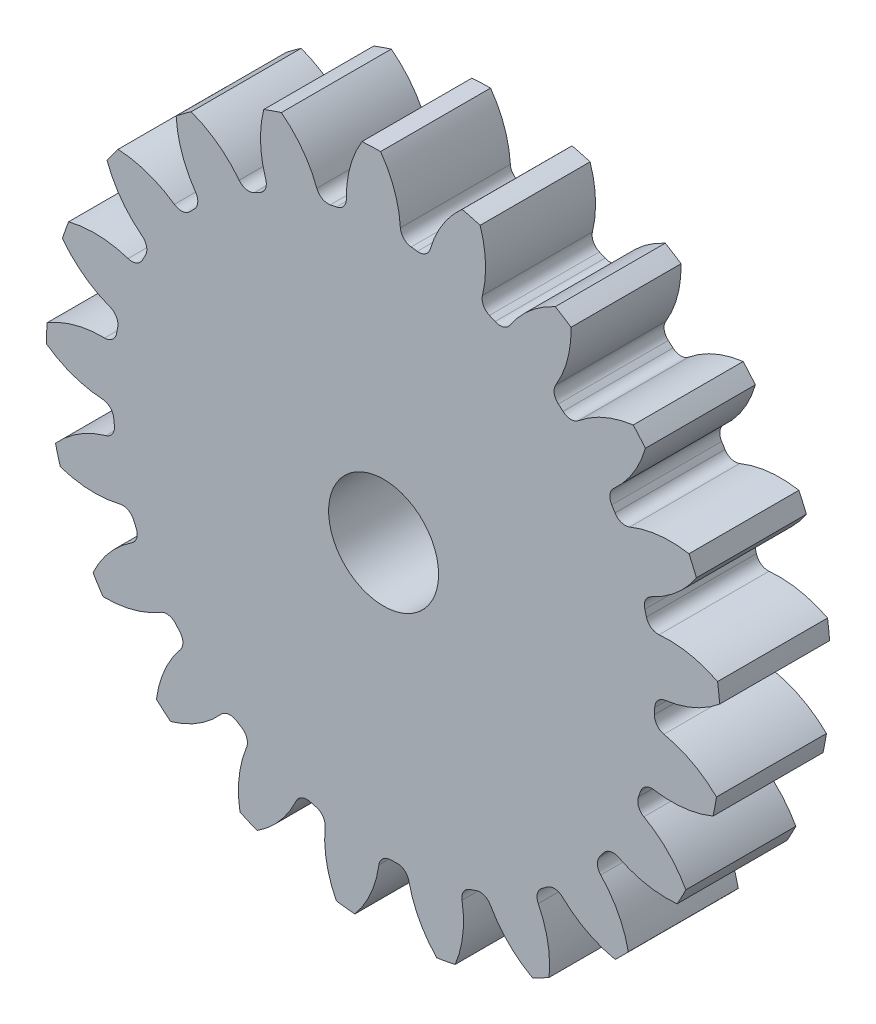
ISO-10303-21;
HEADER;
FILE_DESCRIPTION(('STEP AP214'),'2;1');
FILE_NAME('part.step','',(''),(''),'','','');
FILE_SCHEMA(('AUTOMOTIVE_DESIGN { 1 0 10303 214 1 1 1 1 }'));
ENDSEC;
DATA;
#1=APPLICATION_CONTEXT('core data for automotive mechanical design processes');
#2=APPLICATION_PROTOCOL_DEFINITION('international standard','automotive_design',2000,#1);
#3=PRODUCT_CONTEXT('',#1,'mechanical');
#4=PRODUCT('Part','Part','',(#3));
#5=PRODUCT_RELATED_PRODUCT_CATEGORY('part','',(#4));
#6=PRODUCT_DEFINITION_FORMATION('','',#4);
#7=PRODUCT_DEFINITION_CONTEXT('part definition',#1,'design');
#8=PRODUCT_DEFINITION('design','',#6,#7);
#9=PRODUCT_DEFINITION_SHAPE('','',#8);
#10=(LENGTH_UNIT() NAMED_UNIT(*) SI_UNIT(.MILLI.,.METRE.));
#11=(NAMED_UNIT(*) PLANE_ANGLE_UNIT() SI_UNIT($,.RADIAN.));
#12=(NAMED_UNIT(*) SI_UNIT($,.STERADIAN.) SOLID_ANGLE_UNIT());
#13=UNCERTAINTY_MEASURE_WITH_UNIT(LENGTH_MEASURE(1.E-05),#10,'distance_accuracy_value','');
#14=(GEOMETRIC_REPRESENTATION_CONTEXT(3) GLOBAL_UNCERTAINTY_ASSIGNED_CONTEXT((#13)) GLOBAL_UNIT_ASSIGNED_CONTEXT((#10,
#11,#12)) REPRESENTATION_CONTEXT('',''));
#15=CARTESIAN_POINT('',(0.,0.,0.));
#16=DIRECTION('',(0.,0.,1.));
#17=DIRECTION('',(1.,0.,0.));
#18=AXIS2_PLACEMENT_3D('',#15,#16,#17);
#19=CARTESIAN_POINT('',(0.,0.,127.));
#20=DIRECTION('',(0.,0.,-1.));
#21=DIRECTION('',(-1.,0.,0.));
#22=AXIS2_PLACEMENT_3D('',#19,#20,#21);
#23=CYLINDRICAL_SURFACE('',#22,389.466666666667);
#24=DIRECTION('',(0.,0.,-1.));
#25=VECTOR('',#24,1.);
#26=CARTESIAN_POINT('',(385.710166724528,53.9625029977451,63.5));
#27=LINE('',#26,#25);
#28=CARTESIAN_POINT('',(385.710166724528,53.9625029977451,127.));
#29=VERTEX_POINT('',#28);
#30=CARTESIAN_POINT('',(385.710166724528,53.9625029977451,0.));
#31=VERTEX_POINT('',#30);
#32=EDGE_CURVE('E852',#29,#31,#27,.T.);
#33=ORIENTED_EDGE('',*,*,#32,.F.);
#34=CARTESIAN_POINT('',(0.,0.,127.));
#35=DIRECTION('',(0.,0.,1.));
#36=DIRECTION('',(1.,0.,0.));
#37=AXIS2_PLACEMENT_3D('',#34,#35,#36);
#38=CIRCLE('',#37,389.466666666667);
#39=CARTESIAN_POINT('',(388.104559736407,32.5443567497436,127.));
#40=VERTEX_POINT('',#39);
#41=EDGE_CURVE('E1611',#40,#29,#38,.T.);
#42=ORIENTED_EDGE('',*,*,#41,.F.);
#43=DIRECTION('',(0.,0.,-1.));
#44=VECTOR('',#43,1.);
#45=CARTESIAN_POINT('',(388.104559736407,32.5443567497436,63.5));
#46=LINE('',#45,#44);
#47=CARTESIAN_POINT('',(388.104559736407,32.5443567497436,0.));
#48=VERTEX_POINT('',#47);
#49=EDGE_CURVE('E1605',#48,#40,#46,.F.);
#50=ORIENTED_EDGE('',*,*,#49,.F.);
#51=CARTESIAN_POINT('',(0.,0.,0.));
#52=DIRECTION('',(0.,0.,1.));
#53=DIRECTION('',(1.,0.,0.));
#54=AXIS2_PLACEMENT_3D('',#51,#52,#53);
#55=CIRCLE('',#54,389.466666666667);
#56=EDGE_CURVE('E1616',#48,#31,#55,.T.);
#57=ORIENTED_EDGE('',*,*,#56,.T.);
#58=EDGE_LOOP('',(#33,#42,#50,#57));
#59=FACE_BOUND('',#58,.T.);
#60=ADVANCED_FACE('F33',(#59),#23,.T.);
#61=DIRECTION('',(0.,0.,-1.));
#62=VECTOR('',#61,1.);
#63=CARTESIAN_POINT('',(361.269545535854,145.494329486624,63.5));
#64=LINE('',#63,#62);
#65=CARTESIAN_POINT('',(361.269545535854,145.494329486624,0.));
#66=VERTEX_POINT('',#65);
#67=CARTESIAN_POINT('',(361.269545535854,145.494329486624,127.));
#68=VERTEX_POINT('',#67);
#69=EDGE_CURVE('E823',#66,#68,#64,.F.);
#70=ORIENTED_EDGE('',*,*,#69,.F.);
#71=CARTESIAN_POINT('',(352.668419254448,165.255167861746,0.));
#72=VERTEX_POINT('',#71);
#73=EDGE_CURVE('E1619',#66,#72,#55,.T.);
#74=ORIENTED_EDGE('',*,*,#73,.T.);
#75=DIRECTION('',(0.,0.,-1.));
#76=VECTOR('',#75,1.);
#77=CARTESIAN_POINT('',(352.668419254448,165.255167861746,63.5));
#78=LINE('',#77,#76);
#79=CARTESIAN_POINT('',(352.668419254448,165.255167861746,127.));
#80=VERTEX_POINT('',#79);
#81=EDGE_CURVE('E885',#80,#72,#78,.T.);
#82=ORIENTED_EDGE('',*,*,#81,.F.);
#83=EDGE_CURVE('E1614',#68,#80,#38,.T.);
#84=ORIENTED_EDGE('',*,*,#83,.F.);
#85=EDGE_LOOP('',(#70,#74,#82,#84));
#86=FACE_BOUND('',#85,.T.);
#87=ADVANCED_FACE('F1856',(#86),#23,.T.);
#88=CARTESIAN_POINT('',(0.,0.,127.));
#89=DIRECTION('',(0.,0.,1.));
#90=DIRECTION('',(1.,0.,0.));
#91=AXIS2_PLACEMENT_3D('',#88,#89,#90);
#92=PLANE('',#91);
#93=CARTESIAN_POINT('',(0.,0.,127.000000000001));
#94=DIRECTION('',(0.,0.,1.));
#95=DIRECTION('',(1.,0.,0.));
#96=AXIS2_PLACEMENT_3D('',#93,#94,#95);
#97=CIRCLE('',#96,63.5);
#98=CARTESIAN_POINT('',(63.5,0.,127.000000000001));
#99=VERTEX_POINT('',#98);
#100=EDGE_CURVE('E840',#99,#99,#97,.T.);
#101=ORIENTED_EDGE('',*,*,#100,.F.);
#102=EDGE_LOOP('',(#101));
#103=FACE_BOUND('',#102,.T.);
#104=ORIENTED_EDGE('',*,*,#41,.T.);
#105=CARTESIAN_POINT('',(329.33562243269,-56.545633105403,127.));
#106=DIRECTION('',(0.,0.,-1.));
#107=DIRECTION('',(0.955572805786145,0.294755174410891,0.));
#108=AXIS2_PLACEMENT_3D('',#105,#106,#107);
#109=CIRCLE('',#108,124.056992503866);
#110=CARTESIAN_POINT('',(318.169261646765,67.0077957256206,127.));
#111=VERTEX_POINT('',#110);
#112=EDGE_CURVE('E832',#111,#29,#109,.T.);
#113=ORIENTED_EDGE('',*,*,#112,.F.);
#114=CARTESIAN_POINT('',(316.928588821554,80.7355790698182,127.));
#115=DIRECTION('',(0.,0.,1.));
#116=DIRECTION('',(-0.955572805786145,-0.294755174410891,0.));
#117=AXIS2_PLACEMENT_3D('',#114,#115,#116);
#118=CIRCLE('',#117,13.7837333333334);
#119=CARTESIAN_POINT('',(303.571445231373,77.3329301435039,127.));
#120=VERTEX_POINT('',#119);
#121=EDGE_CURVE('E830',#120,#111,#118,.T.);
#122=ORIENTED_EDGE('',*,*,#121,.F.);
#123=CARTESIAN_POINT('',(0.,0.,127.));
#124=DIRECTION('',(0.,0.,-1.));
#125=DIRECTION('',(0.955572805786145,0.294755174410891,0.));
#126=AXIS2_PLACEMENT_3D('',#123,#124,#125);
#127=CIRCLE('',#126,313.266666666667);
#128=CARTESIAN_POINT('',(301.714042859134,84.2890312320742,127.));
#129=VERTEX_POINT('',#128);
#130=EDGE_CURVE('E815',#129,#120,#127,.T.);
#131=ORIENTED_EDGE('',*,*,#130,.F.);
#132=CARTESIAN_POINT('',(314.989460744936,87.9977486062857,127.));
#133=DIRECTION('',(0.,0.,1.));
#134=DIRECTION('',(-0.955572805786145,-0.294755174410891,0.));
#135=AXIS2_PLACEMENT_3D('',#132,#133,#134);
#136=CIRCLE('',#135,13.7837333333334);
#137=CARTESIAN_POINT('',(309.221779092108,100.516740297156,127.));
#138=VERTEX_POINT('',#137);
#139=EDGE_CURVE('E807',#138,#129,#136,.T.);
#140=ORIENTED_EDGE('',*,*,#139,.F.);
#141=CARTESIAN_POINT('',(257.311224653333,213.190746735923,127.));
#142=DIRECTION('',(0.,0.,-1.));
#143=DIRECTION('',(-0.955572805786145,-0.294755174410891,0.));
#144=AXIS2_PLACEMENT_3D('',#141,#142,#143);
#145=CIRCLE('',#144,124.056992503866);
#146=EDGE_CURVE('E837',#68,#138,#145,.T.);
#147=ORIENTED_EDGE('',*,*,#146,.F.);
#148=ORIENTED_EDGE('',*,*,#83,.T.);
#149=CARTESIAN_POINT('',(331.371282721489,43.0399095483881,127.));
#150=DIRECTION('',(0.,0.,-1.));
#151=DIRECTION('',(0.826238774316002,0.563320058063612,0.));
#152=AXIS2_PLACEMENT_3D('',#149,#150,#151);
#153=CIRCLE('',#152,124.056992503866);
#154=CARTESIAN_POINT('',(284.282999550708,157.812863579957,127.));
#155=VERTEX_POINT('',#154);
#156=EDGE_CURVE('E861',#155,#80,#153,.T.);
#157=ORIENTED_EDGE('',*,*,#156,.F.);
#158=CARTESIAN_POINT('',(279.051111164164,170.565065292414,127.));
#159=DIRECTION('',(0.,0.,1.));
#160=DIRECTION('',(-0.826238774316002,-0.563320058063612,0.));
#161=AXIS2_PLACEMENT_3D('',#158,#159,#160);
#162=CIRCLE('',#161,13.7837333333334);
#163=CARTESIAN_POINT('',(267.290336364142,163.376499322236,127.));
#164=VERTEX_POINT('',#163);
#165=EDGE_CURVE('E859',#164,#155,#162,.T.);
#166=ORIENTED_EDGE('',*,*,#165,.F.);
#167=CARTESIAN_POINT('',(0.,0.,127.));
#168=DIRECTION('',(0.,0.,-1.));
#169=DIRECTION('',(0.826238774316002,0.563320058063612,0.));
#170=AXIS2_PLACEMENT_3D('',#167,#168,#169);
#171=CIRCLE('',#170,313.266666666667);
#172=CARTESIAN_POINT('',(263.465106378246,169.476081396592,127.));
#173=VERTEX_POINT('',#172);
#174=EDGE_CURVE('E856',#173,#164,#171,.T.);
#175=ORIENTED_EDGE('',*,*,#174,.F.);
#176=CARTESIAN_POINT('',(275.057571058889,176.933028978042,127.));
#177=DIRECTION('',(0.,0.,1.));
#178=DIRECTION('',(-0.826238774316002,-0.563320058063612,0.));
#179=AXIS2_PLACEMENT_3D('',#176,#177,#178);
#180=CIRCLE('',#179,13.7837333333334);
#181=CARTESIAN_POINT('',(265.856093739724,187.195782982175,127.));
#182=VERTEX_POINT('',#181);
#183=EDGE_CURVE('E854',#182,#173,#180,.T.);
#184=ORIENTED_EDGE('',*,*,#183,.F.);
#185=CARTESIAN_POINT('',(183.040533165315,279.563094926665,127.));
#186=DIRECTION('',(0.,0.,-1.));
#187=DIRECTION('',(-0.826238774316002,-0.563320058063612,0.));
#188=AXIS2_PLACEMENT_3D('',#185,#186,#187);
#189=CIRCLE('',#188,124.056992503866);
#190=CARTESIAN_POINT('',(302.334146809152,245.516492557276,127.));
#191=VERTEX_POINT('',#190);
#192=EDGE_CURVE('E864',#191,#182,#189,.T.);
#193=ORIENTED_EDGE('',*,*,#192,.F.);
#194=CARTESIAN_POINT('',(288.290535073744,261.864185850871,127.));
#195=VERTEX_POINT('',#194);
#196=EDGE_CURVE('E1669',#191,#195,#38,.T.);
#197=ORIENTED_EDGE('',*,*,#196,.T.);
#198=CARTESIAN_POINT('',(303.963150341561,138.801167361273,127.));
#199=DIRECTION('',(0.,0.,-1.));
#200=DIRECTION('',(0.623489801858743,0.781831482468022,0.));
#201=AXIS2_PLACEMENT_3D('',#198,#199,#200);
#202=CIRCLE('',#201,124.056992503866);
#203=CARTESIAN_POINT('',(225.136945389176,234.595565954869,127.));
#204=VERTEX_POINT('',#203);
#205=EDGE_CURVE('E896',#204,#195,#202,.T.);
#206=ORIENTED_EDGE('',*,*,#205,.F.);
#207=CARTESIAN_POINT('',(216.378717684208,245.239096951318,127.));
#208=DIRECTION('',(0.,0.,1.));
#209=DIRECTION('',(-0.623489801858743,-0.781831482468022,0.));
#210=AXIS2_PLACEMENT_3D('',#207,#208,#209);
#211=CIRCLE('',#210,13.7837333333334);
#212=CARTESIAN_POINT('',(207.259308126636,234.903349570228,127.));
#213=VERTEX_POINT('',#212);
#214=EDGE_CURVE('E894',#213,#204,#211,.T.);
#215=ORIENTED_EDGE('',*,*,#214,.F.);
#216=CARTESIAN_POINT('',(0.,0.,127.));
#217=DIRECTION('',(0.,0.,-1.));
#218=DIRECTION('',(0.623489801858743,0.781831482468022,0.));
#219=AXIS2_PLACEMENT_3D('',#216,#217,#218);
#220=CIRCLE('',#219,313.266666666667);
#221=CARTESIAN_POINT('',(201.806138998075,239.604437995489,127.));
#222=VERTEX_POINT('',#221);
#223=EDGE_CURVE('E891',#222,#213,#220,.T.);
#224=ORIENTED_EDGE('',*,*,#223,.F.);
#225=CARTESIAN_POINT('',(210.68560911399,250.147033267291,127.));
#226=DIRECTION('',(0.,0.,1.));
#227=DIRECTION('',(-0.623489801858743,-0.781831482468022,0.));
#228=AXIS2_PLACEMENT_3D('',#225,#226,#227);
#229=CIRCLE('',#228,13.7837333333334);
#230=CARTESIAN_POINT('',(198.867927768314,257.241658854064,127.));
#231=VERTEX_POINT('',#230);
#232=EDGE_CURVE('E889',#231,#222,#229,.T.);
#233=ORIENTED_EDGE('',*,*,#232,.F.);
#234=CARTESIAN_POINT('',(92.50588704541,321.095035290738,127.));
#235=DIRECTION('',(0.,0.,-1.));
#236=DIRECTION('',(-0.623489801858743,-0.781831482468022,0.));
#237=AXIS2_PLACEMENT_3D('',#234,#235,#236);
#238=CIRCLE('',#237,124.056992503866);
#239=CARTESIAN_POINT('',(216.535032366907,323.723437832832,127.));
#240=VERTEX_POINT('',#239);
#241=EDGE_CURVE('E899',#240,#231,#238,.T.);
#242=ORIENTED_EDGE('',*,*,#241,.F.);
#243=CARTESIAN_POINT('',(198.296771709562,335.205421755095,127.));
#244=VERTEX_POINT('',#243);
#245=EDGE_CURVE('E1838',#240,#244,#38,.T.);
#246=ORIENTED_EDGE('',*,*,#245,.T.);
#247=CARTESIAN_POINT('',(249.546558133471,222.229332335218,127.));
#248=DIRECTION('',(0.,0.,-1.));
#249=DIRECTION('',(0.365341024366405,0.9308737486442,0.));
#250=AXIS2_PLACEMENT_3D('',#247,#248,#249);
#251=CIRCLE('',#250,124.056992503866);
#252=CARTESIAN_POINT('',(145.986485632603,290.533422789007,127.));
#253=VERTEX_POINT('',#252);
#254=EDGE_CURVE('E934',#253,#244,#251,.T.);
#255=ORIENTED_EDGE('',*,*,#254,.F.);
#256=CARTESIAN_POINT('',(134.480125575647,298.122558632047,127.));
#257=DIRECTION('',(0.,0.,1.));
#258=DIRECTION('',(-0.365341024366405,-0.9308737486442,0.));
#259=AXIS2_PLACEMENT_3D('',#256,#257,#258);
#260=CIRCLE('',#259,13.7837333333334);
#261=CARTESIAN_POINT('',(128.812380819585,285.558006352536,127.));
#262=VERTEX_POINT('',#261);
#263=EDGE_CURVE('E932',#262,#253,#260,.T.);
#264=ORIENTED_EDGE('',*,*,#263,.F.);
#265=CARTESIAN_POINT('',(0.,0.,127.));
#266=DIRECTION('',(0.,0.,-1.));
#267=DIRECTION('',(0.365341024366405,0.9308737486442,0.));
#268=AXIS2_PLACEMENT_3D('',#265,#266,#267);
#269=CIRCLE('',#268,313.266666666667);
#270=CARTESIAN_POINT('',(122.215810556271,288.44288879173,127.));
#271=VERTEX_POINT('',#270);
#272=EDGE_CURVE('E929',#271,#262,#269,.T.);
#273=ORIENTED_EDGE('',*,*,#272,.F.);
#274=CARTESIAN_POINT('',(127.593306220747,301.134375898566,127.));
#275=DIRECTION('',(0.,0.,1.));
#276=DIRECTION('',(-0.365341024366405,-0.9308737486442,0.));
#277=AXIS2_PLACEMENT_3D('',#274,#275,#276);
#278=CIRCLE('',#277,13.7837333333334);
#279=CARTESIAN_POINT('',(114.209473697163,304.430484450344,127.));
#280=VERTEX_POINT('',#279);
#281=EDGE_CURVE('E927',#280,#271,#278,.T.);
#282=ORIENTED_EDGE('',*,*,#281,.F.);
#283=CARTESIAN_POINT('',(-6.24831309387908,334.096272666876,127.));
#284=DIRECTION('',(0.,0.,-1.));
#285=DIRECTION('',(-0.365341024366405,-0.9308737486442,0.));
#286=AXIS2_PLACEMENT_3D('',#283,#284,#285);
#287=CIRCLE('',#286,124.056992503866);
#288=CARTESIAN_POINT('',(111.495830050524,373.166135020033,127.));
#289=VERTEX_POINT('',#288);
#290=EDGE_CURVE('E937',#289,#280,#287,.T.);
#291=ORIENTED_EDGE('',*,*,#290,.F.);
#292=CARTESIAN_POINT('',(90.6834699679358,378.762184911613,127.));
#293=VERTEX_POINT('',#292);
#294=EDGE_CURVE('E1834',#289,#293,#38,.T.);
#295=ORIENTED_EDGE('',*,*,#294,.T.);
#296=CARTESIAN_POINT('',(172.956659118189,285.911445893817,127.));
#297=DIRECTION('',(0.,0.,-1.));
#298=DIRECTION('',(0.074730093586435,0.997203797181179,0.));
#299=AXIS2_PLACEMENT_3D('',#296,#297,#298);
#300=CIRCLE('',#299,124.056992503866);
#301=CARTESIAN_POINT('',(53.8644859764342,320.656110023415,127.));
#302=VERTEX_POINT('',#301);
#303=EDGE_CURVE('E972',#302,#293,#300,.T.);
#304=ORIENTED_EDGE('',*,*,#303,.F.);
#305=CARTESIAN_POINT('',(40.6323841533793,324.516522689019,127.));
#306=DIRECTION('',(0.,0.,1.));
#307=DIRECTION('',(-0.074730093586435,-0.997203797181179,0.));
#308=AXIS2_PLACEMENT_3D('',#305,#306,#307);
#309=CIRCLE('',#308,13.7837333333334);
#310=CARTESIAN_POINT('',(38.9199081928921,310.83958111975,127.));
#311=VERTEX_POINT('',#310);
#312=EDGE_CURVE('E970',#311,#302,#309,.T.);
#313=ORIENTED_EDGE('',*,*,#312,.F.);
#314=CARTESIAN_POINT('',(0.,0.,127.));
#315=DIRECTION('',(0.,0.,-1.));
#316=DIRECTION('',(0.074730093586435,0.997203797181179,0.));
#317=AXIS2_PLACEMENT_3D('',#314,#315,#316);
#318=CIRCLE('',#317,313.266666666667);
#319=CARTESIAN_POINT('',(31.7660710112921,311.651923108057,127.));
#320=VERTEX_POINT('',#319);
#321=EDGE_CURVE('E967',#320,#311,#318,.T.);
#322=ORIENTED_EDGE('',*,*,#321,.F.);
#323=CARTESIAN_POINT('',(33.1637781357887,325.364607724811,127.));
#324=DIRECTION('',(0.,0.,1.));
#325=DIRECTION('',(-0.074730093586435,-0.997203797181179,0.));
#326=AXIS2_PLACEMENT_3D('',#323,#324,#325);
#327=CIRCLE('',#326,13.7837333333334);
#328=CARTESIAN_POINT('',(19.4030066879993,324.569325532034,127.));
#329=VERTEX_POINT('',#328);
#330=EDGE_CURVE('E965',#329,#320,#327,.T.);
#331=ORIENTED_EDGE('',*,*,#330,.F.);
#332=CARTESIAN_POINT('',(-104.447323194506,317.411590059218,127.));
#333=DIRECTION('',(0.,0.,-1.));
#334=DIRECTION('',(-0.074730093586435,-0.997203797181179,0.));
#335=AXIS2_PLACEMENT_3D('',#332,#333,#334);
#336=CIRCLE('',#335,124.056992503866);
#337=CARTESIAN_POINT('',(-3.45026605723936,389.451383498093,127.));
#338=VERTEX_POINT('',#337);
#339=EDGE_CURVE('E975',#338,#329,#336,.T.);
#340=ORIENTED_EDGE('',*,*,#339,.F.);
#341=CARTESIAN_POINT('',(-24.9874560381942,388.664265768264,127.));
#342=VERTEX_POINT('',#341);
#343=EDGE_CURVE('E1830',#338,#342,#38,.T.);
#344=ORIENTED_EDGE('',*,*,#343,.T.);
#345=CARTESIAN_POINT('',(80.9988019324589,324.189072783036,127.));
#346=DIRECTION('',(0.,0.,-1.));
#347=DIRECTION('',(-0.222520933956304,0.974927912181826,0.));
#348=AXIS2_PLACEMENT_3D('',#345,#346,#347);
#349=CIRCLE('',#348,124.056992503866);
#350=CARTESIAN_POINT('',(-43.0436096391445,322.287094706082,127.));
#351=VERTEX_POINT('',#350);
#352=EDGE_CURVE('E1010',#351,#342,#349,.T.);
#353=ORIENTED_EDGE('',*,*,#352,.F.);
#354=CARTESIAN_POINT('',(-56.8257229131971,322.075769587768,127.));
#355=DIRECTION('',(0.,0.,1.));
#356=DIRECTION('',(0.222520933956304,-0.974927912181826,0.));
#357=AXIS2_PLACEMENT_3D('',#354,#355,#356);
#358=CIRCLE('',#357,13.7837333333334);
#359=CARTESIAN_POINT('',(-54.4307690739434,308.50169500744,127.));
#360=VERTEX_POINT('',#359);
#361=EDGE_CURVE('E1008',#360,#351,#358,.T.);
#362=ORIENTED_EDGE('',*,*,#361,.F.);
#363=CARTESIAN_POINT('',(0.,0.,127.));
#364=DIRECTION('',(0.,0.,-1.));
#365=DIRECTION('',(-0.222520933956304,0.974927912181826,0.));
#366=AXIS2_PLACEMENT_3D('',#363,#364,#365);
#367=CIRCLE('',#366,313.266666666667);
#368=CARTESIAN_POINT('',(-61.506223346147,307.169316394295,127.));
#369=VERTEX_POINT('',#368);
#370=EDGE_CURVE('E1005',#369,#360,#367,.T.);
#371=ORIENTED_EDGE('',*,*,#370,.F.);
#372=CARTESIAN_POINT('',(-64.2124971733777,320.684766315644,127.));
#373=DIRECTION('',(0.,0.,1.));
#374=DIRECTION('',(0.222520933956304,-0.974927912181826,0.));
#375=AXIS2_PLACEMENT_3D('',#372,#373,#374);
#376=CIRCLE('',#375,13.7837333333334);
#377=CARTESIAN_POINT('',(-77.1275026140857,315.868757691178,127.));
#378=VERTEX_POINT('',#377);
#379=EDGE_CURVE('E1003',#378,#369,#376,.T.);
#380=ORIENTED_EDGE('',*,*,#379,.F.);
#381=CARTESIAN_POINT('',(-193.365730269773,272.523494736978,127.));
#382=DIRECTION('',(0.,0.,-1.));
#383=DIRECTION('',(0.222520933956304,-0.974927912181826,0.));
#384=AXIS2_PLACEMENT_3D('',#381,#382,#383);
#385=CIRCLE('',#384,124.056992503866);
#386=CARTESIAN_POINT('',(-118.089790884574,371.132167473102,127.));
#387=VERTEX_POINT('',#386);
#388=EDGE_CURVE('E1013',#387,#378,#385,.T.);
#389=ORIENTED_EDGE('',*,*,#388,.F.);
#390=CARTESIAN_POINT('',(-138.438136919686,364.031820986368,127.));
#391=VERTEX_POINT('',#390);
#392=EDGE_CURVE('E1826',#387,#391,#38,.T.);
#393=ORIENTED_EDGE('',*,*,#392,.T.);
#394=CARTESIAN_POINT('',(-18.1561542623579,333.661077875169,127.));
#395=DIRECTION('',(0.,0.,-1.));
#396=DIRECTION('',(-0.499999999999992,0.866025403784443,0.));
#397=AXIS2_PLACEMENT_3D('',#394,#395,#396);
#398=CIRCLE('',#397,124.056992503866);
#399=CARTESIAN_POINT('',(-136.127091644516,295.281456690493,127.));
#400=VERTEX_POINT('',#399);
#401=EDGE_CURVE('E1048',#400,#391,#398,.T.);
#402=ORIENTED_EDGE('',*,*,#401,.F.);
#403=CARTESIAN_POINT('',(-149.234615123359,291.017170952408,127.));
#404=DIRECTION('',(0.,0.,1.));
#405=DIRECTION('',(0.499999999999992,-0.866025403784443,0.));
#406=AXIS2_PLACEMENT_3D('',#403,#404,#405);
#407=CIRCLE('',#406,13.7837333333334);
#408=CARTESIAN_POINT('',(-142.945033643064,278.75207945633,127.));
#409=VERTEX_POINT('',#408);
#410=EDGE_CURVE('E1046',#409,#400,#407,.T.);
#411=ORIENTED_EDGE('',*,*,#410,.F.);
#412=CARTESIAN_POINT('',(0.,0.,127.));
#413=DIRECTION('',(0.,0.,-1.));
#414=DIRECTION('',(-0.499999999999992,0.866025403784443,0.));
#415=AXIS2_PLACEMENT_3D('',#412,#413,#414);
#416=CIRCLE('',#415,313.266666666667);
#417=CARTESIAN_POINT('',(-149.313419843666,275.393367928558,127.));
#418=VERTEX_POINT('',#417);
#419=EDGE_CURVE('E1043',#418,#409,#416,.T.);
#420=ORIENTED_EDGE('',*,*,#419,.F.);
#421=CARTESIAN_POINT('',(-155.883210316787,287.510676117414,127.));
#422=DIRECTION('',(0.,0.,1.));
#423=DIRECTION('',(0.499999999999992,-0.866025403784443,0.));
#424=AXIS2_PLACEMENT_3D('',#421,#422,#423);
#425=CIRCLE('',#424,13.7837333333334);
#426=CARTESIAN_POINT('',(-166.804894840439,279.101864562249,127.));
#427=VERTEX_POINT('',#426);
#428=EDGE_CURVE('E1041',#427,#418,#425,.T.);
#429=ORIENTED_EDGE('',*,*,#428,.F.);
#430=CARTESIAN_POINT('',(-265.102743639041,203.420490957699,127.));
#431=DIRECTION('',(0.,0.,-1.));
#432=DIRECTION('',(0.499999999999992,-0.866025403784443,0.));
#433=AXIS2_PLACEMENT_3D('',#430,#431,#432);
#434=CIRCLE('',#433,124.056992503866);
#435=CARTESIAN_POINT('',(-222.236519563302,319.836229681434,127.));
#436=VERTEX_POINT('',#435);
#437=EDGE_CURVE('E1051',#436,#427,#434,.T.);
#438=ORIENTED_EDGE('',*,*,#437,.F.);
#439=CARTESIAN_POINT('',(-239.587981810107,307.053551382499,127.));
#440=VERTEX_POINT('',#439);
#441=EDGE_CURVE('E1822',#436,#440,#38,.T.);
#442=ORIENTED_EDGE('',*,*,#441,.T.);
#443=CARTESIAN_POINT('',(-115.697856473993,313.485831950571,127.));
#444=DIRECTION('',(0.,0.,-1.));
#445=DIRECTION('',(-0.73305187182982,0.680172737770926,0.));
#446=AXIS2_PLACEMENT_3D('',#443,#444,#445);
#447=CIRCLE('',#446,124.056992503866);
#448=CARTESIAN_POINT('',(-217.115084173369,242.038765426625,127.));
#449=VERTEX_POINT('',#448);
#450=EDGE_CURVE('E1086',#449,#440,#447,.T.);
#451=ORIENTED_EDGE('',*,*,#450,.F.);
#452=CARTESIAN_POINT('',(-228.383356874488,234.100419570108,127.));
#453=DIRECTION('',(0.,0.,1.));
#454=DIRECTION('',(0.73305187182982,-0.680172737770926,0.));
#455=AXIS2_PLACEMENT_3D('',#452,#453,#454);
#456=CIRCLE('',#455,13.7837333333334);
#457=CARTESIAN_POINT('',(-218.758004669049,224.234118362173,127.));
#458=VERTEX_POINT('',#457);
#459=EDGE_CURVE('E1084',#458,#449,#456,.T.);
#460=ORIENTED_EDGE('',*,*,#459,.F.);
#461=CARTESIAN_POINT('',(0.,0.,127.));
#462=DIRECTION('',(0.,0.,-1.));
#463=DIRECTION('',(-0.73305187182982,0.680172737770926,0.));
#464=AXIS2_PLACEMENT_3D('',#461,#462,#463);
#465=CIRCLE('',#464,313.266666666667);
#466=CARTESIAN_POINT('',(-223.853463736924,219.147510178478,127.));
#467=VERTEX_POINT('',#466);
#468=EDGE_CURVE('E1081',#467,#458,#465,.T.);
#469=ORIENTED_EDGE('',*,*,#468,.F.);
#470=CARTESIAN_POINT('',(-233.703016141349,228.790000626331,127.));
#471=DIRECTION('',(0.,0.,1.));
#472=DIRECTION('',(0.73305187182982,-0.680172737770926,0.));
#473=AXIS2_PLACEMENT_3D('',#470,#471,#472);
#474=CIRCLE('',#473,13.7837333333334);
#475=CARTESIAN_POINT('',(-241.660940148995,217.535545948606,127.));
#476=VERTEX_POINT('',#475);
#477=EDGE_CURVE('E1079',#476,#467,#474,.T.);
#478=ORIENTED_EDGE('',*,*,#477,.F.);
#479=CARTESIAN_POINT('',(-313.284214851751,116.242683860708,127.));
#480=DIRECTION('',(0.,0.,-1.));
#481=DIRECTION('',(0.73305187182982,-0.680172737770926,0.));
#482=AXIS2_PLACEMENT_3D('',#479,#480,#481);
#483=CIRCLE('',#482,124.056992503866);
#484=CARTESIAN_POINT('',(-306.636558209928,240.121439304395,127.));
#485=VERTEX_POINT('',#484);
#486=EDGE_CURVE('E1089',#485,#476,#483,.T.);
#487=ORIENTED_EDGE('',*,*,#486,.F.);
#488=CARTESIAN_POINT('',(-319.449383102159,222.792226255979,127.));
#489=VERTEX_POINT('',#488);
#490=EDGE_CURVE('E1818',#485,#489,#38,.T.);
#491=ORIENTED_EDGE('',*,*,#490,.T.);
#492=CARTESIAN_POINT('',(-202.959296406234,265.45599414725,127.));
#493=DIRECTION('',(0.,0.,-1.));
#494=DIRECTION('',(-0.900968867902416,0.433883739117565,0.));
#495=AXIS2_PLACEMENT_3D('',#492,#493,#494);
#496=CIRCLE('',#495,124.056992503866);
#497=CARTESIAN_POINT('',(-278.811448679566,167.289867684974,127.));
#498=VERTEX_POINT('',#497);
#499=EDGE_CURVE('E1124',#498,#489,#496,.T.);
#500=ORIENTED_EDGE('',*,*,#499,.F.);
#501=CARTESIAN_POINT('',(-287.239235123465,156.382818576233,127.));
#502=DIRECTION('',(0.,0.,1.));
#503=DIRECTION('',(0.900968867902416,-0.433883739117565,0.));
#504=AXIS2_PLACEMENT_3D('',#501,#502,#503);
#505=CIRCLE('',#504,13.7837333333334);
#506=CARTESIAN_POINT('',(-275.133366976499,149.791971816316,127.));
#507=VERTEX_POINT('',#506);
#508=EDGE_CURVE('E1122',#507,#498,#505,.T.);
#509=ORIENTED_EDGE('',*,*,#508,.F.);
#510=CARTESIAN_POINT('',(0.,0.,127.));
#511=DIRECTION('',(0.,0.,-1.));
#512=DIRECTION('',(-0.900968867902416,0.433883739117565,0.));
#513=AXIS2_PLACEMENT_3D('',#510,#511,#512);
#514=CIRCLE('',#513,313.266666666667);
#515=CARTESIAN_POINT('',(-278.503145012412,143.429434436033,127.));
#516=VERTEX_POINT('',#515);
#517=EDGE_CURVE('E1119',#516,#507,#514,.T.);
#518=ORIENTED_EDGE('',*,*,#517,.F.);
#519=CARTESIAN_POINT('',(-290.757283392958,149.740329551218,127.));
#520=DIRECTION('',(0.,0.,1.));
#521=DIRECTION('',(0.900968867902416,-0.433883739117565,0.));
#522=AXIS2_PLACEMENT_3D('',#519,#520,#521);
#523=CIRCLE('',#522,13.7837333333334);
#524=CARTESIAN_POINT('',(-295.044350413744,136.640239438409,127.));
#525=VERTEX_POINT('',#524);
#526=EDGE_CURVE('E1117',#525,#516,#523,.T.);
#527=ORIENTED_EDGE('',*,*,#526,.F.);
#528=CARTESIAN_POINT('',(-333.62900874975,18.7362041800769,127.));
#529=DIRECTION('',(0.,0.,-1.));
#530=DIRECTION('',(0.900968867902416,-0.433883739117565,0.));
#531=AXIS2_PLACEMENT_3D('',#528,#529,#530);
#532=CIRCLE('',#531,124.056992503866);
#533=CARTESIAN_POINT('',(-363.790593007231,139.07080528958,127.));
#534=VERTEX_POINT('',#533);
#535=EDGE_CURVE('E1127',#534,#525,#532,.T.);
#536=ORIENTED_EDGE('',*,*,#535,.F.);
#537=CARTESIAN_POINT('',(-370.926304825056,118.734834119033,127.));
#538=VERTEX_POINT('',#537);
#539=EDGE_CURVE('E1814',#534,#538,#38,.T.);
#540=ORIENTED_EDGE('',*,*,#539,.T.);
#541=CARTESIAN_POINT('',(-272.186912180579,193.839226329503,127.));
#542=DIRECTION('',(0.,0.,-1.));
#543=DIRECTION('',(-0.988830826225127,0.149042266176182,0.));
#544=AXIS2_PLACEMENT_3D('',#541,#542,#543);
#545=CIRCLE('',#544,124.056992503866);
#546=CARTESIAN_POINT('',(-315.734192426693,77.6765310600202,127.));
#547=VERTEX_POINT('',#546);
#548=EDGE_CURVE('E1162',#547,#538,#545,.T.);
#549=ORIENTED_EDGE('',*,*,#548,.F.);
#550=CARTESIAN_POINT('',(-320.572646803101,64.7699178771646,127.));
#551=DIRECTION('',(0.,0.,1.));
#552=DIRECTION('',(0.988830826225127,-0.149042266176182,0.));
#553=AXIS2_PLACEMENT_3D('',#550,#551,#552);
#554=CIRCLE('',#553,13.7837333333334);
#555=CARTESIAN_POINT('',(-307.061922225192,62.0401512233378,127.));
#556=VERTEX_POINT('',#555);
#557=EDGE_CURVE('E1160',#556,#547,#554,.T.);
#558=ORIENTED_EDGE('',*,*,#557,.F.);
#559=CARTESIAN_POINT('',(0.,0.,127.));
#560=DIRECTION('',(0.,0.,-1.));
#561=DIRECTION('',(-0.988830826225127,0.149042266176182,0.));
#562=AXIS2_PLACEMENT_3D('',#559,#560,#561);
#563=CIRCLE('',#562,313.266666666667);
#564=CARTESIAN_POINT('',(-308.406599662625,54.9670240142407,127.));
#565=VERTEX_POINT('',#564);
#566=EDGE_CURVE('E1157',#565,#556,#563,.T.);
#567=ORIENTED_EDGE('',*,*,#566,.F.);
#568=CARTESIAN_POINT('',(-321.97649004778,57.3855730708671,127.));
#569=DIRECTION('',(0.,0.,1.));
#570=DIRECTION('',(0.988830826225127,-0.149042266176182,0.));
#571=AXIS2_PLACEMENT_3D('',#568,#569,#570);
#572=CIRCLE('',#571,13.7837333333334);
#573=CARTESIAN_POINT('',(-322.211775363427,43.6038480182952,127.));
#574=VERTEX_POINT('',#573);
#575=EDGE_CURVE('E1155',#574,#565,#572,.T.);
#576=ORIENTED_EDGE('',*,*,#575,.F.);
#577=CARTESIAN_POINT('',(-324.329401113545,-80.4350694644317,127.));
#578=DIRECTION('',(0.,0.,-1.));
#579=DIRECTION('',(0.988830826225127,-0.149042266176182,0.));
#580=AXIS2_PLACEMENT_3D('',#577,#578,#579);
#581=CIRCLE('',#580,124.056992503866);
#582=CARTESIAN_POINT('',(-388.620237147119,25.6631199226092,127.));
#583=VERTEX_POINT('',#582);
#584=EDGE_CURVE('E1165',#583,#574,#581,.T.);
#585=ORIENTED_EDGE('',*,*,#584,.F.);
#586=CARTESIAN_POINT('',(-389.44479658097,4.12733091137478,127.));
#587=VERTEX_POINT('',#586);
#588=EDGE_CURVE('E1810',#583,#587,#38,.T.);
#589=ORIENTED_EDGE('',*,*,#588,.T.);
#590=CARTESIAN_POINT('',(-317.229526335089,104.998992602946,127.));
#591=DIRECTION('',(0.,0.,-1.));
#592=DIRECTION('',(-0.98883082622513,-0.149042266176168,0.));
#593=AXIS2_PLACEMENT_3D('',#590,#591,#592);
#594=CIRCLE('',#593,124.056992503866);
#595=CARTESIAN_POINT('',(-324.602567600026,-18.8387062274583,127.));
#596=VERTEX_POINT('',#595);
#597=EDGE_CURVE('E1200',#596,#587,#594,.T.);
#598=ORIENTED_EDGE('',*,*,#597,.F.);
#599=CARTESIAN_POINT('',(-325.421772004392,-32.5980742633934,127.));
#600=DIRECTION('',(0.,0.,1.));
#601=DIRECTION('',(0.98883082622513,0.149042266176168,0.));
#602=AXIS2_PLACEMENT_3D('',#599,#600,#601);
#603=CIRCLE('',#602,13.7837333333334);
#604=CARTESIAN_POINT('',(-311.706678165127,-31.2242090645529,127.));
#605=VERTEX_POINT('',#604);
#606=EDGE_CURVE('E1198',#605,#596,#603,.T.);
#607=ORIENTED_EDGE('',*,*,#606,.F.);
#608=CARTESIAN_POINT('',(0.,0.,127.));
#609=DIRECTION('',(0.,0.,-1.));
#610=DIRECTION('',(-0.98883082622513,-0.149042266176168,0.));
#611=AXIS2_PLACEMENT_3D('',#608,#609,#610);
#612=CIRCLE('',#611,313.266666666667);
#613=CARTESIAN_POINT('',(-310.906774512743,-38.379447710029,127.));
#614=VERTEX_POINT('',#613);
#615=EDGE_CURVE('E1195',#614,#605,#612,.T.);
#616=ORIENTED_EDGE('',*,*,#615,.F.);
#617=CARTESIAN_POINT('',(-324.586672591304,-40.0681434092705,127.));
#618=DIRECTION('',(0.,0.,1.));
#619=DIRECTION('',(0.98883082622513,0.149042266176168,0.));
#620=AXIS2_PLACEMENT_3D('',#617,#618,#619);
#621=CIRCLE('',#620,13.7837333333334);
#622=CARTESIAN_POINT('',(-320.749270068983,-53.3069366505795,127.));
#623=VERTEX_POINT('',#622);
#624=EDGE_CURVE('E1193',#623,#614,#621,.T.);
#625=ORIENTED_EDGE('',*,*,#624,.F.);
#626=CARTESIAN_POINT('',(-286.211702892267,-172.459334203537,127.));
#627=DIRECTION('',(0.,0.,-1.));
#628=DIRECTION('',(0.98883082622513,0.149042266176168,0.));
#629=AXIS2_PLACEMENT_3D('',#626,#627,#628);
#630=CIRCLE('',#629,124.056992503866);
#631=CARTESIAN_POINT('',(-378.919267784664,-90.0248462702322,127.));
#632=VERTEX_POINT('',#631);
#633=EDGE_CURVE('E1203',#632,#623,#630,.T.);
#634=ORIENTED_EDGE('',*,*,#633,.F.);
#635=CARTESIAN_POINT('',(-373.359409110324,-110.846903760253,127.));
#636=VERTEX_POINT('',#635);
#637=EDGE_CURVE('E1806',#632,#636,#38,.T.);
#638=ORIENTED_EDGE('',*,*,#637,.T.);
#639=CARTESIAN_POINT('',(-334.08490493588,6.82913760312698,127.));
#640=DIRECTION('',(0.,0.,-1.));
#641=DIRECTION('',(-0.900968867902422,-0.433883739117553,0.));
#642=AXIS2_PLACEMENT_3D('',#639,#640,#641);
#643=CIRCLE('',#642,124.056992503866);
#644=CARTESIAN_POINT('',(-304.628580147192,-113.680041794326,127.));
#645=VERTEX_POINT('',#644);
#646=EDGE_CURVE('E1238',#645,#636,#643,.T.);
#647=ORIENTED_EDGE('',*,*,#646,.F.);
#648=CARTESIAN_POINT('',(-301.355744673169,-127.069584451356,127.));
#649=DIRECTION('',(0.,0.,1.));
#650=DIRECTION('',(0.900968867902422,0.433883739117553,0.));
#651=AXIS2_PLACEMENT_3D('',#648,#649,#650);
#652=CIRCLE('',#651,13.7837333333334);
#653=CARTESIAN_POINT('',(-288.654927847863,-121.714161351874,127.));
#654=VERTEX_POINT('',#653);
#655=EDGE_CURVE('E1236',#654,#645,#652,.T.);
#656=ORIENTED_EDGE('',*,*,#655,.F.);
#657=CARTESIAN_POINT('',(0.,0.,127.));
#658=DIRECTION('',(0.,0.,-1.));
#659=DIRECTION('',(-0.900968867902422,-0.433883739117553,0.));
#660=AXIS2_PLACEMENT_3D('',#657,#658,#659);
#661=CIRCLE('',#660,313.266666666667);
#662=CARTESIAN_POINT('',(-285.781518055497,-128.31573707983,127.));
#663=VERTEX_POINT('',#662);
#664=EDGE_CURVE('E1233',#663,#654,#661,.T.);
#665=ORIENTED_EDGE('',*,*,#664,.F.);
#666=CARTESIAN_POINT('',(-298.355904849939,-133.961629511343,127.));
#667=DIRECTION('',(0.,0.,1.));
#668=DIRECTION('',(0.900968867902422,0.433883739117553,0.));
#669=AXIS2_PLACEMENT_3D('',#666,#667,#668);
#670=CIRCLE('',#669,13.7837333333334);
#671=CARTESIAN_POINT('',(-290.786784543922,-145.481166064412,127.));
#672=VERTEX_POINT('',#671);
#673=EDGE_CURVE('E1231',#672,#663,#670,.T.);
#674=ORIENTED_EDGE('',*,*,#673,.F.);
#675=CARTESIAN_POINT('',(-222.66283884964,-249.159830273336,127.));
#676=DIRECTION('',(0.,0.,-1.));
#677=DIRECTION('',(0.900968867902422,0.433883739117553,0.));
#678=AXIS2_PLACEMENT_3D('',#675,#676,#677);
#679=CIRCLE('',#678,124.056992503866);
#680=CARTESIAN_POINT('',(-335.549658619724,-197.713709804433,127.));
#681=VERTEX_POINT('',#680);
#682=EDGE_CURVE('E1241',#681,#672,#679,.T.);
#683=ORIENTED_EDGE('',*,*,#682,.F.);
#684=CARTESIAN_POINT('',(-324.099399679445,-215.971904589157,127.));
#685=VERTEX_POINT('',#684);
#686=EDGE_CURVE('E1802',#681,#685,#38,.T.);
#687=ORIENTED_EDGE('',*,*,#686,.T.);
#688=CARTESIAN_POINT('',(-321.255373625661,-91.9475162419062,127.));
#689=DIRECTION('',(0.,0.,-1.));
#690=DIRECTION('',(-0.73305187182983,-0.680172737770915,0.));
#691=AXIS2_PLACEMENT_3D('',#688,#689,#690);
#692=CIRCLE('',#691,124.056992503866);
#693=CARTESIAN_POINT('',(-257.587006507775,-198.420406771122,127.));
#694=VERTEX_POINT('',#693);
#695=EDGE_CURVE('E1276',#694,#685,#692,.T.);
#696=ORIENTED_EDGE('',*,*,#695,.F.);
#697=CARTESIAN_POINT('',(-250.512936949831,-210.250404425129,127.));
#698=DIRECTION('',(0.,0.,1.));
#699=DIRECTION('',(0.73305187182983,0.680172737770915,0.));
#700=AXIS2_PLACEMENT_3D('',#697,#698,#699);
#701=CIRCLE('',#700,13.7837333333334);
#702=CARTESIAN_POINT('',(-239.95492045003,-201.389276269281,127.));
#703=VERTEX_POINT('',#702);
#704=EDGE_CURVE('E1274',#703,#694,#701,.T.);
#705=ORIENTED_EDGE('',*,*,#704,.F.);
#706=CARTESIAN_POINT('',(0.,0.,127.));
#707=DIRECTION('',(0.,0.,-1.));
#708=DIRECTION('',(-0.73305187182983,-0.680172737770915,0.));
#709=AXIS2_PLACEMENT_3D('',#706,#707,#708);
#710=CIRCLE('',#709,313.266666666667);
#711=CARTESIAN_POINT('',(-235.263319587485,-206.850610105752,127.));
#712=VERTEX_POINT('',#711);
#713=EDGE_CURVE('E1271',#712,#703,#710,.T.);
#714=ORIENTED_EDGE('',*,*,#713,.F.);
#715=CARTESIAN_POINT('',(-245.614905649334,-215.952036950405,127.));
#716=DIRECTION('',(0.,0.,1.));
#717=DIRECTION('',(0.73305187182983,0.680172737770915,0.));
#718=AXIS2_PLACEMENT_3D('',#715,#716,#717);
#719=CIRCLE('',#718,13.7837333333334);
#720=CARTESIAN_POINT('',(-234.986617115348,-224.728755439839,127.));
#721=VERTEX_POINT('',#720);
#722=EDGE_CURVE('E1269',#721,#712,#719,.T.);
#723=ORIENTED_EDGE('',*,*,#722,.F.);
#724=CARTESIAN_POINT('',(-139.329404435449,-303.721382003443,127.));
#725=DIRECTION('',(0.,0.,-1.));
#726=DIRECTION('',(0.73305187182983,0.680172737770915,0.));
#727=AXIS2_PLACEMENT_3D('',#724,#725,#726);
#728=CIRCLE('',#727,124.056992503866);
#729=CARTESIAN_POINT('',(-262.364989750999,-287.834842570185,127.));
#730=VERTEX_POINT('',#729);
#731=EDGE_CURVE('E1279',#730,#721,#728,.T.);
#732=ORIENTED_EDGE('',*,*,#731,.F.);
#733=CARTESIAN_POINT('',(-246.041736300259,-301.906853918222,127.));
#734=VERTEX_POINT('',#733);
#735=EDGE_CURVE('E1798',#730,#734,#38,.T.);
#736=ORIENTED_EDGE('',*,*,#735,.T.);
#737=CARTESIAN_POINT('',(-279.880892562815,-182.554229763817,127.));
#738=DIRECTION('',(0.,0.,-1.));
#739=DIRECTION('',(-0.500000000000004,-0.866025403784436,0.));
#740=AXIS2_PLACEMENT_3D('',#737,#738,#739);
#741=CIRCLE('',#740,124.056992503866);
#742=CARTESIAN_POINT('',(-187.657696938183,-265.530247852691,127.));
#743=VERTEX_POINT('',#742);
#744=EDGE_CURVE('E1314',#743,#734,#741,.T.);
#745=ORIENTED_EDGE('',*,*,#744,.F.);
#746=CARTESIAN_POINT('',(-177.410955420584,-274.749553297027,127.));
#747=DIRECTION('',(0.,0.,1.));
#748=DIRECTION('',(0.500000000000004,0.866025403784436,0.));
#749=AXIS2_PLACEMENT_3D('',#746,#747,#748);
#750=CIRCLE('',#749,13.7837333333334);
#751=CARTESIAN_POINT('',(-169.933865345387,-263.17007020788,127.));
#752=VERTEX_POINT('',#751);
#753=EDGE_CURVE('E1312',#752,#743,#750,.T.);
#754=ORIENTED_EDGE('',*,*,#753,.F.);
#755=CARTESIAN_POINT('',(0.,0.,127.));
#756=DIRECTION('',(0.,0.,-1.));
#757=DIRECTION('',(-0.500000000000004,-0.866025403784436,0.));
#758=AXIS2_PLACEMENT_3D('',#755,#756,#757);
#759=CIRCLE('',#758,313.266666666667);
#760=CARTESIAN_POINT('',(-163.840942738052,-267.005898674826,127.));
#761=VERTEX_POINT('',#760);
#762=EDGE_CURVE('E1309',#761,#752,#759,.T.);
#763=ORIENTED_EDGE('',*,*,#762,.F.);
#764=CARTESIAN_POINT('',(-171.049944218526,-278.754158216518,127.));
#765=DIRECTION('',(0.,0.,1.));
#766=DIRECTION('',(0.500000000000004,0.866025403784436,0.));
#767=AXIS2_PLACEMENT_3D('',#764,#765,#766);
#768=CIRCLE('',#767,13.7837333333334);
#769=CARTESIAN_POINT('',(-158.306857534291,-284.008208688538,127.));
#770=VERTEX_POINT('',#769);
#771=EDGE_CURVE('E1307',#770,#761,#768,.T.);
#772=ORIENTED_EDGE('',*,*,#771,.F.);
#773=CARTESIAN_POINT('',(-43.6159410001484,-331.295956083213,127.));
#774=DIRECTION('',(0.,0.,-1.));
#775=DIRECTION('',(0.500000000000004,0.866025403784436,0.));
#776=AXIS2_PLACEMENT_3D('',#773,#774,#775);
#777=CIRCLE('',#776,124.056992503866);
#778=CARTESIAN_POINT('',(-165.868040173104,-352.380586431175,127.));
#779=VERTEX_POINT('',#778);
#780=EDGE_CURVE('E1317',#779,#770,#777,.T.);
#781=ORIENTED_EDGE('',*,*,#780,.F.);
#782=CARTESIAN_POINT('',(-146.122184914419,-361.016054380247,127.));
#783=VERTEX_POINT('',#782);
#784=EDGE_CURVE('E1794',#779,#783,#38,.T.);
#785=ORIENTED_EDGE('',*,*,#784,.T.);
#786=CARTESIAN_POINT('',(-213.637765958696,-256.940198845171,127.));
#787=DIRECTION('',(0.,0.,-1.));
#788=DIRECTION('',(-0.222520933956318,-0.974927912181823,0.));
#789=AXIS2_PLACEMENT_3D('',#786,#787,#788);
#790=CIRCLE('',#789,124.056992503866);
#791=CARTESIAN_POINT('',(-101.054177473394,-309.046561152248,127.));
#792=VERTEX_POINT('',#791);
#793=EDGE_CURVE('E1352',#792,#783,#790,.T.);
#794=ORIENTED_EDGE('',*,*,#793,.F.);
#795=CARTESIAN_POINT('',(-88.545231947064,-314.835998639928,127.));
#796=DIRECTION('',(0.,0.,1.));
#797=DIRECTION('',(0.222520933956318,0.974927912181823,0.));
#798=AXIS2_PLACEMENT_3D('',#795,#796,#797);
#799=CIRCLE('',#798,13.7837333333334);
#800=CARTESIAN_POINT('',(-84.8134405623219,-301.567048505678,127.));
#801=VERTEX_POINT('',#800);
#802=EDGE_CURVE('E1350',#801,#792,#799,.T.);
#803=ORIENTED_EDGE('',*,*,#802,.F.);
#804=CARTESIAN_POINT('',(0.,0.,127.));
#805=DIRECTION('',(0.,0.,-1.));
#806=DIRECTION('',(-0.222520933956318,-0.974927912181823,0.));
#807=AXIS2_PLACEMENT_3D('',#804,#805,#806);
#808=CIRCLE('',#807,313.266666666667);
#809=CARTESIAN_POINT('',(-77.8605791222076,-303.436541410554,127.));
#810=VERTEX_POINT('',#809);
#811=EDGE_CURVE('E1347',#810,#801,#808,.T.);
#812=ORIENTED_EDGE('',*,*,#811,.F.);
#813=CARTESIAN_POINT('',(-81.2864446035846,-316.787749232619,127.));
#814=DIRECTION('',(0.,0.,1.));
#815=DIRECTION('',(0.222520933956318,0.974927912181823,0.));
#816=AXIS2_PLACEMENT_3D('',#813,#814,#815);
#817=CIRCLE('',#816,13.7837333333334);
#818=CARTESIAN_POINT('',(-67.5608389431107,-318.052286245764,127.));
#819=VERTEX_POINT('',#818);
#820=EDGE_CURVE('E1345',#819,#810,#817,.T.);
#821=ORIENTED_EDGE('',*,*,#820,.F.);
#822=CARTESIAN_POINT('',(55.9729901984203,-329.433430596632,127.));
#823=DIRECTION('',(0.,0.,-1.));
#824=DIRECTION('',(0.222520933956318,0.974927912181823,0.));
#825=AXIS2_PLACEMENT_3D('',#822,#823,#824);
#826=CIRCLE('',#825,124.056992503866);
#827=CARTESIAN_POINT('',(-54.632987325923,-385.615768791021,127.));
#828=VERTEX_POINT('',#827);
#829=EDGE_CURVE('E1355',#828,#819,#826,.T.);
#830=ORIENTED_EDGE('',*,*,#829,.F.);
#831=CARTESIAN_POINT('',(-33.2190361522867,-388.047394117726,127.));
#832=VERTEX_POINT('',#831);
#833=EDGE_CURVE('E1790',#828,#832,#38,.T.);
#834=ORIENTED_EDGE('',*,*,#833,.T.);
#835=CARTESIAN_POINT('',(-128.411986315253,-308.49590369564,127.));
#836=DIRECTION('',(0.,0.,-1.));
#837=DIRECTION('',(0.0747300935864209,-0.997203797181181,0.));
#838=AXIS2_PLACEMENT_3D('',#835,#836,#837);
#839=CIRCLE('',#838,124.056992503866);
#840=CARTESIAN_POINT('',(-5.47155087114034,-325.102731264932,127.));
#841=VERTEX_POINT('',#840);
#842=EDGE_CURVE('E1390',#841,#832,#839,.T.);
#843=ORIENTED_EDGE('',*,*,#842,.F.);
#844=CARTESIAN_POINT('',(8.18812395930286,-326.947883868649,127.));
#845=DIRECTION('',(0.,0.,1.));
#846=DIRECTION('',(-0.0747300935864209,0.997203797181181,0.));
#847=AXIS2_PLACEMENT_3D('',#844,#845,#846);
#848=CIRCLE('',#847,13.7837333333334);
#849=CARTESIAN_POINT('',(7.84303061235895,-313.168471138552,127.));
#850=VERTEX_POINT('',#849);
#851=EDGE_CURVE('E1388',#850,#841,#848,.T.);
#852=ORIENTED_EDGE('',*,*,#851,.F.);
#853=CARTESIAN_POINT('',(0.,0.,127.));
#854=DIRECTION('',(0.,0.,-1.));
#855=DIRECTION('',(0.0747300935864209,-0.997203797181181,0.));
#856=AXIS2_PLACEMENT_3D('',#853,#854,#855);
#857=CIRCLE('',#856,313.266666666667);
#858=CARTESIAN_POINT('',(15.0380386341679,-312.905515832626,127.));
#859=VERTEX_POINT('',#858);
#860=EDGE_CURVE('E1385',#859,#850,#857,.T.);
#861=ORIENTED_EDGE('',*,*,#860,.F.);
#862=CARTESIAN_POINT('',(15.6997123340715,-326.673358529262,127.));
#863=DIRECTION('',(0.,0.,1.));
#864=DIRECTION('',(-0.0747300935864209,0.997203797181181,0.));
#865=AXIS2_PLACEMENT_3D('',#862,#863,#864);
#866=CIRCLE('',#865,13.7837333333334);
#867=CARTESIAN_POINT('',(29.1882566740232,-323.836022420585,127.));
#868=VERTEX_POINT('',#867);
#869=EDGE_CURVE('E1383',#868,#859,#866,.T.);
#870=ORIENTED_EDGE('',*,*,#869,.F.);
#871=CARTESIAN_POINT('',(150.588475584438,-298.299299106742,127.));
#872=DIRECTION('',(0.,0.,-1.));
#873=DIRECTION('',(-0.0747300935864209,0.997203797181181,0.));
#874=AXIS2_PLACEMENT_3D('',#871,#872,#873);
#875=CIRCLE('',#874,124.056992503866);
#876=CARTESIAN_POINT('',(61.4564461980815,-384.587297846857,127.));
#877=VERTEX_POINT('',#876);
#878=EDGE_CURVE('E1393',#877,#868,#875,.T.);
#879=ORIENTED_EDGE('',*,*,#878,.F.);
#880=CARTESIAN_POINT('',(82.6357697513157,-380.599019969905,127.));
#881=VERTEX_POINT('',#880);
#882=EDGE_CURVE('E1786',#877,#881,#38,.T.);
#883=ORIENTED_EDGE('',*,*,#882,.T.);
#884=CARTESIAN_POINT('',(-31.7762381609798,-332.640393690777,127.));
#885=DIRECTION('',(0.,0.,-1.));
#886=DIRECTION('',(0.365341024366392,-0.930873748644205,0.));
#887=AXIS2_PLACEMENT_3D('',#884,#885,#886);
#888=CIRCLE('',#887,124.056992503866);
#889=CARTESIAN_POINT('',(90.5972470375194,-312.27209701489,127.));
#890=VERTEX_POINT('',#889);
#891=EDGE_CURVE('E1428',#890,#881,#888,.T.);
#892=ORIENTED_EDGE('',*,*,#891,.F.);
#893=CARTESIAN_POINT('',(104.193929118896,-310.009014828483,127.));
#894=DIRECTION('',(0.,0.,1.));
#895=DIRECTION('',(-0.365341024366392,0.930873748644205,0.));
#896=AXIS2_PLACEMENT_3D('',#893,#894,#895);
#897=CIRCLE('',#896,13.7837333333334);
#898=CARTESIAN_POINT('',(99.8026140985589,-296.943500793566,127.));
#899=VERTEX_POINT('',#898);
#900=EDGE_CURVE('E1426',#899,#890,#897,.T.);
#901=ORIENTED_EDGE('',*,*,#900,.F.);
#902=CARTESIAN_POINT('',(0.,0.,127.));
#903=DIRECTION('',(0.,0.,-1.));
#904=DIRECTION('',(0.365341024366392,-0.930873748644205,0.));
#905=AXIS2_PLACEMENT_3D('',#902,#903,#904);
#906=CIRCLE('',#905,313.266666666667);
#907=CARTESIAN_POINT('',(106.600460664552,-294.57146200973,127.));
#908=VERTEX_POINT('',#907);
#909=EDGE_CURVE('E1423',#908,#899,#906,.T.);
#910=ORIENTED_EDGE('',*,*,#909,.F.);
#911=CARTESIAN_POINT('',(111.290880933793,-307.532606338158,127.));
#912=DIRECTION('',(0.,0.,1.));
#913=DIRECTION('',(-0.365341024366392,0.930873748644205,0.));
#914=AXIS2_PLACEMENT_3D('',#911,#912,#913);
#915=CIRCLE('',#914,13.7837333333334);
#916=CARTESIAN_POINT('',(123.343847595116,-300.84550687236,127.));
#917=VERTEX_POINT('',#916);
#918=EDGE_CURVE('E1421',#917,#908,#915,.T.);
#919=ORIENTED_EDGE('',*,*,#918,.F.);
#920=CARTESIAN_POINT('',(231.823514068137,-240.659965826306,127.));
#921=DIRECTION('',(0.,0.,-1.));
#922=DIRECTION('',(-0.365341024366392,0.930873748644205,0.));
#923=AXIS2_PLACEMENT_3D('',#920,#921,#922);
#924=CIRCLE('',#923,124.056992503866);
#925=CARTESIAN_POINT('',(172.085204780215,-349.386557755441,127.));
#926=VERTEX_POINT('',#925);
#927=EDGE_CURVE('E1431',#926,#917,#924,.T.);
#928=ORIENTED_EDGE('',*,*,#927,.F.);
#929=CARTESIAN_POINT('',(191.148024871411,-339.332752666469,127.));
#930=VERTEX_POINT('',#929);
#931=EDGE_CURVE('E1782',#926,#930,#38,.T.);
#932=ORIENTED_EDGE('',*,*,#931,.T.);
#933=CARTESIAN_POINT('',(67.682968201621,-327.228324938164,127.));
#934=DIRECTION('',(0.,0.,-1.));
#935=DIRECTION('',(0.623489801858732,-0.781831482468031,0.));
#936=AXIS2_PLACEMENT_3D('',#933,#934,#935);
#937=CIRCLE('',#936,124.056992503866);
#938=CARTESIAN_POINT('',(178.616081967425,-271.694716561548,127.));
#939=VERTEX_POINT('',#938);
#940=EDGE_CURVE('E1466',#939,#930,#937,.T.);
#941=ORIENTED_EDGE('',*,*,#940,.F.);
#942=CARTESIAN_POINT('',(190.941646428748,-265.524484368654,127.));
#943=DIRECTION('',(0.,0.,1.));
#944=DIRECTION('',(-0.623489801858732,0.781831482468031,0.));
#945=AXIS2_PLACEMENT_3D('',#942,#943,#944);
#946=CIRCLE('',#945,13.7837333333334);
#947=CARTESIAN_POINT('',(182.894297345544,-254.333797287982,127.));
#948=VERTEX_POINT('',#947);
#949=EDGE_CURVE('E1464',#948,#939,#946,.T.);
#950=ORIENTED_EDGE('',*,*,#949,.F.);
#951=CARTESIAN_POINT('',(0.,0.,127.));
#952=DIRECTION('',(0.,0.,-1.));
#953=DIRECTION('',(0.623489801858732,-0.781831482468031,0.));
#954=AXIS2_PLACEMENT_3D('',#951,#952,#953);
#955=CIRCLE('',#954,313.266666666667);
#956=CARTESIAN_POINT('',(188.690963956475,-250.063441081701,127.));
#957=VERTEX_POINT('',#956);
#958=EDGE_CURVE('E1461',#957,#948,#955,.T.);
#959=ORIENTED_EDGE('',*,*,#958,.F.);
#960=CARTESIAN_POINT('',(196.99336637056,-261.066232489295,127.));
#961=DIRECTION('',(0.,0.,1.));
#962=DIRECTION('',(-0.623489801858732,0.781831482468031,0.));
#963=AXIS2_PLACEMENT_3D('',#960,#961,#962);
#964=CIRCLE('',#963,13.7837333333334);
#965=CARTESIAN_POINT('',(206.539796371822,-251.123547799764,127.));
#966=VERTEX_POINT('',#965);
#967=EDGE_CURVE('E1459',#966,#957,#964,.T.);
#968=ORIENTED_EDGE('',*,*,#967,.F.);
#969=CARTESIAN_POINT('',(292.460015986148,-161.636938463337,127.));
#970=DIRECTION('',(0.,0.,-1.));
#971=DIRECTION('',(-0.623489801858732,0.781831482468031,0.));
#972=AXIS2_PLACEMENT_3D('',#969,#970,#971);
#973=CIRCLE('',#972,124.056992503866);
#974=CARTESIAN_POINT('',(267.423437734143,-283.1412887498,127.));
#975=VERTEX_POINT('',#974);
#976=EDGE_CURVE('E1469',#975,#966,#973,.T.);
#977=ORIENTED_EDGE('',*,*,#976,.F.);
#978=CARTESIAN_POINT('',(282.675939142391,-267.91528115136,127.));
#979=VERTEX_POINT('',#978);
#980=EDGE_CURVE('E1778',#975,#979,#38,.T.);
#981=ORIENTED_EDGE('',*,*,#980,.T.);
#982=CARTESIAN_POINT('',(161.128245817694,-292.740583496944,127.));
#983=DIRECTION('',(0.,0.,-1.));
#984=DIRECTION('',(0.826238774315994,-0.563320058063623,0.));
#985=AXIS2_PLACEMENT_3D('',#982,#983,#984);
#986=CIRCLE('',#985,124.056992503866);
#987=CARTESIAN_POINT('',(250.764094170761,-206.976068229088,127.));
#988=VERTEX_POINT('',#987);
#989=EDGE_CURVE('E1504',#988,#979,#986,.T.);
#990=ORIENTED_EDGE('',*,*,#989,.F.);
#991=CARTESIAN_POINT('',(260.723360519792,-197.446938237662,127.));
#992=DIRECTION('',(0.,0.,1.));
#993=DIRECTION('',(-0.826238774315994,0.563320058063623,0.));
#994=AXIS2_PLACEMENT_3D('',#991,#992,#993);
#995=CIRCLE('',#994,13.7837333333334);
#996=CARTESIAN_POINT('',(249.735019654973,-189.125419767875,127.));
#997=VERTEX_POINT('',#996);
#998=EDGE_CURVE('E1502',#997,#988,#995,.T.);
#999=ORIENTED_EDGE('',*,*,#998,.F.);
#1000=CARTESIAN_POINT('',(0.,0.,127.));
#1001=DIRECTION('',(0.,0.,-1.));
#1002=DIRECTION('',(0.826238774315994,-0.563320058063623,0.));
#1003=AXIS2_PLACEMENT_3D('',#1000,#1001,#1002);
#1004=CIRCLE('',#1003,313.266666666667);
#1005=CARTESIAN_POINT('',(254.015447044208,-183.336186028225,127.));
#1006=VERTEX_POINT('',#1005);
#1007=EDGE_CURVE('E1499',#1006,#997,#1004,.T.);
#1008=ORIENTED_EDGE('',*,*,#1007,.F.);
#1009=CARTESIAN_POINT('',(265.192126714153,-191.402978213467,127.));
#1010=DIRECTION('',(0.,0.,1.));
#1011=DIRECTION('',(-0.826238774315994,0.563320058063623,0.));
#1012=AXIS2_PLACEMENT_3D('',#1009,#1010,#1011);
#1013=CIRCLE('',#1012,13.7837333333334);
#1014=CARTESIAN_POINT('',(271.383777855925,-179.088159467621,127.));
#1015=VERTEX_POINT('',#1014);
#1016=EDGE_CURVE('E1497',#1015,#1006,#1013,.T.);
#1017=ORIENTED_EDGE('',*,*,#1016,.F.);
#1018=CARTESIAN_POINT('',(327.110162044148,-68.2517597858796,127.));
#1019=DIRECTION('',(0.,0.,-1.));
#1020=DIRECTION('',(-0.826238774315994,0.563320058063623,0.));
#1021=AXIS2_PLACEMENT_3D('',#1018,#1019,#1020);
#1022=CIRCLE('',#1021,124.056992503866);
#1023=CARTESIAN_POINT('',(338.999924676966,-191.737673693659,127.));
#1024=VERTEX_POINT('',#1023);
#1025=EDGE_CURVE('E1507',#1024,#1015,#1022,.T.);
#1026=ORIENTED_EDGE('',*,*,#1025,.F.);
#1027=CARTESIAN_POINT('',(349.086855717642,-172.692361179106,127.));
#1028=VERTEX_POINT('',#1027);
#1029=EDGE_CURVE('E1777',#1024,#1028,#38,.T.);
#1030=ORIENTED_EDGE('',*,*,#1029,.T.);
#1031=CARTESIAN_POINT('',(240.256571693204,-232.241556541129,127.));
#1032=DIRECTION('',(0.,0.,-1.));
#1033=DIRECTION('',(0.955572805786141,-0.294755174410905,0.));
#1034=AXIS2_PLACEMENT_3D('',#1031,#1032,#1033);
#1035=CIRCLE('',#1034,124.056992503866);
#1036=CARTESIAN_POINT('',(300.630616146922,-123.866687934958,127.));
#1037=VERTEX_POINT('',#1036);
#1038=EDGE_CURVE('E1542',#1037,#1028,#1035,.T.);
#1039=ORIENTED_EDGE('',*,*,#1038,.F.);
#1040=CARTESIAN_POINT('',(307.33865986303,-111.825365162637,127.));
#1041=DIRECTION('',(0.,0.,1.));
#1042=DIRECTION('',(-0.955572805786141,0.294755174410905,0.));
#1043=AXIS2_PLACEMENT_3D('',#1040,#1041,#1042);
#1044=CIRCLE('',#1043,13.7837333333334);
#1045=CARTESIAN_POINT('',(294.385689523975,-107.112418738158,127.));
#1046=VERTEX_POINT('',#1045);
#1047=EDGE_CURVE('E1540',#1046,#1037,#1044,.T.);
#1048=ORIENTED_EDGE('',*,*,#1047,.F.);
#1049=CARTESIAN_POINT('',(0.,0.,127.));
#1050=DIRECTION('',(0.,0.,-1.));
#1051=DIRECTION('',(0.955572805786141,-0.294755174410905,0.));
#1052=AXIS2_PLACEMENT_3D('',#1049,#1050,#1051);
#1053=CIRCLE('',#1052,313.266666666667);
#1054=CARTESIAN_POINT('',(296.769542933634,-100.318706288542,127.));
#1055=VERTEX_POINT('',#1054);
#1056=EDGE_CURVE('E1537',#1055,#1046,#1053,.T.);
#1057=ORIENTED_EDGE('',*,*,#1056,.F.);
#1058=CARTESIAN_POINT('',(309.827402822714,-104.732729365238,127.));
#1059=DIRECTION('',(0.,0.,1.));
#1060=DIRECTION('',(-0.955572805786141,0.294755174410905,0.));
#1061=AXIS2_PLACEMENT_3D('',#1058,#1059,#1060);
#1062=CIRCLE('',#1061,13.7837333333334);
#1063=CARTESIAN_POINT('',(312.114119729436,-91.1400022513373,127.));
#1064=VERTEX_POINT('',#1063);
#1065=EDGE_CURVE('E1535',#1064,#1055,#1062,.T.);
#1066=ORIENTED_EDGE('',*,*,#1065,.F.);
#1067=CARTESIAN_POINT('',(332.695134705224,31.1978872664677,127.));
#1068=DIRECTION('',(0.,0.,-1.));
#1069=DIRECTION('',(-0.955572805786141,0.294755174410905,0.));
#1070=AXIS2_PLACEMENT_3D('',#1067,#1068,#1069);
#1071=CIRCLE('',#1070,124.056992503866);
#1072=CARTESIAN_POINT('',(380.454780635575,-83.2973249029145,127.));
#1073=VERTEX_POINT('',#1072);
#1074=EDGE_CURVE('E1545',#1073,#1064,#1071,.T.);
#1075=ORIENTED_EDGE('',*,*,#1074,.F.);
#1076=CARTESIAN_POINT('',(384.479873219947,-62.1249670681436,127.));
#1077=VERTEX_POINT('',#1076);
#1078=EDGE_CURVE('E1615',#1073,#1077,#38,.T.);
#1079=ORIENTED_EDGE('',*,*,#1078,.T.);
#1080=CARTESIAN_POINT('',(298.037046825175,-151.106848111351,127.));
#1081=DIRECTION('',(0.,0.,-1.));
#1082=DIRECTION('',(1.,0.,0.));
#1083=AXIS2_PLACEMENT_3D('',#1080,#1081,#1082);
#1084=CIRCLE('',#1083,124.056992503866);
#1085=CARTESIAN_POINT('',(323.7847885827,-29.7512088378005,127.));
#1086=VERTEX_POINT('',#1085);
#1087=EDGE_CURVE('E1580',#1086,#1077,#1084,.T.);
#1088=ORIENTED_EDGE('',*,*,#1087,.F.);
#1089=CARTESIAN_POINT('',(326.645570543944,-16.2676176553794,127.));
#1090=DIRECTION('',(0.,0.,1.));
#1091=DIRECTION('',(-1.,0.,0.));
#1092=AXIS2_PLACEMENT_3D('',#1089,#1090,#1091);
#1093=CIRCLE('',#1092,13.7837333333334);
#1094=CARTESIAN_POINT('',(312.878898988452,-15.5820092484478,127.));
#1095=VERTEX_POINT('',#1094);
#1096=EDGE_CURVE('E1578',#1095,#1086,#1093,.T.);
#1097=ORIENTED_EDGE('',*,*,#1096,.F.);
#1098=CARTESIAN_POINT('',(0.,0.,127.));
#1099=DIRECTION('',(0.,0.,-1.));
#1100=DIRECTION('',(1.,0.,0.));
#1101=AXIS2_PLACEMENT_3D('',#1098,#1099,#1100);
#1102=CIRCLE('',#1101,313.266666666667);
#1103=CARTESIAN_POINT('',(313.154362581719,-8.38746925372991,127.));
#1104=VERTEX_POINT('',#1103);
#1105=EDGE_CURVE('E1575',#1104,#1095,#1102,.T.);
#1106=ORIENTED_EDGE('',*,*,#1105,.F.);
#1107=CARTESIAN_POINT('',(326.933154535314,-8.7565179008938,127.));
#1108=DIRECTION('',(0.,0.,1.));
#1109=DIRECTION('',(-1.,0.,0.));
#1110=AXIS2_PLACEMENT_3D('',#1107,#1108,#1109);
#1111=CIRCLE('',#1110,13.7837333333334);
#1112=CARTESIAN_POINT('',(325.111752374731,4.9063441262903,127.));
#1113=VERTEX_POINT('',#1112);
#1114=EDGE_CURVE('E1573',#1113,#1104,#1111,.T.);
#1115=ORIENTED_EDGE('',*,*,#1114,.F.);
#1116=CARTESIAN_POINT('',(308.71868463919,127.875465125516,127.));
#1117=DIRECTION('',(0.,0.,-1.));
#1118=DIRECTION('',(-1.,0.,0.));
#1119=AXIS2_PLACEMENT_3D('',#1116,#1117,#1118);
#1120=CIRCLE('',#1119,124.056992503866);
#1121=EDGE_CURVE('E1583',#40,#1113,#1120,.T.);
#1122=ORIENTED_EDGE('',*,*,#1121,.F.);
#1123=EDGE_LOOP('',(#104,#113,#122,#131,#140,#147,#148,#157,#166,#175,#184,#193,#197,#206,#215,
#224,#233,#242,#246,#255,#264,#273,#282,#291,#295,#304,#313,#322,#331,#340,#344,#353,#362,#371,
#380,#389,#393,#402,#411,#420,#429,#438,#442,#451,#460,#469,#478,#487,#491,#500,#509,#518,#527,
#536,#540,#549,#558,#567,#576,#585,#589,#598,#607,#616,#625,#634,#638,#647,#656,#665,#674,#683,
#687,#696,#705,#714,#723,#732,#736,#745,#754,#763,#772,#781,#785,#794,#803,#812,#821,#830,#834,
#843,#852,#861,#870,#879,#883,#892,#901,#910,#919,#928,#932,#941,#950,#959,#968,#977,#981,#990,
#999,#1008,#1017,#1026,#1030,#1039,#1048,#1057,#1066,#1075,#1079,#1088,#1097,#1106,#1115,#1122));
#1124=FACE_BOUND('',#1123,.T.);
#1125=ADVANCED_FACE('F828',(#103,#1124),#92,.T.);
#1126=CARTESIAN_POINT('',(0.,0.,0.));
#1127=DIRECTION('',(0.,0.,1.));
#1128=DIRECTION('',(1.,0.,0.));
#1129=AXIS2_PLACEMENT_3D('',#1126,#1127,#1128);
#1130=PLANE('',#1129);
#1131=CARTESIAN_POINT('',(0.,0.,0.));
#1132=DIRECTION('',(0.,0.,1.));
#1133=DIRECTION('',(1.,0.,0.));
#1134=AXIS2_PLACEMENT_3D('',#1131,#1132,#1133);
#1135=CIRCLE('',#1134,63.5);
#1136=CARTESIAN_POINT('',(63.5,0.,-1.77635683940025E-12));
#1137=VERTEX_POINT('',#1136);
#1138=EDGE_CURVE('E36',#1137,#1137,#1135,.T.);
#1139=ORIENTED_EDGE('',*,*,#1138,.T.);
#1140=EDGE_LOOP('',(#1139));
#1141=FACE_BOUND('',#1140,.T.);
#1142=CARTESIAN_POINT('',(329.33562243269,-56.545633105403,0.));
#1143=DIRECTION('',(0.,0.,-1.));
#1144=DIRECTION('',(0.955572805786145,0.294755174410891,0.));
#1145=AXIS2_PLACEMENT_3D('',#1142,#1143,#1144);
#1146=CIRCLE('',#1145,124.056992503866);
#1147=CARTESIAN_POINT('',(318.169261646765,67.0077957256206,0.));
#1148=VERTEX_POINT('',#1147);
#1149=EDGE_CURVE('E816',#1148,#31,#1146,.T.);
#1150=ORIENTED_EDGE('',*,*,#1149,.T.);
#1151=ORIENTED_EDGE('',*,*,#56,.F.);
#1152=CARTESIAN_POINT('',(308.71868463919,127.875465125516,0.));
#1153=DIRECTION('',(0.,0.,1.));
#1154=DIRECTION('',(1.,0.,0.));
#1155=AXIS2_PLACEMENT_3D('',#1152,#1153,#1154);
#1156=CIRCLE('',#1155,124.056992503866);
#1157=CARTESIAN_POINT('',(325.111752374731,4.9063441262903,0.));
#1158=VERTEX_POINT('',#1157);
#1159=EDGE_CURVE('E1613',#1158,#48,#1156,.T.);
#1160=ORIENTED_EDGE('',*,*,#1159,.F.);
#1161=CARTESIAN_POINT('',(326.933154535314,-8.7565179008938,0.));
#1162=DIRECTION('',(0.,0.,1.));
#1163=DIRECTION('',(-1.,0.,0.));
#1164=AXIS2_PLACEMENT_3D('',#1161,#1162,#1163);
#1165=CIRCLE('',#1164,13.7837333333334);
#1166=CARTESIAN_POINT('',(313.154362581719,-8.38746925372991,0.));
#1167=VERTEX_POINT('',#1166);
#1168=EDGE_CURVE('E1572',#1158,#1167,#1165,.T.);
#1169=ORIENTED_EDGE('',*,*,#1168,.T.);
#1170=CARTESIAN_POINT('',(0.,0.,0.));
#1171=DIRECTION('',(0.,0.,-1.));
#1172=DIRECTION('',(1.,0.,0.));
#1173=AXIS2_PLACEMENT_3D('',#1170,#1171,#1172);
#1174=CIRCLE('',#1173,313.266666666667);
#1175=CARTESIAN_POINT('',(312.878898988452,-15.5820092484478,0.));
#1176=VERTEX_POINT('',#1175);
#1177=EDGE_CURVE('E1588',#1167,#1176,#1174,.T.);
#1178=ORIENTED_EDGE('',*,*,#1177,.T.);
#1179=CARTESIAN_POINT('',(326.645570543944,-16.2676176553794,0.));
#1180=DIRECTION('',(0.,0.,1.));
#1181=DIRECTION('',(-1.,0.,0.));
#1182=AXIS2_PLACEMENT_3D('',#1179,#1180,#1181);
#1183=CIRCLE('',#1182,13.7837333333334);
#1184=CARTESIAN_POINT('',(323.7847885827,-29.7512088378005,0.));
#1185=VERTEX_POINT('',#1184);
#1186=EDGE_CURVE('E1591',#1176,#1185,#1183,.T.);
#1187=ORIENTED_EDGE('',*,*,#1186,.T.);
#1188=CARTESIAN_POINT('',(298.037046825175,-151.106848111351,0.));
#1189=DIRECTION('',(0.,0.,-1.));
#1190=DIRECTION('',(1.,0.,0.));
#1191=AXIS2_PLACEMENT_3D('',#1188,#1189,#1190);
#1192=CIRCLE('',#1191,124.056992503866);
#1193=CARTESIAN_POINT('',(384.479873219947,-62.1249670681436,0.));
#1194=VERTEX_POINT('',#1193);
#1195=EDGE_CURVE('E1576',#1185,#1194,#1192,.T.);
#1196=ORIENTED_EDGE('',*,*,#1195,.T.);
#1197=CARTESIAN_POINT('',(380.454780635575,-83.2973249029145,0.));
#1198=VERTEX_POINT('',#1197);
#1199=EDGE_CURVE('E1610',#1198,#1194,#55,.T.);
#1200=ORIENTED_EDGE('',*,*,#1199,.F.);
#1201=CARTESIAN_POINT('',(332.695134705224,31.1978872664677,0.));
#1202=DIRECTION('',(0.,0.,1.));
#1203=DIRECTION('',(1.,0.,0.));
#1204=AXIS2_PLACEMENT_3D('',#1201,#1202,#1203);
#1205=CIRCLE('',#1204,124.056992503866);
#1206=CARTESIAN_POINT('',(312.114119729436,-91.1400022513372,0.));
#1207=VERTEX_POINT('',#1206);
#1208=EDGE_CURVE('E1621',#1207,#1198,#1205,.T.);
#1209=ORIENTED_EDGE('',*,*,#1208,.F.);
#1210=CARTESIAN_POINT('',(309.827402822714,-104.732729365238,0.));
#1211=DIRECTION('',(0.,0.,1.));
#1212=DIRECTION('',(-0.955572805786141,0.294755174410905,0.));
#1213=AXIS2_PLACEMENT_3D('',#1210,#1211,#1212);
#1214=CIRCLE('',#1213,13.7837333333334);
#1215=CARTESIAN_POINT('',(296.769542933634,-100.318706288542,0.));
#1216=VERTEX_POINT('',#1215);
#1217=EDGE_CURVE('E1534',#1207,#1216,#1214,.T.);
#1218=ORIENTED_EDGE('',*,*,#1217,.T.);
#1219=CARTESIAN_POINT('',(0.,0.,0.));
#1220=DIRECTION('',(0.,0.,-1.));
#1221=DIRECTION('',(0.955572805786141,-0.294755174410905,0.));
#1222=AXIS2_PLACEMENT_3D('',#1219,#1220,#1221);
#1223=CIRCLE('',#1222,313.266666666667);
#1224=CARTESIAN_POINT('',(294.385689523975,-107.112418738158,0.));
#1225=VERTEX_POINT('',#1224);
#1226=EDGE_CURVE('E1550',#1216,#1225,#1223,.T.);
#1227=ORIENTED_EDGE('',*,*,#1226,.T.);
#1228=CARTESIAN_POINT('',(307.33865986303,-111.825365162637,0.));
#1229=DIRECTION('',(0.,0.,1.));
#1230=DIRECTION('',(-0.955572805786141,0.294755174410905,0.));
#1231=AXIS2_PLACEMENT_3D('',#1228,#1229,#1230);
#1232=CIRCLE('',#1231,13.7837333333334);
#1233=CARTESIAN_POINT('',(300.630616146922,-123.866687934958,0.));
#1234=VERTEX_POINT('',#1233);
#1235=EDGE_CURVE('E1553',#1225,#1234,#1232,.T.);
#1236=ORIENTED_EDGE('',*,*,#1235,.T.);
#1237=CARTESIAN_POINT('',(240.256571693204,-232.241556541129,0.));
#1238=DIRECTION('',(0.,0.,-1.));
#1239=DIRECTION('',(0.955572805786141,-0.294755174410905,0.));
#1240=AXIS2_PLACEMENT_3D('',#1237,#1238,#1239);
#1241=CIRCLE('',#1240,124.056992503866);
#1242=CARTESIAN_POINT('',(349.086855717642,-172.692361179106,0.));
#1243=VERTEX_POINT('',#1242);
#1244=EDGE_CURVE('E1538',#1234,#1243,#1241,.T.);
#1245=ORIENTED_EDGE('',*,*,#1244,.T.);
#1246=CARTESIAN_POINT('',(338.999924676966,-191.737673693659,0.));
#1247=VERTEX_POINT('',#1246);
#1248=EDGE_CURVE('E1748',#1247,#1243,#55,.T.);
#1249=ORIENTED_EDGE('',*,*,#1248,.F.);
#1250=CARTESIAN_POINT('',(327.110162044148,-68.2517597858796,0.));
#1251=DIRECTION('',(0.,0.,1.));
#1252=DIRECTION('',(1.,0.,0.));
#1253=AXIS2_PLACEMENT_3D('',#1250,#1251,#1252);
#1254=CIRCLE('',#1253,124.056992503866);
#1255=CARTESIAN_POINT('',(271.383777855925,-179.088159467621,0.));
#1256=VERTEX_POINT('',#1255);
#1257=EDGE_CURVE('E1623',#1256,#1247,#1254,.T.);
#1258=ORIENTED_EDGE('',*,*,#1257,.F.);
#1259=CARTESIAN_POINT('',(265.192126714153,-191.402978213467,0.));
#1260=DIRECTION('',(0.,0.,1.));
#1261=DIRECTION('',(-0.826238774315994,0.563320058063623,0.));
#1262=AXIS2_PLACEMENT_3D('',#1259,#1260,#1261);
#1263=CIRCLE('',#1262,13.7837333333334);
#1264=CARTESIAN_POINT('',(254.015447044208,-183.336186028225,0.));
#1265=VERTEX_POINT('',#1264);
#1266=EDGE_CURVE('E1496',#1256,#1265,#1263,.T.);
#1267=ORIENTED_EDGE('',*,*,#1266,.T.);
#1268=CARTESIAN_POINT('',(0.,0.,0.));
#1269=DIRECTION('',(0.,0.,-1.));
#1270=DIRECTION('',(0.826238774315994,-0.563320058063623,0.));
#1271=AXIS2_PLACEMENT_3D('',#1268,#1269,#1270);
#1272=CIRCLE('',#1271,313.266666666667);
#1273=CARTESIAN_POINT('',(249.735019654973,-189.125419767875,0.));
#1274=VERTEX_POINT('',#1273);
#1275=EDGE_CURVE('E1512',#1265,#1274,#1272,.T.);
#1276=ORIENTED_EDGE('',*,*,#1275,.T.);
#1277=CARTESIAN_POINT('',(260.723360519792,-197.446938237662,0.));
#1278=DIRECTION('',(0.,0.,1.));
#1279=DIRECTION('',(-0.826238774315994,0.563320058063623,0.));
#1280=AXIS2_PLACEMENT_3D('',#1277,#1278,#1279);
#1281=CIRCLE('',#1280,13.7837333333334);
#1282=CARTESIAN_POINT('',(250.764094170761,-206.976068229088,0.));
#1283=VERTEX_POINT('',#1282);
#1284=EDGE_CURVE('E1515',#1274,#1283,#1281,.T.);
#1285=ORIENTED_EDGE('',*,*,#1284,.T.);
#1286=CARTESIAN_POINT('',(161.128245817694,-292.740583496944,0.));
#1287=DIRECTION('',(0.,0.,-1.));
#1288=DIRECTION('',(0.826238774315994,-0.563320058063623,0.));
#1289=AXIS2_PLACEMENT_3D('',#1286,#1287,#1288);
#1290=CIRCLE('',#1289,124.056992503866);
#1291=CARTESIAN_POINT('',(282.675939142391,-267.91528115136,0.));
#1292=VERTEX_POINT('',#1291);
#1293=EDGE_CURVE('E1500',#1283,#1292,#1290,.T.);
#1294=ORIENTED_EDGE('',*,*,#1293,.T.);
#1295=CARTESIAN_POINT('',(267.423437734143,-283.1412887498,0.));
#1296=VERTEX_POINT('',#1295);
#1297=EDGE_CURVE('E1743',#1296,#1292,#55,.T.);
#1298=ORIENTED_EDGE('',*,*,#1297,.F.);
#1299=CARTESIAN_POINT('',(292.460015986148,-161.636938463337,0.));
#1300=DIRECTION('',(0.,0.,1.));
#1301=DIRECTION('',(1.,0.,0.));
#1302=AXIS2_PLACEMENT_3D('',#1299,#1300,#1301);
#1303=CIRCLE('',#1302,124.056992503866);
#1304=CARTESIAN_POINT('',(206.539796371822,-251.123547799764,0.));
#1305=VERTEX_POINT('',#1304);
#1306=EDGE_CURVE('E1625',#1305,#1296,#1303,.T.);
#1307=ORIENTED_EDGE('',*,*,#1306,.F.);
#1308=CARTESIAN_POINT('',(196.99336637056,-261.066232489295,0.));
#1309=DIRECTION('',(0.,0.,1.));
#1310=DIRECTION('',(-0.623489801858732,0.781831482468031,0.));
#1311=AXIS2_PLACEMENT_3D('',#1308,#1309,#1310);
#1312=CIRCLE('',#1311,13.7837333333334);
#1313=CARTESIAN_POINT('',(188.690963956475,-250.063441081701,0.));
#1314=VERTEX_POINT('',#1313);
#1315=EDGE_CURVE('E1458',#1305,#1314,#1312,.T.);
#1316=ORIENTED_EDGE('',*,*,#1315,.T.);
#1317=CARTESIAN_POINT('',(0.,0.,0.));
#1318=DIRECTION('',(0.,0.,-1.));
#1319=DIRECTION('',(0.623489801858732,-0.781831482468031,0.));
#1320=AXIS2_PLACEMENT_3D('',#1317,#1318,#1319);
#1321=CIRCLE('',#1320,313.266666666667);
#1322=CARTESIAN_POINT('',(182.894297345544,-254.333797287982,0.));
#1323=VERTEX_POINT('',#1322);
#1324=EDGE_CURVE('E1474',#1314,#1323,#1321,.T.);
#1325=ORIENTED_EDGE('',*,*,#1324,.T.);
#1326=CARTESIAN_POINT('',(190.941646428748,-265.524484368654,0.));
#1327=DIRECTION('',(0.,0.,1.));
#1328=DIRECTION('',(-0.623489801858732,0.781831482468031,0.));
#1329=AXIS2_PLACEMENT_3D('',#1326,#1327,#1328);
#1330=CIRCLE('',#1329,13.7837333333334);
#1331=CARTESIAN_POINT('',(178.616081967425,-271.694716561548,0.));
#1332=VERTEX_POINT('',#1331);
#1333=EDGE_CURVE('E1477',#1323,#1332,#1330,.T.);
#1334=ORIENTED_EDGE('',*,*,#1333,.T.);
#1335=CARTESIAN_POINT('',(67.682968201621,-327.228324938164,0.));
#1336=DIRECTION('',(0.,0.,-1.));
#1337=DIRECTION('',(0.623489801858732,-0.781831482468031,0.));
#1338=AXIS2_PLACEMENT_3D('',#1335,#1336,#1337);
#1339=CIRCLE('',#1338,124.056992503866);
#1340=CARTESIAN_POINT('',(191.148024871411,-339.332752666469,0.));
#1341=VERTEX_POINT('',#1340);
#1342=EDGE_CURVE('E1462',#1332,#1341,#1339,.T.);
#1343=ORIENTED_EDGE('',*,*,#1342,.T.);
#1344=CARTESIAN_POINT('',(172.085204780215,-349.386557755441,0.));
#1345=VERTEX_POINT('',#1344);
#1346=EDGE_CURVE('E1738',#1345,#1341,#55,.T.);
#1347=ORIENTED_EDGE('',*,*,#1346,.F.);
#1348=CARTESIAN_POINT('',(231.823514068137,-240.659965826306,0.));
#1349=DIRECTION('',(0.,0.,1.));
#1350=DIRECTION('',(1.,0.,0.));
#1351=AXIS2_PLACEMENT_3D('',#1348,#1349,#1350);
#1352=CIRCLE('',#1351,124.056992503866);
#1353=CARTESIAN_POINT('',(123.343847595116,-300.84550687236,0.));
#1354=VERTEX_POINT('',#1353);
#1355=EDGE_CURVE('E1627',#1354,#1345,#1352,.T.);
#1356=ORIENTED_EDGE('',*,*,#1355,.F.);
#1357=CARTESIAN_POINT('',(111.290880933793,-307.532606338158,0.));
#1358=DIRECTION('',(0.,0.,1.));
#1359=DIRECTION('',(-0.365341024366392,0.930873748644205,0.));
#1360=AXIS2_PLACEMENT_3D('',#1357,#1358,#1359);
#1361=CIRCLE('',#1360,13.7837333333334);
#1362=CARTESIAN_POINT('',(106.600460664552,-294.57146200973,0.));
#1363=VERTEX_POINT('',#1362);
#1364=EDGE_CURVE('E1420',#1354,#1363,#1361,.T.);
#1365=ORIENTED_EDGE('',*,*,#1364,.T.);
#1366=CARTESIAN_POINT('',(0.,0.,0.));
#1367=DIRECTION('',(0.,0.,-1.));
#1368=DIRECTION('',(0.365341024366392,-0.930873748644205,0.));
#1369=AXIS2_PLACEMENT_3D('',#1366,#1367,#1368);
#1370=CIRCLE('',#1369,313.266666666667);
#1371=CARTESIAN_POINT('',(99.8026140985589,-296.943500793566,0.));
#1372=VERTEX_POINT('',#1371);
#1373=EDGE_CURVE('E1436',#1363,#1372,#1370,.T.);
#1374=ORIENTED_EDGE('',*,*,#1373,.T.);
#1375=CARTESIAN_POINT('',(104.193929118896,-310.009014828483,0.));
#1376=DIRECTION('',(0.,0.,1.));
#1377=DIRECTION('',(-0.365341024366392,0.930873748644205,0.));
#1378=AXIS2_PLACEMENT_3D('',#1375,#1376,#1377);
#1379=CIRCLE('',#1378,13.7837333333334);
#1380=CARTESIAN_POINT('',(90.5972470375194,-312.27209701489,0.));
#1381=VERTEX_POINT('',#1380);
#1382=EDGE_CURVE('E1439',#1372,#1381,#1379,.T.);
#1383=ORIENTED_EDGE('',*,*,#1382,.T.);
#1384=CARTESIAN_POINT('',(-31.7762381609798,-332.640393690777,0.));
#1385=DIRECTION('',(0.,0.,-1.));
#1386=DIRECTION('',(0.365341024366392,-0.930873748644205,0.));
#1387=AXIS2_PLACEMENT_3D('',#1384,#1385,#1386);
#1388=CIRCLE('',#1387,124.056992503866);
#1389=CARTESIAN_POINT('',(82.6357697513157,-380.599019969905,0.));
#1390=VERTEX_POINT('',#1389);
#1391=EDGE_CURVE('E1424',#1381,#1390,#1388,.T.);
#1392=ORIENTED_EDGE('',*,*,#1391,.T.);
#1393=CARTESIAN_POINT('',(61.4564461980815,-384.587297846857,0.));
#1394=VERTEX_POINT('',#1393);
#1395=EDGE_CURVE('E1733',#1394,#1390,#55,.T.);
#1396=ORIENTED_EDGE('',*,*,#1395,.F.);
#1397=CARTESIAN_POINT('',(150.588475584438,-298.299299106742,0.));
#1398=DIRECTION('',(0.,0.,1.));
#1399=DIRECTION('',(1.,0.,0.));
#1400=AXIS2_PLACEMENT_3D('',#1397,#1398,#1399);
#1401=CIRCLE('',#1400,124.056992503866);
#1402=CARTESIAN_POINT('',(29.1882566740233,-323.836022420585,0.));
#1403=VERTEX_POINT('',#1402);
#1404=EDGE_CURVE('E1629',#1403,#1394,#1401,.T.);
#1405=ORIENTED_EDGE('',*,*,#1404,.F.);
#1406=CARTESIAN_POINT('',(15.6997123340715,-326.673358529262,0.));
#1407=DIRECTION('',(0.,0.,1.));
#1408=DIRECTION('',(-0.0747300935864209,0.997203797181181,0.));
#1409=AXIS2_PLACEMENT_3D('',#1406,#1407,#1408);
#1410=CIRCLE('',#1409,13.7837333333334);
#1411=CARTESIAN_POINT('',(15.0380386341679,-312.905515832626,0.));
#1412=VERTEX_POINT('',#1411);
#1413=EDGE_CURVE('E1382',#1403,#1412,#1410,.T.);
#1414=ORIENTED_EDGE('',*,*,#1413,.T.);
#1415=CARTESIAN_POINT('',(0.,0.,0.));
#1416=DIRECTION('',(0.,0.,-1.));
#1417=DIRECTION('',(0.0747300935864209,-0.997203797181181,0.));
#1418=AXIS2_PLACEMENT_3D('',#1415,#1416,#1417);
#1419=CIRCLE('',#1418,313.266666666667);
#1420=CARTESIAN_POINT('',(7.84303061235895,-313.168471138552,0.));
#1421=VERTEX_POINT('',#1420);
#1422=EDGE_CURVE('E1398',#1412,#1421,#1419,.T.);
#1423=ORIENTED_EDGE('',*,*,#1422,.T.);
#1424=CARTESIAN_POINT('',(8.18812395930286,-326.947883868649,0.));
#1425=DIRECTION('',(0.,0.,1.));
#1426=DIRECTION('',(-0.0747300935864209,0.997203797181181,0.));
#1427=AXIS2_PLACEMENT_3D('',#1424,#1425,#1426);
#1428=CIRCLE('',#1427,13.7837333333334);
#1429=CARTESIAN_POINT('',(-5.47155087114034,-325.102731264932,0.));
#1430=VERTEX_POINT('',#1429);
#1431=EDGE_CURVE('E1401',#1421,#1430,#1428,.T.);
#1432=ORIENTED_EDGE('',*,*,#1431,.T.);
#1433=CARTESIAN_POINT('',(-128.411986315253,-308.49590369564,0.));
#1434=DIRECTION('',(0.,0.,-1.));
#1435=DIRECTION('',(0.0747300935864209,-0.997203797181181,0.));
#1436=AXIS2_PLACEMENT_3D('',#1433,#1434,#1435);
#1437=CIRCLE('',#1436,124.056992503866);
#1438=CARTESIAN_POINT('',(-33.2190361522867,-388.047394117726,0.));
#1439=VERTEX_POINT('',#1438);
#1440=EDGE_CURVE('E1386',#1430,#1439,#1437,.T.);
#1441=ORIENTED_EDGE('',*,*,#1440,.T.);
#1442=CARTESIAN_POINT('',(-54.632987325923,-385.615768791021,0.));
#1443=VERTEX_POINT('',#1442);
#1444=EDGE_CURVE('E1728',#1443,#1439,#55,.T.);
#1445=ORIENTED_EDGE('',*,*,#1444,.F.);
#1446=CARTESIAN_POINT('',(55.9729901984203,-329.433430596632,0.));
#1447=DIRECTION('',(0.,0.,1.));
#1448=DIRECTION('',(1.,0.,0.));
#1449=AXIS2_PLACEMENT_3D('',#1446,#1447,#1448);
#1450=CIRCLE('',#1449,124.056992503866);
#1451=CARTESIAN_POINT('',(-67.5608389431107,-318.052286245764,0.));
#1452=VERTEX_POINT('',#1451);
#1453=EDGE_CURVE('E1631',#1452,#1443,#1450,.T.);
#1454=ORIENTED_EDGE('',*,*,#1453,.F.);
#1455=CARTESIAN_POINT('',(-81.2864446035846,-316.787749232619,0.));
#1456=DIRECTION('',(0.,0.,1.));
#1457=DIRECTION('',(0.222520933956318,0.974927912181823,0.));
#1458=AXIS2_PLACEMENT_3D('',#1455,#1456,#1457);
#1459=CIRCLE('',#1458,13.7837333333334);
#1460=CARTESIAN_POINT('',(-77.8605791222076,-303.436541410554,0.));
#1461=VERTEX_POINT('',#1460);
#1462=EDGE_CURVE('E1344',#1452,#1461,#1459,.T.);
#1463=ORIENTED_EDGE('',*,*,#1462,.T.);
#1464=CARTESIAN_POINT('',(0.,0.,0.));
#1465=DIRECTION('',(0.,0.,-1.));
#1466=DIRECTION('',(-0.222520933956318,-0.974927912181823,0.));
#1467=AXIS2_PLACEMENT_3D('',#1464,#1465,#1466);
#1468=CIRCLE('',#1467,313.266666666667);
#1469=CARTESIAN_POINT('',(-84.8134405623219,-301.567048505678,0.));
#1470=VERTEX_POINT('',#1469);
#1471=EDGE_CURVE('E1360',#1461,#1470,#1468,.T.);
#1472=ORIENTED_EDGE('',*,*,#1471,.T.);
#1473=CARTESIAN_POINT('',(-88.545231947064,-314.835998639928,0.));
#1474=DIRECTION('',(0.,0.,1.));
#1475=DIRECTION('',(0.222520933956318,0.974927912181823,0.));
#1476=AXIS2_PLACEMENT_3D('',#1473,#1474,#1475);
#1477=CIRCLE('',#1476,13.7837333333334);
#1478=CARTESIAN_POINT('',(-101.054177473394,-309.046561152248,0.));
#1479=VERTEX_POINT('',#1478);
#1480=EDGE_CURVE('E1363',#1470,#1479,#1477,.T.);
#1481=ORIENTED_EDGE('',*,*,#1480,.T.);
#1482=CARTESIAN_POINT('',(-213.637765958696,-256.940198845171,0.));
#1483=DIRECTION('',(0.,0.,-1.));
#1484=DIRECTION('',(-0.222520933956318,-0.974927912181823,0.));
#1485=AXIS2_PLACEMENT_3D('',#1482,#1483,#1484);
#1486=CIRCLE('',#1485,124.056992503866);
#1487=CARTESIAN_POINT('',(-146.122184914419,-361.016054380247,0.));
#1488=VERTEX_POINT('',#1487);
#1489=EDGE_CURVE('E1348',#1479,#1488,#1486,.T.);
#1490=ORIENTED_EDGE('',*,*,#1489,.T.);
#1491=CARTESIAN_POINT('',(-165.868040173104,-352.380586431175,0.));
#1492=VERTEX_POINT('',#1491);
#1493=EDGE_CURVE('E1723',#1492,#1488,#55,.T.);
#1494=ORIENTED_EDGE('',*,*,#1493,.F.);
#1495=CARTESIAN_POINT('',(-43.6159410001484,-331.295956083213,0.));
#1496=DIRECTION('',(0.,0.,1.));
#1497=DIRECTION('',(1.,0.,0.));
#1498=AXIS2_PLACEMENT_3D('',#1495,#1496,#1497);
#1499=CIRCLE('',#1498,124.056992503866);
#1500=CARTESIAN_POINT('',(-158.306857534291,-284.008208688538,0.));
#1501=VERTEX_POINT('',#1500);
#1502=EDGE_CURVE('E1633',#1501,#1492,#1499,.T.);
#1503=ORIENTED_EDGE('',*,*,#1502,.F.);
#1504=CARTESIAN_POINT('',(-171.049944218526,-278.754158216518,0.));
#1505=DIRECTION('',(0.,0.,1.));
#1506=DIRECTION('',(0.500000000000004,0.866025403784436,0.));
#1507=AXIS2_PLACEMENT_3D('',#1504,#1505,#1506);
#1508=CIRCLE('',#1507,13.7837333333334);
#1509=CARTESIAN_POINT('',(-163.840942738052,-267.005898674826,0.));
#1510=VERTEX_POINT('',#1509);
#1511=EDGE_CURVE('E1306',#1501,#1510,#1508,.T.);
#1512=ORIENTED_EDGE('',*,*,#1511,.T.);
#1513=CARTESIAN_POINT('',(0.,0.,0.));
#1514=DIRECTION('',(0.,0.,-1.));
#1515=DIRECTION('',(-0.500000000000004,-0.866025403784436,0.));
#1516=AXIS2_PLACEMENT_3D('',#1513,#1514,#1515);
#1517=CIRCLE('',#1516,313.266666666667);
#1518=CARTESIAN_POINT('',(-169.933865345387,-263.17007020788,0.));
#1519=VERTEX_POINT('',#1518);
#1520=EDGE_CURVE('E1322',#1510,#1519,#1517,.T.);
#1521=ORIENTED_EDGE('',*,*,#1520,.T.);
#1522=CARTESIAN_POINT('',(-177.410955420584,-274.749553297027,0.));
#1523=DIRECTION('',(0.,0.,1.));
#1524=DIRECTION('',(0.500000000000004,0.866025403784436,0.));
#1525=AXIS2_PLACEMENT_3D('',#1522,#1523,#1524);
#1526=CIRCLE('',#1525,13.7837333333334);
#1527=CARTESIAN_POINT('',(-187.657696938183,-265.530247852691,0.));
#1528=VERTEX_POINT('',#1527);
#1529=EDGE_CURVE('E1325',#1519,#1528,#1526,.T.);
#1530=ORIENTED_EDGE('',*,*,#1529,.T.);
#1531=CARTESIAN_POINT('',(-279.880892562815,-182.554229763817,0.));
#1532=DIRECTION('',(0.,0.,-1.));
#1533=DIRECTION('',(-0.500000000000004,-0.866025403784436,0.));
#1534=AXIS2_PLACEMENT_3D('',#1531,#1532,#1533);
#1535=CIRCLE('',#1534,124.056992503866);
#1536=CARTESIAN_POINT('',(-246.041736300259,-301.906853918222,0.));
#1537=VERTEX_POINT('',#1536);
#1538=EDGE_CURVE('E1310',#1528,#1537,#1535,.T.);
#1539=ORIENTED_EDGE('',*,*,#1538,.T.);
#1540=CARTESIAN_POINT('',(-262.364989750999,-287.834842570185,0.));
#1541=VERTEX_POINT('',#1540);
#1542=EDGE_CURVE('E1718',#1541,#1537,#55,.T.);
#1543=ORIENTED_EDGE('',*,*,#1542,.F.);
#1544=CARTESIAN_POINT('',(-139.329404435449,-303.721382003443,0.));
#1545=DIRECTION('',(0.,0.,1.));
#1546=DIRECTION('',(1.,0.,0.));
#1547=AXIS2_PLACEMENT_3D('',#1544,#1545,#1546);
#1548=CIRCLE('',#1547,124.056992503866);
#1549=CARTESIAN_POINT('',(-234.986617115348,-224.728755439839,0.));
#1550=VERTEX_POINT('',#1549);
#1551=EDGE_CURVE('E1635',#1550,#1541,#1548,.T.);
#1552=ORIENTED_EDGE('',*,*,#1551,.F.);
#1553=CARTESIAN_POINT('',(-245.614905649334,-215.952036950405,0.));
#1554=DIRECTION('',(0.,0.,1.));
#1555=DIRECTION('',(0.73305187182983,0.680172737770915,0.));
#1556=AXIS2_PLACEMENT_3D('',#1553,#1554,#1555);
#1557=CIRCLE('',#1556,13.7837333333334);
#1558=CARTESIAN_POINT('',(-235.263319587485,-206.850610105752,0.));
#1559=VERTEX_POINT('',#1558);
#1560=EDGE_CURVE('E1268',#1550,#1559,#1557,.T.);
#1561=ORIENTED_EDGE('',*,*,#1560,.T.);
#1562=CARTESIAN_POINT('',(0.,0.,0.));
#1563=DIRECTION('',(0.,0.,-1.));
#1564=DIRECTION('',(-0.73305187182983,-0.680172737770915,0.));
#1565=AXIS2_PLACEMENT_3D('',#1562,#1563,#1564);
#1566=CIRCLE('',#1565,313.266666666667);
#1567=CARTESIAN_POINT('',(-239.95492045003,-201.389276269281,0.));
#1568=VERTEX_POINT('',#1567);
#1569=EDGE_CURVE('E1284',#1559,#1568,#1566,.T.);
#1570=ORIENTED_EDGE('',*,*,#1569,.T.);
#1571=CARTESIAN_POINT('',(-250.512936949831,-210.250404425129,0.));
#1572=DIRECTION('',(0.,0.,1.));
#1573=DIRECTION('',(0.73305187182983,0.680172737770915,0.));
#1574=AXIS2_PLACEMENT_3D('',#1571,#1572,#1573);
#1575=CIRCLE('',#1574,13.7837333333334);
#1576=CARTESIAN_POINT('',(-257.587006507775,-198.420406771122,0.));
#1577=VERTEX_POINT('',#1576);
#1578=EDGE_CURVE('E1287',#1568,#1577,#1575,.T.);
#1579=ORIENTED_EDGE('',*,*,#1578,.T.);
#1580=CARTESIAN_POINT('',(-321.255373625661,-91.9475162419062,0.));
#1581=DIRECTION('',(0.,0.,-1.));
#1582=DIRECTION('',(-0.73305187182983,-0.680172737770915,0.));
#1583=AXIS2_PLACEMENT_3D('',#1580,#1581,#1582);
#1584=CIRCLE('',#1583,124.056992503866);
#1585=CARTESIAN_POINT('',(-324.099399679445,-215.971904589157,0.));
#1586=VERTEX_POINT('',#1585);
#1587=EDGE_CURVE('E1272',#1577,#1586,#1584,.T.);
#1588=ORIENTED_EDGE('',*,*,#1587,.T.);
#1589=CARTESIAN_POINT('',(-335.549658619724,-197.713709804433,0.));
#1590=VERTEX_POINT('',#1589);
#1591=EDGE_CURVE('E1713',#1590,#1586,#55,.T.);
#1592=ORIENTED_EDGE('',*,*,#1591,.F.);
#1593=CARTESIAN_POINT('',(-222.66283884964,-249.159830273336,0.));
#1594=DIRECTION('',(0.,0.,1.));
#1595=DIRECTION('',(1.,0.,0.));
#1596=AXIS2_PLACEMENT_3D('',#1593,#1594,#1595);
#1597=CIRCLE('',#1596,124.056992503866);
#1598=CARTESIAN_POINT('',(-290.786784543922,-145.481166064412,0.));
#1599=VERTEX_POINT('',#1598);
#1600=EDGE_CURVE('E1637',#1599,#1590,#1597,.T.);
#1601=ORIENTED_EDGE('',*,*,#1600,.F.);
#1602=CARTESIAN_POINT('',(-298.355904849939,-133.961629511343,0.));
#1603=DIRECTION('',(0.,0.,1.));
#1604=DIRECTION('',(0.900968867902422,0.433883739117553,0.));
#1605=AXIS2_PLACEMENT_3D('',#1602,#1603,#1604);
#1606=CIRCLE('',#1605,13.7837333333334);
#1607=CARTESIAN_POINT('',(-285.781518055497,-128.31573707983,0.));
#1608=VERTEX_POINT('',#1607);
#1609=EDGE_CURVE('E1230',#1599,#1608,#1606,.T.);
#1610=ORIENTED_EDGE('',*,*,#1609,.T.);
#1611=CARTESIAN_POINT('',(0.,0.,0.));
#1612=DIRECTION('',(0.,0.,-1.));
#1613=DIRECTION('',(-0.900968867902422,-0.433883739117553,0.));
#1614=AXIS2_PLACEMENT_3D('',#1611,#1612,#1613);
#1615=CIRCLE('',#1614,313.266666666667);
#1616=CARTESIAN_POINT('',(-288.654927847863,-121.714161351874,0.));
#1617=VERTEX_POINT('',#1616);
#1618=EDGE_CURVE('E1246',#1608,#1617,#1615,.T.);
#1619=ORIENTED_EDGE('',*,*,#1618,.T.);
#1620=CARTESIAN_POINT('',(-301.355744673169,-127.069584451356,0.));
#1621=DIRECTION('',(0.,0.,1.));
#1622=DIRECTION('',(0.900968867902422,0.433883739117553,0.));
#1623=AXIS2_PLACEMENT_3D('',#1620,#1621,#1622);
#1624=CIRCLE('',#1623,13.7837333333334);
#1625=CARTESIAN_POINT('',(-304.628580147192,-113.680041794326,0.));
#1626=VERTEX_POINT('',#1625);
#1627=EDGE_CURVE('E1249',#1617,#1626,#1624,.T.);
#1628=ORIENTED_EDGE('',*,*,#1627,.T.);
#1629=CARTESIAN_POINT('',(-334.08490493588,6.82913760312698,0.));
#1630=DIRECTION('',(0.,0.,-1.));
#1631=DIRECTION('',(-0.900968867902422,-0.433883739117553,0.));
#1632=AXIS2_PLACEMENT_3D('',#1629,#1630,#1631);
#1633=CIRCLE('',#1632,124.056992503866);
#1634=CARTESIAN_POINT('',(-373.359409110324,-110.846903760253,0.));
#1635=VERTEX_POINT('',#1634);
#1636=EDGE_CURVE('E1234',#1626,#1635,#1633,.T.);
#1637=ORIENTED_EDGE('',*,*,#1636,.T.);
#1638=CARTESIAN_POINT('',(-378.919267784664,-90.0248462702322,0.));
#1639=VERTEX_POINT('',#1638);
#1640=EDGE_CURVE('E1708',#1639,#1635,#55,.T.);
#1641=ORIENTED_EDGE('',*,*,#1640,.F.);
#1642=CARTESIAN_POINT('',(-286.211702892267,-172.459334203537,0.));
#1643=DIRECTION('',(0.,0.,1.));
#1644=DIRECTION('',(1.,0.,0.));
#1645=AXIS2_PLACEMENT_3D('',#1642,#1643,#1644);
#1646=CIRCLE('',#1645,124.056992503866);
#1647=CARTESIAN_POINT('',(-320.749270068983,-53.3069366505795,0.));
#1648=VERTEX_POINT('',#1647);
#1649=EDGE_CURVE('E1639',#1648,#1639,#1646,.T.);
#1650=ORIENTED_EDGE('',*,*,#1649,.F.);
#1651=CARTESIAN_POINT('',(-324.586672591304,-40.0681434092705,0.));
#1652=DIRECTION('',(0.,0.,1.));
#1653=DIRECTION('',(0.98883082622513,0.149042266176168,0.));
#1654=AXIS2_PLACEMENT_3D('',#1651,#1652,#1653);
#1655=CIRCLE('',#1654,13.7837333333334);
#1656=CARTESIAN_POINT('',(-310.906774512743,-38.379447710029,0.));
#1657=VERTEX_POINT('',#1656);
#1658=EDGE_CURVE('E1192',#1648,#1657,#1655,.T.);
#1659=ORIENTED_EDGE('',*,*,#1658,.T.);
#1660=CARTESIAN_POINT('',(0.,0.,0.));
#1661=DIRECTION('',(0.,0.,-1.));
#1662=DIRECTION('',(-0.98883082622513,-0.149042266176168,0.));
#1663=AXIS2_PLACEMENT_3D('',#1660,#1661,#1662);
#1664=CIRCLE('',#1663,313.266666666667);
#1665=CARTESIAN_POINT('',(-311.706678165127,-31.2242090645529,0.));
#1666=VERTEX_POINT('',#1665);
#1667=EDGE_CURVE('E1208',#1657,#1666,#1664,.T.);
#1668=ORIENTED_EDGE('',*,*,#1667,.T.);
#1669=CARTESIAN_POINT('',(-325.421772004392,-32.5980742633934,0.));
#1670=DIRECTION('',(0.,0.,1.));
#1671=DIRECTION('',(0.98883082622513,0.149042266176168,0.));
#1672=AXIS2_PLACEMENT_3D('',#1669,#1670,#1671);
#1673=CIRCLE('',#1672,13.7837333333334);
#1674=CARTESIAN_POINT('',(-324.602567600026,-18.8387062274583,0.));
#1675=VERTEX_POINT('',#1674);
#1676=EDGE_CURVE('E1211',#1666,#1675,#1673,.T.);
#1677=ORIENTED_EDGE('',*,*,#1676,.T.);
#1678=CARTESIAN_POINT('',(-317.229526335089,104.998992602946,0.));
#1679=DIRECTION('',(0.,0.,-1.));
#1680=DIRECTION('',(-0.98883082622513,-0.149042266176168,0.));
#1681=AXIS2_PLACEMENT_3D('',#1678,#1679,#1680);
#1682=CIRCLE('',#1681,124.056992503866);
#1683=CARTESIAN_POINT('',(-389.44479658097,4.12733091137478,0.));
#1684=VERTEX_POINT('',#1683);
#1685=EDGE_CURVE('E1196',#1675,#1684,#1682,.T.);
#1686=ORIENTED_EDGE('',*,*,#1685,.T.);
#1687=CARTESIAN_POINT('',(-388.620237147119,25.6631199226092,0.));
#1688=VERTEX_POINT('',#1687);
#1689=EDGE_CURVE('E1703',#1688,#1684,#55,.T.);
#1690=ORIENTED_EDGE('',*,*,#1689,.F.);
#1691=CARTESIAN_POINT('',(-324.329401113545,-80.4350694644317,0.));
#1692=DIRECTION('',(0.,0.,1.));
#1693=DIRECTION('',(1.,0.,0.));
#1694=AXIS2_PLACEMENT_3D('',#1691,#1692,#1693);
#1695=CIRCLE('',#1694,124.056992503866);
#1696=CARTESIAN_POINT('',(-322.211775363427,43.6038480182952,0.));
#1697=VERTEX_POINT('',#1696);
#1698=EDGE_CURVE('E1641',#1697,#1688,#1695,.T.);
#1699=ORIENTED_EDGE('',*,*,#1698,.F.);
#1700=CARTESIAN_POINT('',(-321.97649004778,57.3855730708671,0.));
#1701=DIRECTION('',(0.,0.,1.));
#1702=DIRECTION('',(0.988830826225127,-0.149042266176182,0.));
#1703=AXIS2_PLACEMENT_3D('',#1700,#1701,#1702);
#1704=CIRCLE('',#1703,13.7837333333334);
#1705=CARTESIAN_POINT('',(-308.406599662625,54.9670240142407,0.));
#1706=VERTEX_POINT('',#1705);
#1707=EDGE_CURVE('E1154',#1697,#1706,#1704,.T.);
#1708=ORIENTED_EDGE('',*,*,#1707,.T.);
#1709=CARTESIAN_POINT('',(0.,0.,0.));
#1710=DIRECTION('',(0.,0.,-1.));
#1711=DIRECTION('',(-0.988830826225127,0.149042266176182,0.));
#1712=AXIS2_PLACEMENT_3D('',#1709,#1710,#1711);
#1713=CIRCLE('',#1712,313.266666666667);
#1714=CARTESIAN_POINT('',(-307.061922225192,62.0401512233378,0.));
#1715=VERTEX_POINT('',#1714);
#1716=EDGE_CURVE('E1170',#1706,#1715,#1713,.T.);
#1717=ORIENTED_EDGE('',*,*,#1716,.T.);
#1718=CARTESIAN_POINT('',(-320.572646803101,64.7699178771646,0.));
#1719=DIRECTION('',(0.,0.,1.));
#1720=DIRECTION('',(0.988830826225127,-0.149042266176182,0.));
#1721=AXIS2_PLACEMENT_3D('',#1718,#1719,#1720);
#1722=CIRCLE('',#1721,13.7837333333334);
#1723=CARTESIAN_POINT('',(-315.734192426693,77.6765310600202,0.));
#1724=VERTEX_POINT('',#1723);
#1725=EDGE_CURVE('E1173',#1715,#1724,#1722,.T.);
#1726=ORIENTED_EDGE('',*,*,#1725,.T.);
#1727=CARTESIAN_POINT('',(-272.186912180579,193.839226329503,0.));
#1728=DIRECTION('',(0.,0.,-1.));
#1729=DIRECTION('',(-0.988830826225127,0.149042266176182,0.));
#1730=AXIS2_PLACEMENT_3D('',#1727,#1728,#1729);
#1731=CIRCLE('',#1730,124.056992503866);
#1732=CARTESIAN_POINT('',(-370.926304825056,118.734834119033,0.));
#1733=VERTEX_POINT('',#1732);
#1734=EDGE_CURVE('E1158',#1724,#1733,#1731,.T.);
#1735=ORIENTED_EDGE('',*,*,#1734,.T.);
#1736=CARTESIAN_POINT('',(-363.790593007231,139.07080528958,0.));
#1737=VERTEX_POINT('',#1736);
#1738=EDGE_CURVE('E1698',#1737,#1733,#55,.T.);
#1739=ORIENTED_EDGE('',*,*,#1738,.F.);
#1740=CARTESIAN_POINT('',(-333.62900874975,18.7362041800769,0.));
#1741=DIRECTION('',(0.,0.,1.));
#1742=DIRECTION('',(1.,0.,0.));
#1743=AXIS2_PLACEMENT_3D('',#1740,#1741,#1742);
#1744=CIRCLE('',#1743,124.056992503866);
#1745=CARTESIAN_POINT('',(-295.044350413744,136.640239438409,0.));
#1746=VERTEX_POINT('',#1745);
#1747=EDGE_CURVE('E1643',#1746,#1737,#1744,.T.);
#1748=ORIENTED_EDGE('',*,*,#1747,.F.);
#1749=CARTESIAN_POINT('',(-290.757283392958,149.740329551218,0.));
#1750=DIRECTION('',(0.,0.,1.));
#1751=DIRECTION('',(0.900968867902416,-0.433883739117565,0.));
#1752=AXIS2_PLACEMENT_3D('',#1749,#1750,#1751);
#1753=CIRCLE('',#1752,13.7837333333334);
#1754=CARTESIAN_POINT('',(-278.503145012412,143.429434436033,0.));
#1755=VERTEX_POINT('',#1754);
#1756=EDGE_CURVE('E1116',#1746,#1755,#1753,.T.);
#1757=ORIENTED_EDGE('',*,*,#1756,.T.);
#1758=CARTESIAN_POINT('',(0.,0.,0.));
#1759=DIRECTION('',(0.,0.,-1.));
#1760=DIRECTION('',(-0.900968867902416,0.433883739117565,0.));
#1761=AXIS2_PLACEMENT_3D('',#1758,#1759,#1760);
#1762=CIRCLE('',#1761,313.266666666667);
#1763=CARTESIAN_POINT('',(-275.133366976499,149.791971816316,0.));
#1764=VERTEX_POINT('',#1763);
#1765=EDGE_CURVE('E1132',#1755,#1764,#1762,.T.);
#1766=ORIENTED_EDGE('',*,*,#1765,.T.);
#1767=CARTESIAN_POINT('',(-287.239235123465,156.382818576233,0.));
#1768=DIRECTION('',(0.,0.,1.));
#1769=DIRECTION('',(0.900968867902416,-0.433883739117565,0.));
#1770=AXIS2_PLACEMENT_3D('',#1767,#1768,#1769);
#1771=CIRCLE('',#1770,13.7837333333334);
#1772=CARTESIAN_POINT('',(-278.811448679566,167.289867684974,0.));
#1773=VERTEX_POINT('',#1772);
#1774=EDGE_CURVE('E1135',#1764,#1773,#1771,.T.);
#1775=ORIENTED_EDGE('',*,*,#1774,.T.);
#1776=CARTESIAN_POINT('',(-202.959296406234,265.45599414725,0.));
#1777=DIRECTION('',(0.,0.,-1.));
#1778=DIRECTION('',(-0.900968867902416,0.433883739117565,0.));
#1779=AXIS2_PLACEMENT_3D('',#1776,#1777,#1778);
#1780=CIRCLE('',#1779,124.056992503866);
#1781=CARTESIAN_POINT('',(-319.449383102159,222.792226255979,0.));
#1782=VERTEX_POINT('',#1781);
#1783=EDGE_CURVE('E1120',#1773,#1782,#1780,.T.);
#1784=ORIENTED_EDGE('',*,*,#1783,.T.);
#1785=CARTESIAN_POINT('',(-306.636558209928,240.121439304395,0.));
#1786=VERTEX_POINT('',#1785);
#1787=EDGE_CURVE('E1693',#1786,#1782,#55,.T.);
#1788=ORIENTED_EDGE('',*,*,#1787,.F.);
#1789=CARTESIAN_POINT('',(-313.284214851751,116.242683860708,0.));
#1790=DIRECTION('',(0.,0.,1.));
#1791=DIRECTION('',(1.,0.,0.));
#1792=AXIS2_PLACEMENT_3D('',#1789,#1790,#1791);
#1793=CIRCLE('',#1792,124.056992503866);
#1794=CARTESIAN_POINT('',(-241.660940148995,217.535545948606,0.));
#1795=VERTEX_POINT('',#1794);
#1796=EDGE_CURVE('E1645',#1795,#1786,#1793,.T.);
#1797=ORIENTED_EDGE('',*,*,#1796,.F.);
#1798=CARTESIAN_POINT('',(-233.703016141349,228.790000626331,0.));
#1799=DIRECTION('',(0.,0.,1.));
#1800=DIRECTION('',(0.73305187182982,-0.680172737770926,0.));
#1801=AXIS2_PLACEMENT_3D('',#1798,#1799,#1800);
#1802=CIRCLE('',#1801,13.7837333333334);
#1803=CARTESIAN_POINT('',(-223.853463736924,219.147510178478,0.));
#1804=VERTEX_POINT('',#1803);
#1805=EDGE_CURVE('E1078',#1795,#1804,#1802,.T.);
#1806=ORIENTED_EDGE('',*,*,#1805,.T.);
#1807=CARTESIAN_POINT('',(0.,0.,0.));
#1808=DIRECTION('',(0.,0.,-1.));
#1809=DIRECTION('',(-0.73305187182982,0.680172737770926,0.));
#1810=AXIS2_PLACEMENT_3D('',#1807,#1808,#1809);
#1811=CIRCLE('',#1810,313.266666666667);
#1812=CARTESIAN_POINT('',(-218.758004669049,224.234118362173,0.));
#1813=VERTEX_POINT('',#1812);
#1814=EDGE_CURVE('E1094',#1804,#1813,#1811,.T.);
#1815=ORIENTED_EDGE('',*,*,#1814,.T.);
#1816=CARTESIAN_POINT('',(-228.383356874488,234.100419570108,0.));
#1817=DIRECTION('',(0.,0.,1.));
#1818=DIRECTION('',(0.73305187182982,-0.680172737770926,0.));
#1819=AXIS2_PLACEMENT_3D('',#1816,#1817,#1818);
#1820=CIRCLE('',#1819,13.7837333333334);
#1821=CARTESIAN_POINT('',(-217.115084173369,242.038765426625,0.));
#1822=VERTEX_POINT('',#1821);
#1823=EDGE_CURVE('E1097',#1813,#1822,#1820,.T.);
#1824=ORIENTED_EDGE('',*,*,#1823,.T.);
#1825=CARTESIAN_POINT('',(-115.697856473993,313.485831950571,0.));
#1826=DIRECTION('',(0.,0.,-1.));
#1827=DIRECTION('',(-0.73305187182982,0.680172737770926,0.));
#1828=AXIS2_PLACEMENT_3D('',#1825,#1826,#1827);
#1829=CIRCLE('',#1828,124.056992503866);
#1830=CARTESIAN_POINT('',(-239.587981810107,307.053551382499,0.));
#1831=VERTEX_POINT('',#1830);
#1832=EDGE_CURVE('E1082',#1822,#1831,#1829,.T.);
#1833=ORIENTED_EDGE('',*,*,#1832,.T.);
#1834=CARTESIAN_POINT('',(-222.236519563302,319.836229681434,0.));
#1835=VERTEX_POINT('',#1834);
#1836=EDGE_CURVE('E1688',#1835,#1831,#55,.T.);
#1837=ORIENTED_EDGE('',*,*,#1836,.F.);
#1838=CARTESIAN_POINT('',(-265.102743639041,203.420490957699,0.));
#1839=DIRECTION('',(0.,0.,1.));
#1840=DIRECTION('',(1.,0.,0.));
#1841=AXIS2_PLACEMENT_3D('',#1838,#1839,#1840);
#1842=CIRCLE('',#1841,124.056992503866);
#1843=CARTESIAN_POINT('',(-166.804894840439,279.101864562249,0.));
#1844=VERTEX_POINT('',#1843);
#1845=EDGE_CURVE('E1647',#1844,#1835,#1842,.T.);
#1846=ORIENTED_EDGE('',*,*,#1845,.F.);
#1847=CARTESIAN_POINT('',(-155.883210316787,287.510676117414,0.));
#1848=DIRECTION('',(0.,0.,1.));
#1849=DIRECTION('',(0.499999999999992,-0.866025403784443,0.));
#1850=AXIS2_PLACEMENT_3D('',#1847,#1848,#1849);
#1851=CIRCLE('',#1850,13.7837333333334);
#1852=CARTESIAN_POINT('',(-149.313419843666,275.393367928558,0.));
#1853=VERTEX_POINT('',#1852);
#1854=EDGE_CURVE('E1040',#1844,#1853,#1851,.T.);
#1855=ORIENTED_EDGE('',*,*,#1854,.T.);
#1856=CARTESIAN_POINT('',(0.,0.,0.));
#1857=DIRECTION('',(0.,0.,-1.));
#1858=DIRECTION('',(-0.499999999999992,0.866025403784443,0.));
#1859=AXIS2_PLACEMENT_3D('',#1856,#1857,#1858);
#1860=CIRCLE('',#1859,313.266666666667);
#1861=CARTESIAN_POINT('',(-142.945033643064,278.75207945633,0.));
#1862=VERTEX_POINT('',#1861);
#1863=EDGE_CURVE('E1056',#1853,#1862,#1860,.T.);
#1864=ORIENTED_EDGE('',*,*,#1863,.T.);
#1865=CARTESIAN_POINT('',(-149.234615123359,291.017170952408,0.));
#1866=DIRECTION('',(0.,0.,1.));
#1867=DIRECTION('',(0.499999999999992,-0.866025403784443,0.));
#1868=AXIS2_PLACEMENT_3D('',#1865,#1866,#1867);
#1869=CIRCLE('',#1868,13.7837333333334);
#1870=CARTESIAN_POINT('',(-136.127091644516,295.281456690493,0.));
#1871=VERTEX_POINT('',#1870);
#1872=EDGE_CURVE('E1059',#1862,#1871,#1869,.T.);
#1873=ORIENTED_EDGE('',*,*,#1872,.T.);
#1874=CARTESIAN_POINT('',(-18.1561542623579,333.661077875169,0.));
#1875=DIRECTION('',(0.,0.,-1.));
#1876=DIRECTION('',(-0.499999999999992,0.866025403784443,0.));
#1877=AXIS2_PLACEMENT_3D('',#1874,#1875,#1876);
#1878=CIRCLE('',#1877,124.056992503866);
#1879=CARTESIAN_POINT('',(-138.438136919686,364.031820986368,0.));
#1880=VERTEX_POINT('',#1879);
#1881=EDGE_CURVE('E1044',#1871,#1880,#1878,.T.);
#1882=ORIENTED_EDGE('',*,*,#1881,.T.);
#1883=CARTESIAN_POINT('',(-118.089790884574,371.132167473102,0.));
#1884=VERTEX_POINT('',#1883);
#1885=EDGE_CURVE('E1683',#1884,#1880,#55,.T.);
#1886=ORIENTED_EDGE('',*,*,#1885,.F.);
#1887=CARTESIAN_POINT('',(-193.365730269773,272.523494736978,0.));
#1888=DIRECTION('',(0.,0.,1.));
#1889=DIRECTION('',(1.,0.,0.));
#1890=AXIS2_PLACEMENT_3D('',#1887,#1888,#1889);
#1891=CIRCLE('',#1890,124.056992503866);
#1892=CARTESIAN_POINT('',(-77.1275026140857,315.868757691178,0.));
#1893=VERTEX_POINT('',#1892);
#1894=EDGE_CURVE('E1649',#1893,#1884,#1891,.T.);
#1895=ORIENTED_EDGE('',*,*,#1894,.F.);
#1896=CARTESIAN_POINT('',(-64.2124971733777,320.684766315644,0.));
#1897=DIRECTION('',(0.,0.,1.));
#1898=DIRECTION('',(0.222520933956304,-0.974927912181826,0.));
#1899=AXIS2_PLACEMENT_3D('',#1896,#1897,#1898);
#1900=CIRCLE('',#1899,13.7837333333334);
#1901=CARTESIAN_POINT('',(-61.506223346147,307.169316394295,0.));
#1902=VERTEX_POINT('',#1901);
#1903=EDGE_CURVE('E1002',#1893,#1902,#1900,.T.);
#1904=ORIENTED_EDGE('',*,*,#1903,.T.);
#1905=CARTESIAN_POINT('',(0.,0.,0.));
#1906=DIRECTION('',(0.,0.,-1.));
#1907=DIRECTION('',(-0.222520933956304,0.974927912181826,0.));
#1908=AXIS2_PLACEMENT_3D('',#1905,#1906,#1907);
#1909=CIRCLE('',#1908,313.266666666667);
#1910=CARTESIAN_POINT('',(-54.4307690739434,308.50169500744,0.));
#1911=VERTEX_POINT('',#1910);
#1912=EDGE_CURVE('E1018',#1902,#1911,#1909,.T.);
#1913=ORIENTED_EDGE('',*,*,#1912,.T.);
#1914=CARTESIAN_POINT('',(-56.8257229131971,322.075769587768,0.));
#1915=DIRECTION('',(0.,0.,1.));
#1916=DIRECTION('',(0.222520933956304,-0.974927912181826,0.));
#1917=AXIS2_PLACEMENT_3D('',#1914,#1915,#1916);
#1918=CIRCLE('',#1917,13.7837333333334);
#1919=CARTESIAN_POINT('',(-43.0436096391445,322.287094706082,0.));
#1920=VERTEX_POINT('',#1919);
#1921=EDGE_CURVE('E1021',#1911,#1920,#1918,.T.);
#1922=ORIENTED_EDGE('',*,*,#1921,.T.);
#1923=CARTESIAN_POINT('',(80.9988019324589,324.189072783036,0.));
#1924=DIRECTION('',(0.,0.,-1.));
#1925=DIRECTION('',(-0.222520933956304,0.974927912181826,0.));
#1926=AXIS2_PLACEMENT_3D('',#1923,#1924,#1925);
#1927=CIRCLE('',#1926,124.056992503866);
#1928=CARTESIAN_POINT('',(-24.9874560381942,388.664265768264,0.));
#1929=VERTEX_POINT('',#1928);
#1930=EDGE_CURVE('E1006',#1920,#1929,#1927,.T.);
#1931=ORIENTED_EDGE('',*,*,#1930,.T.);
#1932=CARTESIAN_POINT('',(-3.45026605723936,389.451383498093,0.));
#1933=VERTEX_POINT('',#1932);
#1934=EDGE_CURVE('E1678',#1933,#1929,#55,.T.);
#1935=ORIENTED_EDGE('',*,*,#1934,.F.);
#1936=CARTESIAN_POINT('',(-104.447323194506,317.411590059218,0.));
#1937=DIRECTION('',(0.,0.,1.));
#1938=DIRECTION('',(1.,0.,0.));
#1939=AXIS2_PLACEMENT_3D('',#1936,#1937,#1938);
#1940=CIRCLE('',#1939,124.056992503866);
#1941=CARTESIAN_POINT('',(19.4030066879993,324.569325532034,0.));
#1942=VERTEX_POINT('',#1941);
#1943=EDGE_CURVE('E1651',#1942,#1933,#1940,.T.);
#1944=ORIENTED_EDGE('',*,*,#1943,.F.);
#1945=CARTESIAN_POINT('',(33.1637781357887,325.364607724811,0.));
#1946=DIRECTION('',(0.,0.,1.));
#1947=DIRECTION('',(-0.074730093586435,-0.997203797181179,0.));
#1948=AXIS2_PLACEMENT_3D('',#1945,#1946,#1947);
#1949=CIRCLE('',#1948,13.7837333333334);
#1950=CARTESIAN_POINT('',(31.7660710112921,311.651923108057,0.));
#1951=VERTEX_POINT('',#1950);
#1952=EDGE_CURVE('E964',#1942,#1951,#1949,.T.);
#1953=ORIENTED_EDGE('',*,*,#1952,.T.);
#1954=CARTESIAN_POINT('',(0.,0.,0.));
#1955=DIRECTION('',(0.,0.,-1.));
#1956=DIRECTION('',(0.074730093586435,0.997203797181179,0.));
#1957=AXIS2_PLACEMENT_3D('',#1954,#1955,#1956);
#1958=CIRCLE('',#1957,313.266666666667);
#1959=CARTESIAN_POINT('',(38.9199081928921,310.83958111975,0.));
#1960=VERTEX_POINT('',#1959);
#1961=EDGE_CURVE('E980',#1951,#1960,#1958,.T.);
#1962=ORIENTED_EDGE('',*,*,#1961,.T.);
#1963=CARTESIAN_POINT('',(40.6323841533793,324.516522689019,0.));
#1964=DIRECTION('',(0.,0.,1.));
#1965=DIRECTION('',(-0.074730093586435,-0.997203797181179,0.));
#1966=AXIS2_PLACEMENT_3D('',#1963,#1964,#1965);
#1967=CIRCLE('',#1966,13.7837333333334);
#1968=CARTESIAN_POINT('',(53.8644859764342,320.656110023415,0.));
#1969=VERTEX_POINT('',#1968);
#1970=EDGE_CURVE('E983',#1960,#1969,#1967,.T.);
#1971=ORIENTED_EDGE('',*,*,#1970,.T.);
#1972=CARTESIAN_POINT('',(172.956659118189,285.911445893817,0.));
#1973=DIRECTION('',(0.,0.,-1.));
#1974=DIRECTION('',(0.074730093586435,0.997203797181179,0.));
#1975=AXIS2_PLACEMENT_3D('',#1972,#1973,#1974);
#1976=CIRCLE('',#1975,124.056992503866);
#1977=CARTESIAN_POINT('',(90.6834699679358,378.762184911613,0.));
#1978=VERTEX_POINT('',#1977);
#1979=EDGE_CURVE('E968',#1969,#1978,#1976,.T.);
#1980=ORIENTED_EDGE('',*,*,#1979,.T.);
#1981=CARTESIAN_POINT('',(111.495830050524,373.166135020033,0.));
#1982=VERTEX_POINT('',#1981);
#1983=EDGE_CURVE('E1673',#1982,#1978,#55,.T.);
#1984=ORIENTED_EDGE('',*,*,#1983,.F.);
#1985=CARTESIAN_POINT('',(-6.24831309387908,334.096272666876,0.));
#1986=DIRECTION('',(0.,0.,1.));
#1987=DIRECTION('',(1.,0.,0.));
#1988=AXIS2_PLACEMENT_3D('',#1985,#1986,#1987);
#1989=CIRCLE('',#1988,124.056992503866);
#1990=CARTESIAN_POINT('',(114.209473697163,304.430484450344,0.));
#1991=VERTEX_POINT('',#1990);
#1992=EDGE_CURVE('E1653',#1991,#1982,#1989,.T.);
#1993=ORIENTED_EDGE('',*,*,#1992,.F.);
#1994=CARTESIAN_POINT('',(127.593306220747,301.134375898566,0.));
#1995=DIRECTION('',(0.,0.,1.));
#1996=DIRECTION('',(-0.365341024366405,-0.9308737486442,0.));
#1997=AXIS2_PLACEMENT_3D('',#1994,#1995,#1996);
#1998=CIRCLE('',#1997,13.7837333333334);
#1999=CARTESIAN_POINT('',(122.215810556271,288.44288879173,0.));
#2000=VERTEX_POINT('',#1999);
#2001=EDGE_CURVE('E926',#1991,#2000,#1998,.T.);
#2002=ORIENTED_EDGE('',*,*,#2001,.T.);
#2003=CARTESIAN_POINT('',(0.,0.,0.));
#2004=DIRECTION('',(0.,0.,-1.));
#2005=DIRECTION('',(0.365341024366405,0.9308737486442,0.));
#2006=AXIS2_PLACEMENT_3D('',#2003,#2004,#2005);
#2007=CIRCLE('',#2006,313.266666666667);
#2008=CARTESIAN_POINT('',(128.812380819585,285.558006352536,0.));
#2009=VERTEX_POINT('',#2008);
#2010=EDGE_CURVE('E942',#2000,#2009,#2007,.T.);
#2011=ORIENTED_EDGE('',*,*,#2010,.T.);
#2012=CARTESIAN_POINT('',(134.480125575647,298.122558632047,0.));
#2013=DIRECTION('',(0.,0.,1.));
#2014=DIRECTION('',(-0.365341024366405,-0.9308737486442,0.));
#2015=AXIS2_PLACEMENT_3D('',#2012,#2013,#2014);
#2016=CIRCLE('',#2015,13.7837333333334);
#2017=CARTESIAN_POINT('',(145.986485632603,290.533422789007,0.));
#2018=VERTEX_POINT('',#2017);
#2019=EDGE_CURVE('E945',#2009,#2018,#2016,.T.);
#2020=ORIENTED_EDGE('',*,*,#2019,.T.);
#2021=CARTESIAN_POINT('',(249.546558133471,222.229332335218,0.));
#2022=DIRECTION('',(0.,0.,-1.));
#2023=DIRECTION('',(0.365341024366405,0.9308737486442,0.));
#2024=AXIS2_PLACEMENT_3D('',#2021,#2022,#2023);
#2025=CIRCLE('',#2024,124.056992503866);
#2026=CARTESIAN_POINT('',(198.296771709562,335.205421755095,0.));
#2027=VERTEX_POINT('',#2026);
#2028=EDGE_CURVE('E930',#2018,#2027,#2025,.T.);
#2029=ORIENTED_EDGE('',*,*,#2028,.T.);
#2030=CARTESIAN_POINT('',(216.535032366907,323.723437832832,0.));
#2031=VERTEX_POINT('',#2030);
#2032=EDGE_CURVE('E1672',#2031,#2027,#55,.T.);
#2033=ORIENTED_EDGE('',*,*,#2032,.F.);
#2034=CARTESIAN_POINT('',(92.50588704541,321.095035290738,0.));
#2035=DIRECTION('',(0.,0.,1.));
#2036=DIRECTION('',(1.,0.,0.));
#2037=AXIS2_PLACEMENT_3D('',#2034,#2035,#2036);
#2038=CIRCLE('',#2037,124.056992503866);
#2039=CARTESIAN_POINT('',(198.867927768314,257.241658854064,0.));
#2040=VERTEX_POINT('',#2039);
#2041=EDGE_CURVE('E1655',#2040,#2031,#2038,.T.);
#2042=ORIENTED_EDGE('',*,*,#2041,.F.);
#2043=CARTESIAN_POINT('',(210.68560911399,250.147033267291,0.));
#2044=DIRECTION('',(0.,0.,1.));
#2045=DIRECTION('',(-0.623489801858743,-0.781831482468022,0.));
#2046=AXIS2_PLACEMENT_3D('',#2043,#2044,#2045);
#2047=CIRCLE('',#2046,13.7837333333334);
#2048=CARTESIAN_POINT('',(201.806138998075,239.604437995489,0.));
#2049=VERTEX_POINT('',#2048);
#2050=EDGE_CURVE('E888',#2040,#2049,#2047,.T.);
#2051=ORIENTED_EDGE('',*,*,#2050,.T.);
#2052=CARTESIAN_POINT('',(0.,0.,0.));
#2053=DIRECTION('',(0.,0.,-1.));
#2054=DIRECTION('',(0.623489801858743,0.781831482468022,0.));
#2055=AXIS2_PLACEMENT_3D('',#2052,#2053,#2054);
#2056=CIRCLE('',#2055,313.266666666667);
#2057=CARTESIAN_POINT('',(207.259308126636,234.903349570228,0.));
#2058=VERTEX_POINT('',#2057);
#2059=EDGE_CURVE('E904',#2049,#2058,#2056,.T.);
#2060=ORIENTED_EDGE('',*,*,#2059,.T.);
#2061=CARTESIAN_POINT('',(216.378717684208,245.239096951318,0.));
#2062=DIRECTION('',(0.,0.,1.));
#2063=DIRECTION('',(-0.623489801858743,-0.781831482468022,0.));
#2064=AXIS2_PLACEMENT_3D('',#2061,#2062,#2063);
#2065=CIRCLE('',#2064,13.7837333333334);
#2066=CARTESIAN_POINT('',(225.136945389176,234.595565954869,0.));
#2067=VERTEX_POINT('',#2066);
#2068=EDGE_CURVE('E907',#2058,#2067,#2065,.T.);
#2069=ORIENTED_EDGE('',*,*,#2068,.T.);
#2070=CARTESIAN_POINT('',(303.963150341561,138.801167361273,0.));
#2071=DIRECTION('',(0.,0.,-1.));
#2072=DIRECTION('',(0.623489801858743,0.781831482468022,0.));
#2073=AXIS2_PLACEMENT_3D('',#2070,#2071,#2072);
#2074=CIRCLE('',#2073,124.056992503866);
#2075=CARTESIAN_POINT('',(288.290535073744,261.864185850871,0.));
#2076=VERTEX_POINT('',#2075);
#2077=EDGE_CURVE('E892',#2067,#2076,#2074,.T.);
#2078=ORIENTED_EDGE('',*,*,#2077,.T.);
#2079=CARTESIAN_POINT('',(302.334146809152,245.516492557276,0.));
#2080=VERTEX_POINT('',#2079);
#2081=EDGE_CURVE('E1668',#2080,#2076,#55,.T.);
#2082=ORIENTED_EDGE('',*,*,#2081,.F.);
#2083=CARTESIAN_POINT('',(183.040533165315,279.563094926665,0.));
#2084=DIRECTION('',(0.,0.,1.));
#2085=DIRECTION('',(1.,0.,0.));
#2086=AXIS2_PLACEMENT_3D('',#2083,#2084,#2085);
#2087=CIRCLE('',#2086,124.056992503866);
#2088=CARTESIAN_POINT('',(265.856093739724,187.195782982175,0.));
#2089=VERTEX_POINT('',#2088);
#2090=EDGE_CURVE('E41',#2089,#2080,#2087,.T.);
#2091=ORIENTED_EDGE('',*,*,#2090,.F.);
#2092=CARTESIAN_POINT('',(275.057571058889,176.933028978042,0.));
#2093=DIRECTION('',(0.,0.,1.));
#2094=DIRECTION('',(-0.826238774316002,-0.563320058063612,0.));
#2095=AXIS2_PLACEMENT_3D('',#2092,#2093,#2094);
#2096=CIRCLE('',#2095,13.7837333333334);
#2097=CARTESIAN_POINT('',(263.465106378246,169.476081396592,0.));
#2098=VERTEX_POINT('',#2097);
#2099=EDGE_CURVE('E56',#2089,#2098,#2096,.T.);
#2100=ORIENTED_EDGE('',*,*,#2099,.T.);
#2101=CARTESIAN_POINT('',(0.,0.,0.));
#2102=DIRECTION('',(0.,0.,-1.));
#2103=DIRECTION('',(0.826238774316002,0.563320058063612,0.));
#2104=AXIS2_PLACEMENT_3D('',#2101,#2102,#2103);
#2105=CIRCLE('',#2104,313.266666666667);
#2106=CARTESIAN_POINT('',(267.290336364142,163.376499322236,0.));
#2107=VERTEX_POINT('',#2106);
#2108=EDGE_CURVE('E868',#2098,#2107,#2105,.T.);
#2109=ORIENTED_EDGE('',*,*,#2108,.T.);
#2110=CARTESIAN_POINT('',(279.051111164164,170.565065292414,0.));
#2111=DIRECTION('',(0.,0.,1.));
#2112=DIRECTION('',(-0.826238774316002,-0.563320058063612,0.));
#2113=AXIS2_PLACEMENT_3D('',#2110,#2111,#2112);
#2114=CIRCLE('',#2113,13.7837333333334);
#2115=CARTESIAN_POINT('',(284.282999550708,157.812863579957,0.));
#2116=VERTEX_POINT('',#2115);
#2117=EDGE_CURVE('E871',#2107,#2116,#2114,.T.);
#2118=ORIENTED_EDGE('',*,*,#2117,.T.);
#2119=CARTESIAN_POINT('',(331.371282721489,43.0399095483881,0.));
#2120=DIRECTION('',(0.,0.,-1.));
#2121=DIRECTION('',(0.826238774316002,0.563320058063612,0.));
#2122=AXIS2_PLACEMENT_3D('',#2119,#2120,#2121);
#2123=CIRCLE('',#2122,124.056992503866);
#2124=EDGE_CURVE('E857',#2116,#72,#2123,.T.);
#2125=ORIENTED_EDGE('',*,*,#2124,.T.);
#2126=ORIENTED_EDGE('',*,*,#73,.F.);
#2127=CARTESIAN_POINT('',(257.311224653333,213.190746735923,0.));
#2128=DIRECTION('',(0.,0.,1.));
#2129=DIRECTION('',(1.,0.,0.));
#2130=AXIS2_PLACEMENT_3D('',#2127,#2128,#2129);
#2131=CIRCLE('',#2130,124.056992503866);
#2132=CARTESIAN_POINT('',(309.221779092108,100.516740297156,0.));
#2133=VERTEX_POINT('',#2132);
#2134=EDGE_CURVE('E11',#2133,#66,#2131,.T.);
#2135=ORIENTED_EDGE('',*,*,#2134,.F.);
#2136=CARTESIAN_POINT('',(314.989460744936,87.9977486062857,0.));
#2137=DIRECTION('',(0.,0.,1.));
#2138=DIRECTION('',(-0.955572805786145,-0.294755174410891,0.));
#2139=AXIS2_PLACEMENT_3D('',#2136,#2137,#2138);
#2140=CIRCLE('',#2139,13.7837333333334);
#2141=CARTESIAN_POINT('',(301.714042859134,84.2890312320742,0.));
#2142=VERTEX_POINT('',#2141);
#2143=EDGE_CURVE('E48',#2133,#2142,#2140,.T.);
#2144=ORIENTED_EDGE('',*,*,#2143,.T.);
#2145=CARTESIAN_POINT('',(0.,0.,0.));
#2146=DIRECTION('',(0.,0.,-1.));
#2147=DIRECTION('',(0.955572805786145,0.294755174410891,0.));
#2148=AXIS2_PLACEMENT_3D('',#2145,#2146,#2147);
#2149=CIRCLE('',#2148,313.266666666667);
#2150=CARTESIAN_POINT('',(303.571445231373,77.3329301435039,0.));
#2151=VERTEX_POINT('',#2150);
#2152=EDGE_CURVE('E822',#2142,#2151,#2149,.T.);
#2153=ORIENTED_EDGE('',*,*,#2152,.T.);
#2154=CARTESIAN_POINT('',(316.928588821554,80.7355790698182,0.));
#2155=DIRECTION('',(0.,0.,1.));
#2156=DIRECTION('',(-0.955572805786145,-0.294755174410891,0.));
#2157=AXIS2_PLACEMENT_3D('',#2154,#2155,#2156);
#2158=CIRCLE('',#2157,13.7837333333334);
#2159=EDGE_CURVE('E842',#2151,#1148,#2158,.T.);
#2160=ORIENTED_EDGE('',*,*,#2159,.T.);
#2161=EDGE_LOOP('',(#1150,#1151,#1160,#1169,#1178,#1187,#1196,#1200,#1209,#1218,#1227,#1236,
#1245,#1249,#1258,#1267,#1276,#1285,#1294,#1298,#1307,#1316,#1325,#1334,#1343,#1347,#1356,#1365,
#1374,#1383,#1392,#1396,#1405,#1414,#1423,#1432,#1441,#1445,#1454,#1463,#1472,#1481,#1490,#1494,
#1503,#1512,#1521,#1530,#1539,#1543,#1552,#1561,#1570,#1579,#1588,#1592,#1601,#1610,#1619,#1628,
#1637,#1641,#1650,#1659,#1668,#1677,#1686,#1690,#1699,#1708,#1717,#1726,#1735,#1739,#1748,#1757,
#1766,#1775,#1784,#1788,#1797,#1806,#1815,#1824,#1833,#1837,#1846,#1855,#1864,#1873,#1882,#1886,
#1895,#1904,#1913,#1922,#1931,#1935,#1944,#1953,#1962,#1971,#1980,#1984,#1993,#2002,#2011,#2020,
#2029,#2033,#2042,#2051,#2060,#2069,#2078,#2082,#2091,#2100,#2109,#2118,#2125,#2126,#2135,#2144,
#2153,#2160));
#2162=FACE_BOUND('',#2161,.T.);
#2163=ADVANCED_FACE('F1670',(#1141,#2162),#1130,.F.);
#2164=DIRECTION('',(0.,0.,-1.));
#2165=VECTOR('',#2164,1.);
#2166=CARTESIAN_POINT('',(302.334146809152,245.516492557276,63.5));
#2167=LINE('',#2166,#2165);
#2168=EDGE_CURVE('E883',#2080,#191,#2167,.F.);
#2169=ORIENTED_EDGE('',*,*,#2168,.F.);
#2170=ORIENTED_EDGE('',*,*,#2081,.T.);
#2171=DIRECTION('',(0.,0.,-1.));
#2172=VECTOR('',#2171,1.);
#2173=CARTESIAN_POINT('',(288.290535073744,261.864185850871,63.5));
#2174=LINE('',#2173,#2172);
#2175=EDGE_CURVE('E923',#195,#2076,#2174,.T.);
#2176=ORIENTED_EDGE('',*,*,#2175,.F.);
#2177=ORIENTED_EDGE('',*,*,#196,.F.);
#2178=EDGE_LOOP('',(#2169,#2170,#2176,#2177));
#2179=FACE_BOUND('',#2178,.T.);
#2180=ADVANCED_FACE('F1666',(#2179),#23,.T.);
#2181=DIRECTION('',(0.,0.,-1.));
#2182=VECTOR('',#2181,1.);
#2183=CARTESIAN_POINT('',(216.535032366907,323.723437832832,63.5));
#2184=LINE('',#2183,#2182);
#2185=EDGE_CURVE('E921',#2031,#240,#2184,.F.);
#2186=ORIENTED_EDGE('',*,*,#2185,.F.);
#2187=ORIENTED_EDGE('',*,*,#2032,.T.);
#2188=DIRECTION('',(0.,0.,-1.));
#2189=VECTOR('',#2188,1.);
#2190=CARTESIAN_POINT('',(198.296771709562,335.205421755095,63.5));
#2191=LINE('',#2190,#2189);
#2192=EDGE_CURVE('E961',#244,#2027,#2191,.T.);
#2193=ORIENTED_EDGE('',*,*,#2192,.F.);
#2194=ORIENTED_EDGE('',*,*,#245,.F.);
#2195=EDGE_LOOP('',(#2186,#2187,#2193,#2194));
#2196=FACE_BOUND('',#2195,.T.);
#2197=ADVANCED_FACE('F1954',(#2196),#23,.T.);
#2198=DIRECTION('',(0.,0.,-1.));
#2199=VECTOR('',#2198,1.);
#2200=CARTESIAN_POINT('',(111.495830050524,373.166135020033,63.5));
#2201=LINE('',#2200,#2199);
#2202=EDGE_CURVE('E959',#1982,#289,#2201,.F.);
#2203=ORIENTED_EDGE('',*,*,#2202,.F.);
#2204=ORIENTED_EDGE('',*,*,#1983,.T.);
#2205=DIRECTION('',(0.,0.,-1.));
#2206=VECTOR('',#2205,1.);
#2207=CARTESIAN_POINT('',(90.6834699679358,378.762184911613,63.5));
#2208=LINE('',#2207,#2206);
#2209=EDGE_CURVE('E999',#293,#1978,#2208,.T.);
#2210=ORIENTED_EDGE('',*,*,#2209,.F.);
#2211=ORIENTED_EDGE('',*,*,#294,.F.);
#2212=EDGE_LOOP('',(#2203,#2204,#2210,#2211));
#2213=FACE_BOUND('',#2212,.T.);
#2214=ADVANCED_FACE('F2042',(#2213),#23,.T.);
#2215=DIRECTION('',(0.,0.,-1.));
#2216=VECTOR('',#2215,1.);
#2217=CARTESIAN_POINT('',(-3.45026605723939,389.451383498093,63.5));
#2218=LINE('',#2217,#2216);
#2219=EDGE_CURVE('E997',#1933,#338,#2218,.F.);
#2220=ORIENTED_EDGE('',*,*,#2219,.F.);
#2221=ORIENTED_EDGE('',*,*,#1934,.T.);
#2222=DIRECTION('',(0.,0.,-1.));
#2223=VECTOR('',#2222,1.);
#2224=CARTESIAN_POINT('',(-24.9874560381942,388.664265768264,63.5));
#2225=LINE('',#2224,#2223);
#2226=EDGE_CURVE('E1037',#342,#1929,#2225,.T.);
#2227=ORIENTED_EDGE('',*,*,#2226,.F.);
#2228=ORIENTED_EDGE('',*,*,#343,.F.);
#2229=EDGE_LOOP('',(#2220,#2221,#2227,#2228));
#2230=FACE_BOUND('',#2229,.T.);
#2231=ADVANCED_FACE('F2049',(#2230),#23,.T.);
#2232=DIRECTION('',(0.,0.,-1.));
#2233=VECTOR('',#2232,1.);
#2234=CARTESIAN_POINT('',(-118.089790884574,371.132167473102,63.5));
#2235=LINE('',#2234,#2233);
#2236=EDGE_CURVE('E1035',#1884,#387,#2235,.F.);
#2237=ORIENTED_EDGE('',*,*,#2236,.F.);
#2238=ORIENTED_EDGE('',*,*,#1885,.T.);
#2239=DIRECTION('',(0.,0.,-1.));
#2240=VECTOR('',#2239,1.);
#2241=CARTESIAN_POINT('',(-138.438136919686,364.031820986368,63.5));
#2242=LINE('',#2241,#2240);
#2243=EDGE_CURVE('E1075',#391,#1880,#2242,.T.);
#2244=ORIENTED_EDGE('',*,*,#2243,.F.);
#2245=ORIENTED_EDGE('',*,*,#392,.F.);
#2246=EDGE_LOOP('',(#2237,#2238,#2244,#2245));
#2247=FACE_BOUND('',#2246,.T.);
#2248=ADVANCED_FACE('F2056',(#2247),#23,.T.);
#2249=DIRECTION('',(0.,0.,-1.));
#2250=VECTOR('',#2249,1.);
#2251=CARTESIAN_POINT('',(-222.236519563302,319.836229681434,63.5));
#2252=LINE('',#2251,#2250);
#2253=EDGE_CURVE('E1073',#1835,#436,#2252,.F.);
#2254=ORIENTED_EDGE('',*,*,#2253,.F.);
#2255=ORIENTED_EDGE('',*,*,#1836,.T.);
#2256=DIRECTION('',(0.,0.,-1.));
#2257=VECTOR('',#2256,1.);
#2258=CARTESIAN_POINT('',(-239.587981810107,307.053551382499,63.5));
#2259=LINE('',#2258,#2257);
#2260=EDGE_CURVE('E1113',#440,#1831,#2259,.T.);
#2261=ORIENTED_EDGE('',*,*,#2260,.F.);
#2262=ORIENTED_EDGE('',*,*,#441,.F.);
#2263=EDGE_LOOP('',(#2254,#2255,#2261,#2262));
#2264=FACE_BOUND('',#2263,.T.);
#2265=ADVANCED_FACE('F2063',(#2264),#23,.T.);
#2266=DIRECTION('',(0.,0.,-1.));
#2267=VECTOR('',#2266,1.);
#2268=CARTESIAN_POINT('',(-306.636558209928,240.121439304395,63.5));
#2269=LINE('',#2268,#2267);
#2270=EDGE_CURVE('E1111',#1786,#485,#2269,.F.);
#2271=ORIENTED_EDGE('',*,*,#2270,.F.);
#2272=ORIENTED_EDGE('',*,*,#1787,.T.);
#2273=DIRECTION('',(0.,0.,-1.));
#2274=VECTOR('',#2273,1.);
#2275=CARTESIAN_POINT('',(-319.449383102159,222.792226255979,63.5));
#2276=LINE('',#2275,#2274);
#2277=EDGE_CURVE('E1151',#489,#1782,#2276,.T.);
#2278=ORIENTED_EDGE('',*,*,#2277,.F.);
#2279=ORIENTED_EDGE('',*,*,#490,.F.);
#2280=EDGE_LOOP('',(#2271,#2272,#2278,#2279));
#2281=FACE_BOUND('',#2280,.T.);
#2282=ADVANCED_FACE('F2070',(#2281),#23,.T.);
#2283=DIRECTION('',(0.,0.,-1.));
#2284=VECTOR('',#2283,1.);
#2285=CARTESIAN_POINT('',(-363.790593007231,139.07080528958,63.5));
#2286=LINE('',#2285,#2284);
#2287=EDGE_CURVE('E1149',#1737,#534,#2286,.F.);
#2288=ORIENTED_EDGE('',*,*,#2287,.F.);
#2289=ORIENTED_EDGE('',*,*,#1738,.T.);
#2290=DIRECTION('',(0.,0.,-1.));
#2291=VECTOR('',#2290,1.);
#2292=CARTESIAN_POINT('',(-370.926304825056,118.734834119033,63.5));
#2293=LINE('',#2292,#2291);
#2294=EDGE_CURVE('E1189',#538,#1733,#2293,.T.);
#2295=ORIENTED_EDGE('',*,*,#2294,.F.);
#2296=ORIENTED_EDGE('',*,*,#539,.F.);
#2297=EDGE_LOOP('',(#2288,#2289,#2295,#2296));
#2298=FACE_BOUND('',#2297,.T.);
#2299=ADVANCED_FACE('F2077',(#2298),#23,.T.);
#2300=DIRECTION('',(0.,0.,-1.));
#2301=VECTOR('',#2300,1.);
#2302=CARTESIAN_POINT('',(-388.620237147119,25.6631199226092,63.5));
#2303=LINE('',#2302,#2301);
#2304=EDGE_CURVE('E1187',#1688,#583,#2303,.F.);
#2305=ORIENTED_EDGE('',*,*,#2304,.F.);
#2306=ORIENTED_EDGE('',*,*,#1689,.T.);
#2307=DIRECTION('',(0.,0.,-1.));
#2308=VECTOR('',#2307,1.);
#2309=CARTESIAN_POINT('',(-389.44479658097,4.12733091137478,63.5));
#2310=LINE('',#2309,#2308);
#2311=EDGE_CURVE('E1227',#587,#1684,#2310,.T.);
#2312=ORIENTED_EDGE('',*,*,#2311,.F.);
#2313=ORIENTED_EDGE('',*,*,#588,.F.);
#2314=EDGE_LOOP('',(#2305,#2306,#2312,#2313));
#2315=FACE_BOUND('',#2314,.T.);
#2316=ADVANCED_FACE('F2084',(#2315),#23,.T.);
#2317=DIRECTION('',(0.,0.,-1.));
#2318=VECTOR('',#2317,1.);
#2319=CARTESIAN_POINT('',(-378.919267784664,-90.0248462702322,63.5));
#2320=LINE('',#2319,#2318);
#2321=EDGE_CURVE('E1225',#1639,#632,#2320,.F.);
#2322=ORIENTED_EDGE('',*,*,#2321,.F.);
#2323=ORIENTED_EDGE('',*,*,#1640,.T.);
#2324=DIRECTION('',(0.,0.,-1.));
#2325=VECTOR('',#2324,1.);
#2326=CARTESIAN_POINT('',(-373.359409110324,-110.846903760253,63.5));
#2327=LINE('',#2326,#2325);
#2328=EDGE_CURVE('E1265',#636,#1635,#2327,.T.);
#2329=ORIENTED_EDGE('',*,*,#2328,.F.);
#2330=ORIENTED_EDGE('',*,*,#637,.F.);
#2331=EDGE_LOOP('',(#2322,#2323,#2329,#2330));
#2332=FACE_BOUND('',#2331,.T.);
#2333=ADVANCED_FACE('F2091',(#2332),#23,.T.);
#2334=DIRECTION('',(0.,0.,-1.));
#2335=VECTOR('',#2334,1.);
#2336=CARTESIAN_POINT('',(-335.549658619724,-197.713709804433,63.5));
#2337=LINE('',#2336,#2335);
#2338=EDGE_CURVE('E1263',#1590,#681,#2337,.F.);
#2339=ORIENTED_EDGE('',*,*,#2338,.F.);
#2340=ORIENTED_EDGE('',*,*,#1591,.T.);
#2341=DIRECTION('',(0.,0.,-1.));
#2342=VECTOR('',#2341,1.);
#2343=CARTESIAN_POINT('',(-324.099399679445,-215.971904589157,63.5));
#2344=LINE('',#2343,#2342);
#2345=EDGE_CURVE('E1303',#685,#1586,#2344,.T.);
#2346=ORIENTED_EDGE('',*,*,#2345,.F.);
#2347=ORIENTED_EDGE('',*,*,#686,.F.);
#2348=EDGE_LOOP('',(#2339,#2340,#2346,#2347));
#2349=FACE_BOUND('',#2348,.T.);
#2350=ADVANCED_FACE('F2098',(#2349),#23,.T.);
#2351=DIRECTION('',(0.,0.,-1.));
#2352=VECTOR('',#2351,1.);
#2353=CARTESIAN_POINT('',(-262.364989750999,-287.834842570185,63.5));
#2354=LINE('',#2353,#2352);
#2355=EDGE_CURVE('E1301',#1541,#730,#2354,.F.);
#2356=ORIENTED_EDGE('',*,*,#2355,.F.);
#2357=ORIENTED_EDGE('',*,*,#1542,.T.);
#2358=DIRECTION('',(0.,0.,-1.));
#2359=VECTOR('',#2358,1.);
#2360=CARTESIAN_POINT('',(-246.041736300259,-301.906853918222,63.5));
#2361=LINE('',#2360,#2359);
#2362=EDGE_CURVE('E1341',#734,#1537,#2361,.T.);
#2363=ORIENTED_EDGE('',*,*,#2362,.F.);
#2364=ORIENTED_EDGE('',*,*,#735,.F.);
#2365=EDGE_LOOP('',(#2356,#2357,#2363,#2364));
#2366=FACE_BOUND('',#2365,.T.);
#2367=ADVANCED_FACE('F2105',(#2366),#23,.T.);
#2368=DIRECTION('',(0.,0.,-1.));
#2369=VECTOR('',#2368,1.);
#2370=CARTESIAN_POINT('',(-165.868040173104,-352.380586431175,63.5));
#2371=LINE('',#2370,#2369);
#2372=EDGE_CURVE('E1339',#1492,#779,#2371,.F.);
#2373=ORIENTED_EDGE('',*,*,#2372,.F.);
#2374=ORIENTED_EDGE('',*,*,#1493,.T.);
#2375=DIRECTION('',(0.,0.,-1.));
#2376=VECTOR('',#2375,1.);
#2377=CARTESIAN_POINT('',(-146.122184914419,-361.016054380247,63.5));
#2378=LINE('',#2377,#2376);
#2379=EDGE_CURVE('E1379',#783,#1488,#2378,.T.);
#2380=ORIENTED_EDGE('',*,*,#2379,.F.);
#2381=ORIENTED_EDGE('',*,*,#784,.F.);
#2382=EDGE_LOOP('',(#2373,#2374,#2380,#2381));
#2383=FACE_BOUND('',#2382,.T.);
#2384=ADVANCED_FACE('F2112',(#2383),#23,.T.);
#2385=DIRECTION('',(0.,0.,-1.));
#2386=VECTOR('',#2385,1.);
#2387=CARTESIAN_POINT('',(-54.632987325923,-385.615768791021,63.5));
#2388=LINE('',#2387,#2386);
#2389=EDGE_CURVE('E1377',#1443,#828,#2388,.F.);
#2390=ORIENTED_EDGE('',*,*,#2389,.F.);
#2391=ORIENTED_EDGE('',*,*,#1444,.T.);
#2392=DIRECTION('',(0.,0.,-1.));
#2393=VECTOR('',#2392,1.);
#2394=CARTESIAN_POINT('',(-33.2190361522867,-388.047394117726,63.5));
#2395=LINE('',#2394,#2393);
#2396=EDGE_CURVE('E1417',#832,#1439,#2395,.T.);
#2397=ORIENTED_EDGE('',*,*,#2396,.F.);
#2398=ORIENTED_EDGE('',*,*,#833,.F.);
#2399=EDGE_LOOP('',(#2390,#2391,#2397,#2398));
#2400=FACE_BOUND('',#2399,.T.);
#2401=ADVANCED_FACE('F2119',(#2400),#23,.T.);
#2402=DIRECTION('',(0.,0.,-1.));
#2403=VECTOR('',#2402,1.);
#2404=CARTESIAN_POINT('',(61.4564461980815,-384.587297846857,63.5));
#2405=LINE('',#2404,#2403);
#2406=EDGE_CURVE('E1415',#1394,#877,#2405,.F.);
#2407=ORIENTED_EDGE('',*,*,#2406,.F.);
#2408=ORIENTED_EDGE('',*,*,#1395,.T.);
#2409=DIRECTION('',(0.,0.,-1.));
#2410=VECTOR('',#2409,1.);
#2411=CARTESIAN_POINT('',(82.6357697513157,-380.599019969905,63.5));
#2412=LINE('',#2411,#2410);
#2413=EDGE_CURVE('E1455',#881,#1390,#2412,.T.);
#2414=ORIENTED_EDGE('',*,*,#2413,.F.);
#2415=ORIENTED_EDGE('',*,*,#882,.F.);
#2416=EDGE_LOOP('',(#2407,#2408,#2414,#2415));
#2417=FACE_BOUND('',#2416,.T.);
#2418=ADVANCED_FACE('F2126',(#2417),#23,.T.);
#2419=DIRECTION('',(0.,0.,-1.));
#2420=VECTOR('',#2419,1.);
#2421=CARTESIAN_POINT('',(172.085204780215,-349.386557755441,63.5));
#2422=LINE('',#2421,#2420);
#2423=EDGE_CURVE('E1453',#1345,#926,#2422,.F.);
#2424=ORIENTED_EDGE('',*,*,#2423,.F.);
#2425=ORIENTED_EDGE('',*,*,#1346,.T.);
#2426=DIRECTION('',(0.,0.,-1.));
#2427=VECTOR('',#2426,1.);
#2428=CARTESIAN_POINT('',(191.148024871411,-339.332752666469,63.5));
#2429=LINE('',#2428,#2427);
#2430=EDGE_CURVE('E1493',#930,#1341,#2429,.T.);
#2431=ORIENTED_EDGE('',*,*,#2430,.F.);
#2432=ORIENTED_EDGE('',*,*,#931,.F.);
#2433=EDGE_LOOP('',(#2424,#2425,#2431,#2432));
#2434=FACE_BOUND('',#2433,.T.);
#2435=ADVANCED_FACE('F1896',(#2434),#23,.T.);
#2436=DIRECTION('',(0.,0.,-1.));
#2437=VECTOR('',#2436,1.);
#2438=CARTESIAN_POINT('',(267.423437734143,-283.1412887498,63.5));
#2439=LINE('',#2438,#2437);
#2440=EDGE_CURVE('E1491',#1296,#975,#2439,.F.);
#2441=ORIENTED_EDGE('',*,*,#2440,.F.);
#2442=ORIENTED_EDGE('',*,*,#1297,.T.);
#2443=DIRECTION('',(0.,0.,-1.));
#2444=VECTOR('',#2443,1.);
#2445=CARTESIAN_POINT('',(282.675939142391,-267.91528115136,63.5));
#2446=LINE('',#2445,#2444);
#2447=EDGE_CURVE('E1531',#979,#1292,#2446,.T.);
#2448=ORIENTED_EDGE('',*,*,#2447,.F.);
#2449=ORIENTED_EDGE('',*,*,#980,.F.);
#2450=EDGE_LOOP('',(#2441,#2442,#2448,#2449));
#2451=FACE_BOUND('',#2450,.T.);
#2452=ADVANCED_FACE('F1892',(#2451),#23,.T.);
#2453=DIRECTION('',(0.,0.,-1.));
#2454=VECTOR('',#2453,1.);
#2455=CARTESIAN_POINT('',(338.999924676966,-191.737673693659,63.5));
#2456=LINE('',#2455,#2454);
#2457=EDGE_CURVE('E1529',#1247,#1024,#2456,.F.);
#2458=ORIENTED_EDGE('',*,*,#2457,.F.);
#2459=ORIENTED_EDGE('',*,*,#1248,.T.);
#2460=DIRECTION('',(0.,0.,-1.));
#2461=VECTOR('',#2460,1.);
#2462=CARTESIAN_POINT('',(349.086855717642,-172.692361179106,63.5));
#2463=LINE('',#2462,#2461);
#2464=EDGE_CURVE('E1569',#1028,#1243,#2463,.T.);
#2465=ORIENTED_EDGE('',*,*,#2464,.F.);
#2466=ORIENTED_EDGE('',*,*,#1029,.F.);
#2467=EDGE_LOOP('',(#2458,#2459,#2465,#2466));
#2468=FACE_BOUND('',#2467,.T.);
#2469=ADVANCED_FACE('F1885',(#2468),#23,.T.);
#2470=DIRECTION('',(0.,0.,-1.));
#2471=VECTOR('',#2470,1.);
#2472=CARTESIAN_POINT('',(380.454780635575,-83.2973249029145,63.5));
#2473=LINE('',#2472,#2471);
#2474=EDGE_CURVE('E1567',#1198,#1073,#2473,.F.);
#2475=ORIENTED_EDGE('',*,*,#2474,.F.);
#2476=ORIENTED_EDGE('',*,*,#1199,.T.);
#2477=DIRECTION('',(0.,0.,-1.));
#2478=VECTOR('',#2477,1.);
#2479=CARTESIAN_POINT('',(384.479873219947,-62.1249670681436,63.5));
#2480=LINE('',#2479,#2478);
#2481=EDGE_CURVE('E1607',#1077,#1194,#2480,.T.);
#2482=ORIENTED_EDGE('',*,*,#2481,.F.);
#2483=ORIENTED_EDGE('',*,*,#1078,.F.);
#2484=EDGE_LOOP('',(#2475,#2476,#2482,#2483));
#2485=FACE_BOUND('',#2484,.T.);
#2486=ADVANCED_FACE('F1761',(#2485),#23,.T.);
#2487=CARTESIAN_POINT('',(298.037046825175,-151.106848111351,127.));
#2488=DIRECTION('',(0.,0.,-1.));
#2489=DIRECTION('',(-1.,0.,0.));
#2490=AXIS2_PLACEMENT_3D('',#2487,#2488,#2489);
#2491=CYLINDRICAL_SURFACE('',#2490,124.056992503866);
#2492=ORIENTED_EDGE('',*,*,#2481,.T.);
#2493=ORIENTED_EDGE('',*,*,#1195,.F.);
#2494=DIRECTION('',(0.,0.,-1.));
#2495=VECTOR('',#2494,1.);
#2496=CARTESIAN_POINT('',(323.7847885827,-29.7512088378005,127.));
#2497=LINE('',#2496,#2495);
#2498=EDGE_CURVE('E1598',#1086,#1185,#2497,.T.);
#2499=ORIENTED_EDGE('',*,*,#2498,.F.);
#2500=ORIENTED_EDGE('',*,*,#1087,.T.);
#2501=EDGE_LOOP('',(#2492,#2493,#2499,#2500));
#2502=FACE_BOUND('',#2501,.T.);
#2503=ADVANCED_FACE('F1766',(#2502),#2491,.T.);
#2504=CARTESIAN_POINT('',(308.71868463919,127.875465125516,127.));
#2505=DIRECTION('',(0.,0.,-1.));
#2506=DIRECTION('',(-1.,0.,0.));
#2507=AXIS2_PLACEMENT_3D('',#2504,#2505,#2506);
#2508=CYLINDRICAL_SURFACE('',#2507,124.056992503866);
#2509=ORIENTED_EDGE('',*,*,#49,.T.);
#2510=ORIENTED_EDGE('',*,*,#1121,.T.);
#2511=DIRECTION('',(0.,0.,-1.));
#2512=VECTOR('',#2511,1.);
#2513=CARTESIAN_POINT('',(325.111752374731,4.9063441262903,127.));
#2514=LINE('',#2513,#2512);
#2515=EDGE_CURVE('E1585',#1113,#1158,#2514,.T.);
#2516=ORIENTED_EDGE('',*,*,#2515,.T.);
#2517=ORIENTED_EDGE('',*,*,#1159,.T.);
#2518=EDGE_LOOP('',(#2509,#2510,#2516,#2517));
#2519=FACE_BOUND('',#2518,.T.);
#2520=ADVANCED_FACE('F1890',(#2519),#2508,.T.);
#2521=CARTESIAN_POINT('',(326.933154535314,-8.7565179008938,127.));
#2522=DIRECTION('',(0.,0.,-1.));
#2523=DIRECTION('',(-1.,0.,0.));
#2524=AXIS2_PLACEMENT_3D('',#2521,#2522,#2523);
#2525=CYLINDRICAL_SURFACE('',#2524,13.7837333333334);
#2526=ORIENTED_EDGE('',*,*,#1168,.F.);
#2527=ORIENTED_EDGE('',*,*,#2515,.F.);
#2528=ORIENTED_EDGE('',*,*,#1114,.T.);
#2529=DIRECTION('',(0.,0.,-1.));
#2530=VECTOR('',#2529,1.);
#2531=CARTESIAN_POINT('',(313.154362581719,-8.38746925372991,127.));
#2532=LINE('',#2531,#2530);
#2533=EDGE_CURVE('E1602',#1104,#1167,#2532,.T.);
#2534=ORIENTED_EDGE('',*,*,#2533,.T.);
#2535=EDGE_LOOP('',(#2526,#2527,#2528,#2534));
#2536=FACE_BOUND('',#2535,.T.);
#2537=ADVANCED_FACE('F1935',(#2536),#2525,.F.);
#2538=CARTESIAN_POINT('',(0.,0.,127.));
#2539=DIRECTION('',(0.,0.,-1.));
#2540=DIRECTION('',(-1.,0.,0.));
#2541=AXIS2_PLACEMENT_3D('',#2538,#2539,#2540);
#2542=CYLINDRICAL_SURFACE('',#2541,313.266666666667);
#2543=ORIENTED_EDGE('',*,*,#1177,.F.);
#2544=ORIENTED_EDGE('',*,*,#2533,.F.);
#2545=ORIENTED_EDGE('',*,*,#1105,.T.);
#2546=DIRECTION('',(0.,0.,-1.));
#2547=VECTOR('',#2546,1.);
#2548=CARTESIAN_POINT('',(312.878898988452,-15.5820092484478,127.));
#2549=LINE('',#2548,#2547);
#2550=EDGE_CURVE('E1600',#1095,#1176,#2549,.T.);
#2551=ORIENTED_EDGE('',*,*,#2550,.T.);
#2552=EDGE_LOOP('',(#2543,#2544,#2545,#2551));
#2553=FACE_BOUND('',#2552,.T.);
#2554=ADVANCED_FACE('F1940',(#2553),#2542,.T.);
#2555=CARTESIAN_POINT('',(326.645570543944,-16.2676176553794,127.));
#2556=DIRECTION('',(0.,0.,-1.));
#2557=DIRECTION('',(-1.,0.,0.));
#2558=AXIS2_PLACEMENT_3D('',#2555,#2556,#2557);
#2559=CYLINDRICAL_SURFACE('',#2558,13.7837333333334);
#2560=ORIENTED_EDGE('',*,*,#1186,.F.);
#2561=ORIENTED_EDGE('',*,*,#2550,.F.);
#2562=ORIENTED_EDGE('',*,*,#1096,.T.);
#2563=ORIENTED_EDGE('',*,*,#2498,.T.);
#2564=EDGE_LOOP('',(#2560,#2561,#2562,#2563));
#2565=FACE_BOUND('',#2564,.T.);
#2566=ADVANCED_FACE('F1772',(#2565),#2559,.F.);
#2567=CARTESIAN_POINT('',(240.256571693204,-232.241556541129,127.));
#2568=DIRECTION('',(0.,0.,-1.));
#2569=DIRECTION('',(-1.,0.,0.));
#2570=AXIS2_PLACEMENT_3D('',#2567,#2568,#2569);
#2571=CYLINDRICAL_SURFACE('',#2570,124.056992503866);
#2572=ORIENTED_EDGE('',*,*,#2464,.T.);
#2573=ORIENTED_EDGE('',*,*,#1244,.F.);
#2574=DIRECTION('',(0.,0.,-1.));
#2575=VECTOR('',#2574,1.);
#2576=CARTESIAN_POINT('',(300.630616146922,-123.866687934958,127.));
#2577=LINE('',#2576,#2575);
#2578=EDGE_CURVE('E1560',#1037,#1234,#2577,.T.);
#2579=ORIENTED_EDGE('',*,*,#2578,.F.);
#2580=ORIENTED_EDGE('',*,*,#1038,.T.);
#2581=EDGE_LOOP('',(#2572,#2573,#2579,#2580));
#2582=FACE_BOUND('',#2581,.T.);
#2583=ADVANCED_FACE('F1903',(#2582),#2571,.T.);
#2584=CARTESIAN_POINT('',(332.695134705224,31.1978872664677,127.));
#2585=DIRECTION('',(0.,0.,-1.));
#2586=DIRECTION('',(-1.,0.,0.));
#2587=AXIS2_PLACEMENT_3D('',#2584,#2585,#2586);
#2588=CYLINDRICAL_SURFACE('',#2587,124.056992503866);
#2589=ORIENTED_EDGE('',*,*,#2474,.T.);
#2590=ORIENTED_EDGE('',*,*,#1074,.T.);
#2591=DIRECTION('',(0.,0.,-1.));
#2592=VECTOR('',#2591,1.);
#2593=CARTESIAN_POINT('',(312.114119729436,-91.1400022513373,127.));
#2594=LINE('',#2593,#2592);
#2595=EDGE_CURVE('E1547',#1064,#1207,#2594,.T.);
#2596=ORIENTED_EDGE('',*,*,#2595,.T.);
#2597=ORIENTED_EDGE('',*,*,#1208,.T.);
#2598=EDGE_LOOP('',(#2589,#2590,#2596,#2597));
#2599=FACE_BOUND('',#2598,.T.);
#2600=ADVANCED_FACE('F1916',(#2599),#2588,.T.);
#2601=CARTESIAN_POINT('',(309.827402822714,-104.732729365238,127.));
#2602=DIRECTION('',(0.,0.,-1.));
#2603=DIRECTION('',(-1.,0.,0.));
#2604=AXIS2_PLACEMENT_3D('',#2601,#2602,#2603);
#2605=CYLINDRICAL_SURFACE('',#2604,13.7837333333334);
#2606=ORIENTED_EDGE('',*,*,#1217,.F.);
#2607=ORIENTED_EDGE('',*,*,#2595,.F.);
#2608=ORIENTED_EDGE('',*,*,#1065,.T.);
#2609=DIRECTION('',(0.,0.,-1.));
#2610=VECTOR('',#2609,1.);
#2611=CARTESIAN_POINT('',(296.769542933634,-100.318706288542,127.));
#2612=LINE('',#2611,#2610);
#2613=EDGE_CURVE('E1564',#1055,#1216,#2612,.T.);
#2614=ORIENTED_EDGE('',*,*,#2613,.T.);
#2615=EDGE_LOOP('',(#2606,#2607,#2608,#2614));
#2616=FACE_BOUND('',#2615,.T.);
#2617=ADVANCED_FACE('F1913',(#2616),#2605,.F.);
#2618=CARTESIAN_POINT('',(0.,0.,127.));
#2619=DIRECTION('',(0.,0.,-1.));
#2620=DIRECTION('',(-1.,0.,0.));
#2621=AXIS2_PLACEMENT_3D('',#2618,#2619,#2620);
#2622=CYLINDRICAL_SURFACE('',#2621,313.266666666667);
#2623=ORIENTED_EDGE('',*,*,#1226,.F.);
#2624=ORIENTED_EDGE('',*,*,#2613,.F.);
#2625=ORIENTED_EDGE('',*,*,#1056,.T.);
#2626=DIRECTION('',(0.,0.,-1.));
#2627=VECTOR('',#2626,1.);
#2628=CARTESIAN_POINT('',(294.385689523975,-107.112418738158,127.));
#2629=LINE('',#2628,#2627);
#2630=EDGE_CURVE('E1562',#1046,#1225,#2629,.T.);
#2631=ORIENTED_EDGE('',*,*,#2630,.T.);
#2632=EDGE_LOOP('',(#2623,#2624,#2625,#2631));
#2633=FACE_BOUND('',#2632,.T.);
#2634=ADVANCED_FACE('F1910',(#2633),#2622,.T.);
#2635=CARTESIAN_POINT('',(307.33865986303,-111.825365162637,127.));
#2636=DIRECTION('',(0.,0.,-1.));
#2637=DIRECTION('',(-1.,0.,0.));
#2638=AXIS2_PLACEMENT_3D('',#2635,#2636,#2637);
#2639=CYLINDRICAL_SURFACE('',#2638,13.7837333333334);
#2640=ORIENTED_EDGE('',*,*,#1235,.F.);
#2641=ORIENTED_EDGE('',*,*,#2630,.F.);
#2642=ORIENTED_EDGE('',*,*,#1047,.T.);
#2643=ORIENTED_EDGE('',*,*,#2578,.T.);
#2644=EDGE_LOOP('',(#2640,#2641,#2642,#2643));
#2645=FACE_BOUND('',#2644,.T.);
#2646=ADVANCED_FACE('F1908',(#2645),#2639,.F.);
#2647=CARTESIAN_POINT('',(161.128245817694,-292.740583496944,127.));
#2648=DIRECTION('',(0.,0.,-1.));
#2649=DIRECTION('',(-1.,0.,0.));
#2650=AXIS2_PLACEMENT_3D('',#2647,#2648,#2649);
#2651=CYLINDRICAL_SURFACE('',#2650,124.056992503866);
#2652=ORIENTED_EDGE('',*,*,#2447,.T.);
#2653=ORIENTED_EDGE('',*,*,#1293,.F.);
#2654=DIRECTION('',(0.,0.,-1.));
#2655=VECTOR('',#2654,1.);
#2656=CARTESIAN_POINT('',(250.764094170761,-206.976068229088,127.));
#2657=LINE('',#2656,#2655);
#2658=EDGE_CURVE('E1522',#988,#1283,#2657,.T.);
#2659=ORIENTED_EDGE('',*,*,#2658,.F.);
#2660=ORIENTED_EDGE('',*,*,#989,.T.);
#2661=EDGE_LOOP('',(#2652,#2653,#2659,#2660));
#2662=FACE_BOUND('',#2661,.T.);
#2663=ADVANCED_FACE('F1931',(#2662),#2651,.T.);
#2664=CARTESIAN_POINT('',(327.110162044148,-68.2517597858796,127.));
#2665=DIRECTION('',(0.,0.,-1.));
#2666=DIRECTION('',(-1.,0.,0.));
#2667=AXIS2_PLACEMENT_3D('',#2664,#2665,#2666);
#2668=CYLINDRICAL_SURFACE('',#2667,124.056992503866);
#2669=ORIENTED_EDGE('',*,*,#2457,.T.);
#2670=ORIENTED_EDGE('',*,*,#1025,.T.);
#2671=DIRECTION('',(0.,0.,-1.));
#2672=VECTOR('',#2671,1.);
#2673=CARTESIAN_POINT('',(271.383777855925,-179.088159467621,127.));
#2674=LINE('',#2673,#2672);
#2675=EDGE_CURVE('E1509',#1015,#1256,#2674,.T.);
#2676=ORIENTED_EDGE('',*,*,#2675,.T.);
#2677=ORIENTED_EDGE('',*,*,#1257,.T.);
#2678=EDGE_LOOP('',(#2669,#2670,#2676,#2677));
#2679=FACE_BOUND('',#2678,.T.);
#2680=ADVANCED_FACE('F2216',(#2679),#2668,.T.);
#2681=CARTESIAN_POINT('',(265.192126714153,-191.402978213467,127.));
#2682=DIRECTION('',(0.,0.,-1.));
#2683=DIRECTION('',(-1.,0.,0.));
#2684=AXIS2_PLACEMENT_3D('',#2681,#2682,#2683);
#2685=CYLINDRICAL_SURFACE('',#2684,13.7837333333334);
#2686=ORIENTED_EDGE('',*,*,#1266,.F.);
#2687=ORIENTED_EDGE('',*,*,#2675,.F.);
#2688=ORIENTED_EDGE('',*,*,#1016,.T.);
#2689=DIRECTION('',(0.,0.,-1.));
#2690=VECTOR('',#2689,1.);
#2691=CARTESIAN_POINT('',(254.015447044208,-183.336186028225,127.));
#2692=LINE('',#2691,#2690);
#2693=EDGE_CURVE('E1526',#1006,#1265,#2692,.T.);
#2694=ORIENTED_EDGE('',*,*,#2693,.T.);
#2695=EDGE_LOOP('',(#2686,#2687,#2688,#2694));
#2696=FACE_BOUND('',#2695,.T.);
#2697=ADVANCED_FACE('F1926',(#2696),#2685,.F.);
#2698=CARTESIAN_POINT('',(0.,0.,127.));
#2699=DIRECTION('',(0.,0.,-1.));
#2700=DIRECTION('',(-1.,0.,0.));
#2701=AXIS2_PLACEMENT_3D('',#2698,#2699,#2700);
#2702=CYLINDRICAL_SURFACE('',#2701,313.266666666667);
#2703=ORIENTED_EDGE('',*,*,#1275,.F.);
#2704=ORIENTED_EDGE('',*,*,#2693,.F.);
#2705=ORIENTED_EDGE('',*,*,#1007,.T.);
#2706=DIRECTION('',(0.,0.,-1.));
#2707=VECTOR('',#2706,1.);
#2708=CARTESIAN_POINT('',(249.735019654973,-189.125419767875,127.));
#2709=LINE('',#2708,#2707);
#2710=EDGE_CURVE('E1524',#997,#1274,#2709,.T.);
#2711=ORIENTED_EDGE('',*,*,#2710,.T.);
#2712=EDGE_LOOP('',(#2703,#2704,#2705,#2711));
#2713=FACE_BOUND('',#2712,.T.);
#2714=ADVANCED_FACE('F2234',(#2713),#2702,.T.);
#2715=CARTESIAN_POINT('',(260.723360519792,-197.446938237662,127.));
#2716=DIRECTION('',(0.,0.,-1.));
#2717=DIRECTION('',(-1.,0.,0.));
#2718=AXIS2_PLACEMENT_3D('',#2715,#2716,#2717);
#2719=CYLINDRICAL_SURFACE('',#2718,13.7837333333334);
#2720=ORIENTED_EDGE('',*,*,#1284,.F.);
#2721=ORIENTED_EDGE('',*,*,#2710,.F.);
#2722=ORIENTED_EDGE('',*,*,#998,.T.);
#2723=ORIENTED_EDGE('',*,*,#2658,.T.);
#2724=EDGE_LOOP('',(#2720,#2721,#2722,#2723));
#2725=FACE_BOUND('',#2724,.T.);
#2726=ADVANCED_FACE('F2243',(#2725),#2719,.F.);
#2727=CARTESIAN_POINT('',(67.682968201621,-327.228324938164,127.));
#2728=DIRECTION('',(0.,0.,-1.));
#2729=DIRECTION('',(-1.,0.,0.));
#2730=AXIS2_PLACEMENT_3D('',#2727,#2728,#2729);
#2731=CYLINDRICAL_SURFACE('',#2730,124.056992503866);
#2732=ORIENTED_EDGE('',*,*,#2430,.T.);
#2733=ORIENTED_EDGE('',*,*,#1342,.F.);
#2734=DIRECTION('',(0.,0.,-1.));
#2735=VECTOR('',#2734,1.);
#2736=CARTESIAN_POINT('',(178.616081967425,-271.694716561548,127.));
#2737=LINE('',#2736,#2735);
#2738=EDGE_CURVE('E1484',#939,#1332,#2737,.T.);
#2739=ORIENTED_EDGE('',*,*,#2738,.F.);
#2740=ORIENTED_EDGE('',*,*,#940,.T.);
#2741=EDGE_LOOP('',(#2732,#2733,#2739,#2740));
#2742=FACE_BOUND('',#2741,.T.);
#2743=ADVANCED_FACE('F2252',(#2742),#2731,.T.);
#2744=CARTESIAN_POINT('',(292.460015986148,-161.636938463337,127.));
#2745=DIRECTION('',(0.,0.,-1.));
#2746=DIRECTION('',(-1.,0.,0.));
#2747=AXIS2_PLACEMENT_3D('',#2744,#2745,#2746);
#2748=CYLINDRICAL_SURFACE('',#2747,124.056992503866);
#2749=ORIENTED_EDGE('',*,*,#2440,.T.);
#2750=ORIENTED_EDGE('',*,*,#976,.T.);
#2751=DIRECTION('',(0.,0.,-1.));
#2752=VECTOR('',#2751,1.);
#2753=CARTESIAN_POINT('',(206.539796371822,-251.123547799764,127.));
#2754=LINE('',#2753,#2752);
#2755=EDGE_CURVE('E1471',#966,#1305,#2754,.T.);
#2756=ORIENTED_EDGE('',*,*,#2755,.T.);
#2757=ORIENTED_EDGE('',*,*,#1306,.T.);
#2758=EDGE_LOOP('',(#2749,#2750,#2756,#2757));
#2759=FACE_BOUND('',#2758,.T.);
#2760=ADVANCED_FACE('F2262',(#2759),#2748,.T.);
#2761=CARTESIAN_POINT('',(196.99336637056,-261.066232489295,127.));
#2762=DIRECTION('',(0.,0.,-1.));
#2763=DIRECTION('',(-1.,0.,0.));
#2764=AXIS2_PLACEMENT_3D('',#2761,#2762,#2763);
#2765=CYLINDRICAL_SURFACE('',#2764,13.7837333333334);
#2766=ORIENTED_EDGE('',*,*,#1315,.F.);
#2767=ORIENTED_EDGE('',*,*,#2755,.F.);
#2768=ORIENTED_EDGE('',*,*,#967,.T.);
#2769=DIRECTION('',(0.,0.,-1.));
#2770=VECTOR('',#2769,1.);
#2771=CARTESIAN_POINT('',(188.690963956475,-250.063441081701,127.));
#2772=LINE('',#2771,#2770);
#2773=EDGE_CURVE('E1488',#957,#1314,#2772,.T.);
#2774=ORIENTED_EDGE('',*,*,#2773,.T.);
#2775=EDGE_LOOP('',(#2766,#2767,#2768,#2774));
#2776=FACE_BOUND('',#2775,.T.);
#2777=ADVANCED_FACE('F2272',(#2776),#2765,.F.);
#2778=CARTESIAN_POINT('',(0.,0.,127.));
#2779=DIRECTION('',(0.,0.,-1.));
#2780=DIRECTION('',(-1.,0.,0.));
#2781=AXIS2_PLACEMENT_3D('',#2778,#2779,#2780);
#2782=CYLINDRICAL_SURFACE('',#2781,313.266666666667);
#2783=ORIENTED_EDGE('',*,*,#1324,.F.);
#2784=ORIENTED_EDGE('',*,*,#2773,.F.);
#2785=ORIENTED_EDGE('',*,*,#958,.T.);
#2786=DIRECTION('',(0.,0.,-1.));
#2787=VECTOR('',#2786,1.);
#2788=CARTESIAN_POINT('',(182.894297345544,-254.333797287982,127.));
#2789=LINE('',#2788,#2787);
#2790=EDGE_CURVE('E1486',#948,#1323,#2789,.T.);
#2791=ORIENTED_EDGE('',*,*,#2790,.T.);
#2792=EDGE_LOOP('',(#2783,#2784,#2785,#2791));
#2793=FACE_BOUND('',#2792,.T.);
#2794=ADVANCED_FACE('F2282',(#2793),#2782,.T.);
#2795=CARTESIAN_POINT('',(190.941646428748,-265.524484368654,127.));
#2796=DIRECTION('',(0.,0.,-1.));
#2797=DIRECTION('',(-1.,0.,0.));
#2798=AXIS2_PLACEMENT_3D('',#2795,#2796,#2797);
#2799=CYLINDRICAL_SURFACE('',#2798,13.7837333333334);
#2800=ORIENTED_EDGE('',*,*,#1333,.F.);
#2801=ORIENTED_EDGE('',*,*,#2790,.F.);
#2802=ORIENTED_EDGE('',*,*,#949,.T.);
#2803=ORIENTED_EDGE('',*,*,#2738,.T.);
#2804=EDGE_LOOP('',(#2800,#2801,#2802,#2803));
#2805=FACE_BOUND('',#2804,.T.);
#2806=ADVANCED_FACE('F2292',(#2805),#2799,.F.);
#2807=CARTESIAN_POINT('',(-31.7762381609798,-332.640393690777,127.));
#2808=DIRECTION('',(0.,0.,-1.));
#2809=DIRECTION('',(-1.,0.,0.));
#2810=AXIS2_PLACEMENT_3D('',#2807,#2808,#2809);
#2811=CYLINDRICAL_SURFACE('',#2810,124.056992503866);
#2812=ORIENTED_EDGE('',*,*,#2413,.T.);
#2813=ORIENTED_EDGE('',*,*,#1391,.F.);
#2814=DIRECTION('',(0.,0.,-1.));
#2815=VECTOR('',#2814,1.);
#2816=CARTESIAN_POINT('',(90.5972470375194,-312.27209701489,127.));
#2817=LINE('',#2816,#2815);
#2818=EDGE_CURVE('E1446',#890,#1381,#2817,.T.);
#2819=ORIENTED_EDGE('',*,*,#2818,.F.);
#2820=ORIENTED_EDGE('',*,*,#891,.T.);
#2821=EDGE_LOOP('',(#2812,#2813,#2819,#2820));
#2822=FACE_BOUND('',#2821,.T.);
#2823=ADVANCED_FACE('F2302',(#2822),#2811,.T.);
#2824=CARTESIAN_POINT('',(231.823514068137,-240.659965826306,127.));
#2825=DIRECTION('',(0.,0.,-1.));
#2826=DIRECTION('',(-1.,0.,0.));
#2827=AXIS2_PLACEMENT_3D('',#2824,#2825,#2826);
#2828=CYLINDRICAL_SURFACE('',#2827,124.056992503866);
#2829=ORIENTED_EDGE('',*,*,#2423,.T.);
#2830=ORIENTED_EDGE('',*,*,#927,.T.);
#2831=DIRECTION('',(0.,0.,-1.));
#2832=VECTOR('',#2831,1.);
#2833=CARTESIAN_POINT('',(123.343847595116,-300.84550687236,127.));
#2834=LINE('',#2833,#2832);
#2835=EDGE_CURVE('E1433',#917,#1354,#2834,.T.);
#2836=ORIENTED_EDGE('',*,*,#2835,.T.);
#2837=ORIENTED_EDGE('',*,*,#1355,.T.);
#2838=EDGE_LOOP('',(#2829,#2830,#2836,#2837));
#2839=FACE_BOUND('',#2838,.T.);
#2840=ADVANCED_FACE('F2312',(#2839),#2828,.T.);
#2841=CARTESIAN_POINT('',(111.290880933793,-307.532606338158,127.));
#2842=DIRECTION('',(0.,0.,-1.));
#2843=DIRECTION('',(-1.,0.,0.));
#2844=AXIS2_PLACEMENT_3D('',#2841,#2842,#2843);
#2845=CYLINDRICAL_SURFACE('',#2844,13.7837333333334);
#2846=ORIENTED_EDGE('',*,*,#1364,.F.);
#2847=ORIENTED_EDGE('',*,*,#2835,.F.);
#2848=ORIENTED_EDGE('',*,*,#918,.T.);
#2849=DIRECTION('',(0.,0.,-1.));
#2850=VECTOR('',#2849,1.);
#2851=CARTESIAN_POINT('',(106.600460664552,-294.57146200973,127.));
#2852=LINE('',#2851,#2850);
#2853=EDGE_CURVE('E1450',#908,#1363,#2852,.T.);
#2854=ORIENTED_EDGE('',*,*,#2853,.T.);
#2855=EDGE_LOOP('',(#2846,#2847,#2848,#2854));
#2856=FACE_BOUND('',#2855,.T.);
#2857=ADVANCED_FACE('F2322',(#2856),#2845,.F.);
#2858=CARTESIAN_POINT('',(0.,0.,127.));
#2859=DIRECTION('',(0.,0.,-1.));
#2860=DIRECTION('',(-1.,0.,0.));
#2861=AXIS2_PLACEMENT_3D('',#2858,#2859,#2860);
#2862=CYLINDRICAL_SURFACE('',#2861,313.266666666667);
#2863=ORIENTED_EDGE('',*,*,#1373,.F.);
#2864=ORIENTED_EDGE('',*,*,#2853,.F.);
#2865=ORIENTED_EDGE('',*,*,#909,.T.);
#2866=DIRECTION('',(0.,0.,-1.));
#2867=VECTOR('',#2866,1.);
#2868=CARTESIAN_POINT('',(99.8026140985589,-296.943500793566,127.));
#2869=LINE('',#2868,#2867);
#2870=EDGE_CURVE('E1448',#899,#1372,#2869,.T.);
#2871=ORIENTED_EDGE('',*,*,#2870,.T.);
#2872=EDGE_LOOP('',(#2863,#2864,#2865,#2871));
#2873=FACE_BOUND('',#2872,.T.);
#2874=ADVANCED_FACE('F2332',(#2873),#2862,.T.);
#2875=CARTESIAN_POINT('',(104.193929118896,-310.009014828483,127.));
#2876=DIRECTION('',(0.,0.,-1.));
#2877=DIRECTION('',(-1.,0.,0.));
#2878=AXIS2_PLACEMENT_3D('',#2875,#2876,#2877);
#2879=CYLINDRICAL_SURFACE('',#2878,13.7837333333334);
#2880=ORIENTED_EDGE('',*,*,#1382,.F.);
#2881=ORIENTED_EDGE('',*,*,#2870,.F.);
#2882=ORIENTED_EDGE('',*,*,#900,.T.);
#2883=ORIENTED_EDGE('',*,*,#2818,.T.);
#2884=EDGE_LOOP('',(#2880,#2881,#2882,#2883));
#2885=FACE_BOUND('',#2884,.T.);
#2886=ADVANCED_FACE('F2342',(#2885),#2879,.F.);
#2887=CARTESIAN_POINT('',(-128.411986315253,-308.49590369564,127.));
#2888=DIRECTION('',(0.,0.,-1.));
#2889=DIRECTION('',(-1.,0.,0.));
#2890=AXIS2_PLACEMENT_3D('',#2887,#2888,#2889);
#2891=CYLINDRICAL_SURFACE('',#2890,124.056992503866);
#2892=ORIENTED_EDGE('',*,*,#2396,.T.);
#2893=ORIENTED_EDGE('',*,*,#1440,.F.);
#2894=DIRECTION('',(0.,0.,-1.));
#2895=VECTOR('',#2894,1.);
#2896=CARTESIAN_POINT('',(-5.47155087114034,-325.102731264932,127.));
#2897=LINE('',#2896,#2895);
#2898=EDGE_CURVE('E1408',#841,#1430,#2897,.T.);
#2899=ORIENTED_EDGE('',*,*,#2898,.F.);
#2900=ORIENTED_EDGE('',*,*,#842,.T.);
#2901=EDGE_LOOP('',(#2892,#2893,#2899,#2900));
#2902=FACE_BOUND('',#2901,.T.);
#2903=ADVANCED_FACE('F2352',(#2902),#2891,.T.);
#2904=CARTESIAN_POINT('',(150.588475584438,-298.299299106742,127.));
#2905=DIRECTION('',(0.,0.,-1.));
#2906=DIRECTION('',(-1.,0.,0.));
#2907=AXIS2_PLACEMENT_3D('',#2904,#2905,#2906);
#2908=CYLINDRICAL_SURFACE('',#2907,124.056992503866);
#2909=ORIENTED_EDGE('',*,*,#2406,.T.);
#2910=ORIENTED_EDGE('',*,*,#878,.T.);
#2911=DIRECTION('',(0.,0.,-1.));
#2912=VECTOR('',#2911,1.);
#2913=CARTESIAN_POINT('',(29.1882566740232,-323.836022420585,127.));
#2914=LINE('',#2913,#2912);
#2915=EDGE_CURVE('E1395',#868,#1403,#2914,.T.);
#2916=ORIENTED_EDGE('',*,*,#2915,.T.);
#2917=ORIENTED_EDGE('',*,*,#1404,.T.);
#2918=EDGE_LOOP('',(#2909,#2910,#2916,#2917));
#2919=FACE_BOUND('',#2918,.T.);
#2920=ADVANCED_FACE('F2362',(#2919),#2908,.T.);
#2921=CARTESIAN_POINT('',(15.6997123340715,-326.673358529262,127.));
#2922=DIRECTION('',(0.,0.,-1.));
#2923=DIRECTION('',(-1.,0.,0.));
#2924=AXIS2_PLACEMENT_3D('',#2921,#2922,#2923);
#2925=CYLINDRICAL_SURFACE('',#2924,13.7837333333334);
#2926=ORIENTED_EDGE('',*,*,#1413,.F.);
#2927=ORIENTED_EDGE('',*,*,#2915,.F.);
#2928=ORIENTED_EDGE('',*,*,#869,.T.);
#2929=DIRECTION('',(0.,0.,-1.));
#2930=VECTOR('',#2929,1.);
#2931=CARTESIAN_POINT('',(15.0380386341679,-312.905515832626,127.));
#2932=LINE('',#2931,#2930);
#2933=EDGE_CURVE('E1412',#859,#1412,#2932,.T.);
#2934=ORIENTED_EDGE('',*,*,#2933,.T.);
#2935=EDGE_LOOP('',(#2926,#2927,#2928,#2934));
#2936=FACE_BOUND('',#2935,.T.);
#2937=ADVANCED_FACE('F2372',(#2936),#2925,.F.);
#2938=CARTESIAN_POINT('',(0.,0.,127.));
#2939=DIRECTION('',(0.,0.,-1.));
#2940=DIRECTION('',(-1.,0.,0.));
#2941=AXIS2_PLACEMENT_3D('',#2938,#2939,#2940);
#2942=CYLINDRICAL_SURFACE('',#2941,313.266666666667);
#2943=ORIENTED_EDGE('',*,*,#1422,.F.);
#2944=ORIENTED_EDGE('',*,*,#2933,.F.);
#2945=ORIENTED_EDGE('',*,*,#860,.T.);
#2946=DIRECTION('',(0.,0.,-1.));
#2947=VECTOR('',#2946,1.);
#2948=CARTESIAN_POINT('',(7.84303061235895,-313.168471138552,127.));
#2949=LINE('',#2948,#2947);
#2950=EDGE_CURVE('E1410',#850,#1421,#2949,.T.);
#2951=ORIENTED_EDGE('',*,*,#2950,.T.);
#2952=EDGE_LOOP('',(#2943,#2944,#2945,#2951));
#2953=FACE_BOUND('',#2952,.T.);
#2954=ADVANCED_FACE('F2382',(#2953),#2942,.T.);
#2955=CARTESIAN_POINT('',(8.18812395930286,-326.947883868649,127.));
#2956=DIRECTION('',(0.,0.,-1.));
#2957=DIRECTION('',(-1.,0.,0.));
#2958=AXIS2_PLACEMENT_3D('',#2955,#2956,#2957);
#2959=CYLINDRICAL_SURFACE('',#2958,13.7837333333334);
#2960=ORIENTED_EDGE('',*,*,#1431,.F.);
#2961=ORIENTED_EDGE('',*,*,#2950,.F.);
#2962=ORIENTED_EDGE('',*,*,#851,.T.);
#2963=ORIENTED_EDGE('',*,*,#2898,.T.);
#2964=EDGE_LOOP('',(#2960,#2961,#2962,#2963));
#2965=FACE_BOUND('',#2964,.T.);
#2966=ADVANCED_FACE('F2392',(#2965),#2959,.F.);
#2967=CARTESIAN_POINT('',(-213.637765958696,-256.940198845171,127.));
#2968=DIRECTION('',(0.,0.,-1.));
#2969=DIRECTION('',(-1.,0.,0.));
#2970=AXIS2_PLACEMENT_3D('',#2967,#2968,#2969);
#2971=CYLINDRICAL_SURFACE('',#2970,124.056992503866);
#2972=ORIENTED_EDGE('',*,*,#2379,.T.);
#2973=ORIENTED_EDGE('',*,*,#1489,.F.);
#2974=DIRECTION('',(0.,0.,-1.));
#2975=VECTOR('',#2974,1.);
#2976=CARTESIAN_POINT('',(-101.054177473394,-309.046561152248,127.));
#2977=LINE('',#2976,#2975);
#2978=EDGE_CURVE('E1370',#792,#1479,#2977,.T.);
#2979=ORIENTED_EDGE('',*,*,#2978,.F.);
#2980=ORIENTED_EDGE('',*,*,#793,.T.);
#2981=EDGE_LOOP('',(#2972,#2973,#2979,#2980));
#2982=FACE_BOUND('',#2981,.T.);
#2983=ADVANCED_FACE('F2402',(#2982),#2971,.T.);
#2984=CARTESIAN_POINT('',(55.9729901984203,-329.433430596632,127.));
#2985=DIRECTION('',(0.,0.,-1.));
#2986=DIRECTION('',(-1.,0.,0.));
#2987=AXIS2_PLACEMENT_3D('',#2984,#2985,#2986);
#2988=CYLINDRICAL_SURFACE('',#2987,124.056992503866);
#2989=ORIENTED_EDGE('',*,*,#2389,.T.);
#2990=ORIENTED_EDGE('',*,*,#829,.T.);
#2991=DIRECTION('',(0.,0.,-1.));
#2992=VECTOR('',#2991,1.);
#2993=CARTESIAN_POINT('',(-67.5608389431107,-318.052286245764,127.));
#2994=LINE('',#2993,#2992);
#2995=EDGE_CURVE('E1357',#819,#1452,#2994,.T.);
#2996=ORIENTED_EDGE('',*,*,#2995,.T.);
#2997=ORIENTED_EDGE('',*,*,#1453,.T.);
#2998=EDGE_LOOP('',(#2989,#2990,#2996,#2997));
#2999=FACE_BOUND('',#2998,.T.);
#3000=ADVANCED_FACE('F2412',(#2999),#2988,.T.);
#3001=CARTESIAN_POINT('',(-81.2864446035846,-316.787749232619,127.));
#3002=DIRECTION('',(0.,0.,-1.));
#3003=DIRECTION('',(-1.,0.,0.));
#3004=AXIS2_PLACEMENT_3D('',#3001,#3002,#3003);
#3005=CYLINDRICAL_SURFACE('',#3004,13.7837333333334);
#3006=ORIENTED_EDGE('',*,*,#1462,.F.);
#3007=ORIENTED_EDGE('',*,*,#2995,.F.);
#3008=ORIENTED_EDGE('',*,*,#820,.T.);
#3009=DIRECTION('',(0.,0.,-1.));
#3010=VECTOR('',#3009,1.);
#3011=CARTESIAN_POINT('',(-77.8605791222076,-303.436541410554,127.));
#3012=LINE('',#3011,#3010);
#3013=EDGE_CURVE('E1374',#810,#1461,#3012,.T.);
#3014=ORIENTED_EDGE('',*,*,#3013,.T.);
#3015=EDGE_LOOP('',(#3006,#3007,#3008,#3014));
#3016=FACE_BOUND('',#3015,.T.);
#3017=ADVANCED_FACE('F2422',(#3016),#3005,.F.);
#3018=CARTESIAN_POINT('',(0.,0.,127.));
#3019=DIRECTION('',(0.,0.,-1.));
#3020=DIRECTION('',(-1.,0.,0.));
#3021=AXIS2_PLACEMENT_3D('',#3018,#3019,#3020);
#3022=CYLINDRICAL_SURFACE('',#3021,313.266666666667);
#3023=ORIENTED_EDGE('',*,*,#1471,.F.);
#3024=ORIENTED_EDGE('',*,*,#3013,.F.);
#3025=ORIENTED_EDGE('',*,*,#811,.T.);
#3026=DIRECTION('',(0.,0.,-1.));
#3027=VECTOR('',#3026,1.);
#3028=CARTESIAN_POINT('',(-84.8134405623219,-301.567048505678,127.));
#3029=LINE('',#3028,#3027);
#3030=EDGE_CURVE('E1372',#801,#1470,#3029,.T.);
#3031=ORIENTED_EDGE('',*,*,#3030,.T.);
#3032=EDGE_LOOP('',(#3023,#3024,#3025,#3031));
#3033=FACE_BOUND('',#3032,.T.);
#3034=ADVANCED_FACE('F2432',(#3033),#3022,.T.);
#3035=CARTESIAN_POINT('',(-88.545231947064,-314.835998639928,127.));
#3036=DIRECTION('',(0.,0.,-1.));
#3037=DIRECTION('',(-1.,0.,0.));
#3038=AXIS2_PLACEMENT_3D('',#3035,#3036,#3037);
#3039=CYLINDRICAL_SURFACE('',#3038,13.7837333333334);
#3040=ORIENTED_EDGE('',*,*,#1480,.F.);
#3041=ORIENTED_EDGE('',*,*,#3030,.F.);
#3042=ORIENTED_EDGE('',*,*,#802,.T.);
#3043=ORIENTED_EDGE('',*,*,#2978,.T.);
#3044=EDGE_LOOP('',(#3040,#3041,#3042,#3043));
#3045=FACE_BOUND('',#3044,.T.);
#3046=ADVANCED_FACE('F2442',(#3045),#3039,.F.);
#3047=CARTESIAN_POINT('',(-279.880892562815,-182.554229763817,127.));
#3048=DIRECTION('',(0.,0.,-1.));
#3049=DIRECTION('',(-1.,0.,0.));
#3050=AXIS2_PLACEMENT_3D('',#3047,#3048,#3049);
#3051=CYLINDRICAL_SURFACE('',#3050,124.056992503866);
#3052=ORIENTED_EDGE('',*,*,#2362,.T.);
#3053=ORIENTED_EDGE('',*,*,#1538,.F.);
#3054=DIRECTION('',(0.,0.,-1.));
#3055=VECTOR('',#3054,1.);
#3056=CARTESIAN_POINT('',(-187.657696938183,-265.530247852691,127.));
#3057=LINE('',#3056,#3055);
#3058=EDGE_CURVE('E1332',#743,#1528,#3057,.T.);
#3059=ORIENTED_EDGE('',*,*,#3058,.F.);
#3060=ORIENTED_EDGE('',*,*,#744,.T.);
#3061=EDGE_LOOP('',(#3052,#3053,#3059,#3060));
#3062=FACE_BOUND('',#3061,.T.);
#3063=ADVANCED_FACE('F2452',(#3062),#3051,.T.);
#3064=CARTESIAN_POINT('',(-43.6159410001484,-331.295956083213,127.));
#3065=DIRECTION('',(0.,0.,-1.));
#3066=DIRECTION('',(-1.,0.,0.));
#3067=AXIS2_PLACEMENT_3D('',#3064,#3065,#3066);
#3068=CYLINDRICAL_SURFACE('',#3067,124.056992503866);
#3069=ORIENTED_EDGE('',*,*,#2372,.T.);
#3070=ORIENTED_EDGE('',*,*,#780,.T.);
#3071=DIRECTION('',(0.,0.,-1.));
#3072=VECTOR('',#3071,1.);
#3073=CARTESIAN_POINT('',(-158.306857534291,-284.008208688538,127.));
#3074=LINE('',#3073,#3072);
#3075=EDGE_CURVE('E1319',#770,#1501,#3074,.T.);
#3076=ORIENTED_EDGE('',*,*,#3075,.T.);
#3077=ORIENTED_EDGE('',*,*,#1502,.T.);
#3078=EDGE_LOOP('',(#3069,#3070,#3076,#3077));
#3079=FACE_BOUND('',#3078,.T.);
#3080=ADVANCED_FACE('F2462',(#3079),#3068,.T.);
#3081=CARTESIAN_POINT('',(-171.049944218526,-278.754158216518,127.));
#3082=DIRECTION('',(0.,0.,-1.));
#3083=DIRECTION('',(-1.,0.,0.));
#3084=AXIS2_PLACEMENT_3D('',#3081,#3082,#3083);
#3085=CYLINDRICAL_SURFACE('',#3084,13.7837333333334);
#3086=ORIENTED_EDGE('',*,*,#1511,.F.);
#3087=ORIENTED_EDGE('',*,*,#3075,.F.);
#3088=ORIENTED_EDGE('',*,*,#771,.T.);
#3089=DIRECTION('',(0.,0.,-1.));
#3090=VECTOR('',#3089,1.);
#3091=CARTESIAN_POINT('',(-163.840942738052,-267.005898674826,127.));
#3092=LINE('',#3091,#3090);
#3093=EDGE_CURVE('E1336',#761,#1510,#3092,.T.);
#3094=ORIENTED_EDGE('',*,*,#3093,.T.);
#3095=EDGE_LOOP('',(#3086,#3087,#3088,#3094));
#3096=FACE_BOUND('',#3095,.T.);
#3097=ADVANCED_FACE('F2472',(#3096),#3085,.F.);
#3098=CARTESIAN_POINT('',(0.,0.,127.));
#3099=DIRECTION('',(0.,0.,-1.));
#3100=DIRECTION('',(-1.,0.,0.));
#3101=AXIS2_PLACEMENT_3D('',#3098,#3099,#3100);
#3102=CYLINDRICAL_SURFACE('',#3101,313.266666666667);
#3103=ORIENTED_EDGE('',*,*,#1520,.F.);
#3104=ORIENTED_EDGE('',*,*,#3093,.F.);
#3105=ORIENTED_EDGE('',*,*,#762,.T.);
#3106=DIRECTION('',(0.,0.,-1.));
#3107=VECTOR('',#3106,1.);
#3108=CARTESIAN_POINT('',(-169.933865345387,-263.17007020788,127.));
#3109=LINE('',#3108,#3107);
#3110=EDGE_CURVE('E1334',#752,#1519,#3109,.T.);
#3111=ORIENTED_EDGE('',*,*,#3110,.T.);
#3112=EDGE_LOOP('',(#3103,#3104,#3105,#3111));
#3113=FACE_BOUND('',#3112,.T.);
#3114=ADVANCED_FACE('F2482',(#3113),#3102,.T.);
#3115=CARTESIAN_POINT('',(-177.410955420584,-274.749553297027,127.));
#3116=DIRECTION('',(0.,0.,-1.));
#3117=DIRECTION('',(-1.,0.,0.));
#3118=AXIS2_PLACEMENT_3D('',#3115,#3116,#3117);
#3119=CYLINDRICAL_SURFACE('',#3118,13.7837333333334);
#3120=ORIENTED_EDGE('',*,*,#1529,.F.);
#3121=ORIENTED_EDGE('',*,*,#3110,.F.);
#3122=ORIENTED_EDGE('',*,*,#753,.T.);
#3123=ORIENTED_EDGE('',*,*,#3058,.T.);
#3124=EDGE_LOOP('',(#3120,#3121,#3122,#3123));
#3125=FACE_BOUND('',#3124,.T.);
#3126=ADVANCED_FACE('F2492',(#3125),#3119,.F.);
#3127=CARTESIAN_POINT('',(-321.255373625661,-91.9475162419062,127.));
#3128=DIRECTION('',(0.,0.,-1.));
#3129=DIRECTION('',(-1.,0.,0.));
#3130=AXIS2_PLACEMENT_3D('',#3127,#3128,#3129);
#3131=CYLINDRICAL_SURFACE('',#3130,124.056992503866);
#3132=ORIENTED_EDGE('',*,*,#2345,.T.);
#3133=ORIENTED_EDGE('',*,*,#1587,.F.);
#3134=DIRECTION('',(0.,0.,-1.));
#3135=VECTOR('',#3134,1.);
#3136=CARTESIAN_POINT('',(-257.587006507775,-198.420406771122,127.));
#3137=LINE('',#3136,#3135);
#3138=EDGE_CURVE('E1294',#694,#1577,#3137,.T.);
#3139=ORIENTED_EDGE('',*,*,#3138,.F.);
#3140=ORIENTED_EDGE('',*,*,#695,.T.);
#3141=EDGE_LOOP('',(#3132,#3133,#3139,#3140));
#3142=FACE_BOUND('',#3141,.T.);
#3143=ADVANCED_FACE('F2502',(#3142),#3131,.T.);
#3144=CARTESIAN_POINT('',(-139.329404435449,-303.721382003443,127.));
#3145=DIRECTION('',(0.,0.,-1.));
#3146=DIRECTION('',(-1.,0.,0.));
#3147=AXIS2_PLACEMENT_3D('',#3144,#3145,#3146);
#3148=CYLINDRICAL_SURFACE('',#3147,124.056992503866);
#3149=ORIENTED_EDGE('',*,*,#2355,.T.);
#3150=ORIENTED_EDGE('',*,*,#731,.T.);
#3151=DIRECTION('',(0.,0.,-1.));
#3152=VECTOR('',#3151,1.);
#3153=CARTESIAN_POINT('',(-234.986617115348,-224.728755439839,127.));
#3154=LINE('',#3153,#3152);
#3155=EDGE_CURVE('E1281',#721,#1550,#3154,.T.);
#3156=ORIENTED_EDGE('',*,*,#3155,.T.);
#3157=ORIENTED_EDGE('',*,*,#1551,.T.);
#3158=EDGE_LOOP('',(#3149,#3150,#3156,#3157));
#3159=FACE_BOUND('',#3158,.T.);
#3160=ADVANCED_FACE('F2512',(#3159),#3148,.T.);
#3161=CARTESIAN_POINT('',(-245.614905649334,-215.952036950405,127.));
#3162=DIRECTION('',(0.,0.,-1.));
#3163=DIRECTION('',(-1.,0.,0.));
#3164=AXIS2_PLACEMENT_3D('',#3161,#3162,#3163);
#3165=CYLINDRICAL_SURFACE('',#3164,13.7837333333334);
#3166=ORIENTED_EDGE('',*,*,#1560,.F.);
#3167=ORIENTED_EDGE('',*,*,#3155,.F.);
#3168=ORIENTED_EDGE('',*,*,#722,.T.);
#3169=DIRECTION('',(0.,0.,-1.));
#3170=VECTOR('',#3169,1.);
#3171=CARTESIAN_POINT('',(-235.263319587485,-206.850610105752,127.));
#3172=LINE('',#3171,#3170);
#3173=EDGE_CURVE('E1298',#712,#1559,#3172,.T.);
#3174=ORIENTED_EDGE('',*,*,#3173,.T.);
#3175=EDGE_LOOP('',(#3166,#3167,#3168,#3174));
#3176=FACE_BOUND('',#3175,.T.);
#3177=ADVANCED_FACE('F2522',(#3176),#3165,.F.);
#3178=CARTESIAN_POINT('',(0.,0.,127.));
#3179=DIRECTION('',(0.,0.,-1.));
#3180=DIRECTION('',(-1.,0.,0.));
#3181=AXIS2_PLACEMENT_3D('',#3178,#3179,#3180);
#3182=CYLINDRICAL_SURFACE('',#3181,313.266666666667);
#3183=ORIENTED_EDGE('',*,*,#1569,.F.);
#3184=ORIENTED_EDGE('',*,*,#3173,.F.);
#3185=ORIENTED_EDGE('',*,*,#713,.T.);
#3186=DIRECTION('',(0.,0.,-1.));
#3187=VECTOR('',#3186,1.);
#3188=CARTESIAN_POINT('',(-239.95492045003,-201.389276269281,127.));
#3189=LINE('',#3188,#3187);
#3190=EDGE_CURVE('E1296',#703,#1568,#3189,.T.);
#3191=ORIENTED_EDGE('',*,*,#3190,.T.);
#3192=EDGE_LOOP('',(#3183,#3184,#3185,#3191));
#3193=FACE_BOUND('',#3192,.T.);
#3194=ADVANCED_FACE('F2532',(#3193),#3182,.T.);
#3195=CARTESIAN_POINT('',(-250.512936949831,-210.250404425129,127.));
#3196=DIRECTION('',(0.,0.,-1.));
#3197=DIRECTION('',(-1.,0.,0.));
#3198=AXIS2_PLACEMENT_3D('',#3195,#3196,#3197);
#3199=CYLINDRICAL_SURFACE('',#3198,13.7837333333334);
#3200=ORIENTED_EDGE('',*,*,#1578,.F.);
#3201=ORIENTED_EDGE('',*,*,#3190,.F.);
#3202=ORIENTED_EDGE('',*,*,#704,.T.);
#3203=ORIENTED_EDGE('',*,*,#3138,.T.);
#3204=EDGE_LOOP('',(#3200,#3201,#3202,#3203));
#3205=FACE_BOUND('',#3204,.T.);
#3206=ADVANCED_FACE('F2542',(#3205),#3199,.F.);
#3207=CARTESIAN_POINT('',(-334.08490493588,6.82913760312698,127.));
#3208=DIRECTION('',(0.,0.,-1.));
#3209=DIRECTION('',(-1.,0.,0.));
#3210=AXIS2_PLACEMENT_3D('',#3207,#3208,#3209);
#3211=CYLINDRICAL_SURFACE('',#3210,124.056992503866);
#3212=ORIENTED_EDGE('',*,*,#2328,.T.);
#3213=ORIENTED_EDGE('',*,*,#1636,.F.);
#3214=DIRECTION('',(0.,0.,-1.));
#3215=VECTOR('',#3214,1.);
#3216=CARTESIAN_POINT('',(-304.628580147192,-113.680041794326,127.));
#3217=LINE('',#3216,#3215);
#3218=EDGE_CURVE('E1256',#645,#1626,#3217,.T.);
#3219=ORIENTED_EDGE('',*,*,#3218,.F.);
#3220=ORIENTED_EDGE('',*,*,#646,.T.);
#3221=EDGE_LOOP('',(#3212,#3213,#3219,#3220));
#3222=FACE_BOUND('',#3221,.T.);
#3223=ADVANCED_FACE('F2552',(#3222),#3211,.T.);
#3224=CARTESIAN_POINT('',(-222.66283884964,-249.159830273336,127.));
#3225=DIRECTION('',(0.,0.,-1.));
#3226=DIRECTION('',(-1.,0.,0.));
#3227=AXIS2_PLACEMENT_3D('',#3224,#3225,#3226);
#3228=CYLINDRICAL_SURFACE('',#3227,124.056992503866);
#3229=ORIENTED_EDGE('',*,*,#2338,.T.);
#3230=ORIENTED_EDGE('',*,*,#682,.T.);
#3231=DIRECTION('',(0.,0.,-1.));
#3232=VECTOR('',#3231,1.);
#3233=CARTESIAN_POINT('',(-290.786784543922,-145.481166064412,127.));
#3234=LINE('',#3233,#3232);
#3235=EDGE_CURVE('E1243',#672,#1599,#3234,.T.);
#3236=ORIENTED_EDGE('',*,*,#3235,.T.);
#3237=ORIENTED_EDGE('',*,*,#1600,.T.);
#3238=EDGE_LOOP('',(#3229,#3230,#3236,#3237));
#3239=FACE_BOUND('',#3238,.T.);
#3240=ADVANCED_FACE('F2562',(#3239),#3228,.T.);
#3241=CARTESIAN_POINT('',(-298.355904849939,-133.961629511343,127.));
#3242=DIRECTION('',(0.,0.,-1.));
#3243=DIRECTION('',(-1.,0.,0.));
#3244=AXIS2_PLACEMENT_3D('',#3241,#3242,#3243);
#3245=CYLINDRICAL_SURFACE('',#3244,13.7837333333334);
#3246=ORIENTED_EDGE('',*,*,#1609,.F.);
#3247=ORIENTED_EDGE('',*,*,#3235,.F.);
#3248=ORIENTED_EDGE('',*,*,#673,.T.);
#3249=DIRECTION('',(0.,0.,-1.));
#3250=VECTOR('',#3249,1.);
#3251=CARTESIAN_POINT('',(-285.781518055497,-128.31573707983,127.));
#3252=LINE('',#3251,#3250);
#3253=EDGE_CURVE('E1260',#663,#1608,#3252,.T.);
#3254=ORIENTED_EDGE('',*,*,#3253,.T.);
#3255=EDGE_LOOP('',(#3246,#3247,#3248,#3254));
#3256=FACE_BOUND('',#3255,.T.);
#3257=ADVANCED_FACE('F2572',(#3256),#3245,.F.);
#3258=CARTESIAN_POINT('',(0.,0.,127.));
#3259=DIRECTION('',(0.,0.,-1.));
#3260=DIRECTION('',(-1.,0.,0.));
#3261=AXIS2_PLACEMENT_3D('',#3258,#3259,#3260);
#3262=CYLINDRICAL_SURFACE('',#3261,313.266666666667);
#3263=ORIENTED_EDGE('',*,*,#1618,.F.);
#3264=ORIENTED_EDGE('',*,*,#3253,.F.);
#3265=ORIENTED_EDGE('',*,*,#664,.T.);
#3266=DIRECTION('',(0.,0.,-1.));
#3267=VECTOR('',#3266,1.);
#3268=CARTESIAN_POINT('',(-288.654927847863,-121.714161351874,127.));
#3269=LINE('',#3268,#3267);
#3270=EDGE_CURVE('E1258',#654,#1617,#3269,.T.);
#3271=ORIENTED_EDGE('',*,*,#3270,.T.);
#3272=EDGE_LOOP('',(#3263,#3264,#3265,#3271));
#3273=FACE_BOUND('',#3272,.T.);
#3274=ADVANCED_FACE('F2582',(#3273),#3262,.T.);
#3275=CARTESIAN_POINT('',(-301.355744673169,-127.069584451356,127.));
#3276=DIRECTION('',(0.,0.,-1.));
#3277=DIRECTION('',(-1.,0.,0.));
#3278=AXIS2_PLACEMENT_3D('',#3275,#3276,#3277);
#3279=CYLINDRICAL_SURFACE('',#3278,13.7837333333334);
#3280=ORIENTED_EDGE('',*,*,#1627,.F.);
#3281=ORIENTED_EDGE('',*,*,#3270,.F.);
#3282=ORIENTED_EDGE('',*,*,#655,.T.);
#3283=ORIENTED_EDGE('',*,*,#3218,.T.);
#3284=EDGE_LOOP('',(#3280,#3281,#3282,#3283));
#3285=FACE_BOUND('',#3284,.T.);
#3286=ADVANCED_FACE('F2592',(#3285),#3279,.F.);
#3287=CARTESIAN_POINT('',(-317.229526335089,104.998992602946,127.));
#3288=DIRECTION('',(0.,0.,-1.));
#3289=DIRECTION('',(-1.,0.,0.));
#3290=AXIS2_PLACEMENT_3D('',#3287,#3288,#3289);
#3291=CYLINDRICAL_SURFACE('',#3290,124.056992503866);
#3292=ORIENTED_EDGE('',*,*,#2311,.T.);
#3293=ORIENTED_EDGE('',*,*,#1685,.F.);
#3294=DIRECTION('',(0.,0.,-1.));
#3295=VECTOR('',#3294,1.);
#3296=CARTESIAN_POINT('',(-324.602567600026,-18.8387062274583,127.));
#3297=LINE('',#3296,#3295);
#3298=EDGE_CURVE('E1218',#596,#1675,#3297,.T.);
#3299=ORIENTED_EDGE('',*,*,#3298,.F.);
#3300=ORIENTED_EDGE('',*,*,#597,.T.);
#3301=EDGE_LOOP('',(#3292,#3293,#3299,#3300));
#3302=FACE_BOUND('',#3301,.T.);
#3303=ADVANCED_FACE('F2602',(#3302),#3291,.T.);
#3304=CARTESIAN_POINT('',(-286.211702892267,-172.459334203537,127.));
#3305=DIRECTION('',(0.,0.,-1.));
#3306=DIRECTION('',(-1.,0.,0.));
#3307=AXIS2_PLACEMENT_3D('',#3304,#3305,#3306);
#3308=CYLINDRICAL_SURFACE('',#3307,124.056992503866);
#3309=ORIENTED_EDGE('',*,*,#2321,.T.);
#3310=ORIENTED_EDGE('',*,*,#633,.T.);
#3311=DIRECTION('',(0.,0.,-1.));
#3312=VECTOR('',#3311,1.);
#3313=CARTESIAN_POINT('',(-320.749270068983,-53.3069366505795,127.));
#3314=LINE('',#3313,#3312);
#3315=EDGE_CURVE('E1205',#623,#1648,#3314,.T.);
#3316=ORIENTED_EDGE('',*,*,#3315,.T.);
#3317=ORIENTED_EDGE('',*,*,#1649,.T.);
#3318=EDGE_LOOP('',(#3309,#3310,#3316,#3317));
#3319=FACE_BOUND('',#3318,.T.);
#3320=ADVANCED_FACE('F2612',(#3319),#3308,.T.);
#3321=CARTESIAN_POINT('',(-324.586672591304,-40.0681434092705,127.));
#3322=DIRECTION('',(0.,0.,-1.));
#3323=DIRECTION('',(-1.,0.,0.));
#3324=AXIS2_PLACEMENT_3D('',#3321,#3322,#3323);
#3325=CYLINDRICAL_SURFACE('',#3324,13.7837333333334);
#3326=ORIENTED_EDGE('',*,*,#1658,.F.);
#3327=ORIENTED_EDGE('',*,*,#3315,.F.);
#3328=ORIENTED_EDGE('',*,*,#624,.T.);
#3329=DIRECTION('',(0.,0.,-1.));
#3330=VECTOR('',#3329,1.);
#3331=CARTESIAN_POINT('',(-310.906774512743,-38.379447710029,127.));
#3332=LINE('',#3331,#3330);
#3333=EDGE_CURVE('E1222',#614,#1657,#3332,.T.);
#3334=ORIENTED_EDGE('',*,*,#3333,.T.);
#3335=EDGE_LOOP('',(#3326,#3327,#3328,#3334));
#3336=FACE_BOUND('',#3335,.T.);
#3337=ADVANCED_FACE('F2622',(#3336),#3325,.F.);
#3338=CARTESIAN_POINT('',(0.,0.,127.));
#3339=DIRECTION('',(0.,0.,-1.));
#3340=DIRECTION('',(-1.,0.,0.));
#3341=AXIS2_PLACEMENT_3D('',#3338,#3339,#3340);
#3342=CYLINDRICAL_SURFACE('',#3341,313.266666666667);
#3343=ORIENTED_EDGE('',*,*,#1667,.F.);
#3344=ORIENTED_EDGE('',*,*,#3333,.F.);
#3345=ORIENTED_EDGE('',*,*,#615,.T.);
#3346=DIRECTION('',(0.,0.,-1.));
#3347=VECTOR('',#3346,1.);
#3348=CARTESIAN_POINT('',(-311.706678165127,-31.2242090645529,127.));
#3349=LINE('',#3348,#3347);
#3350=EDGE_CURVE('E1220',#605,#1666,#3349,.T.);
#3351=ORIENTED_EDGE('',*,*,#3350,.T.);
#3352=EDGE_LOOP('',(#3343,#3344,#3345,#3351));
#3353=FACE_BOUND('',#3352,.T.);
#3354=ADVANCED_FACE('F2632',(#3353),#3342,.T.);
#3355=CARTESIAN_POINT('',(-325.421772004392,-32.5980742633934,127.));
#3356=DIRECTION('',(0.,0.,-1.));
#3357=DIRECTION('',(-1.,0.,0.));
#3358=AXIS2_PLACEMENT_3D('',#3355,#3356,#3357);
#3359=CYLINDRICAL_SURFACE('',#3358,13.7837333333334);
#3360=ORIENTED_EDGE('',*,*,#1676,.F.);
#3361=ORIENTED_EDGE('',*,*,#3350,.F.);
#3362=ORIENTED_EDGE('',*,*,#606,.T.);
#3363=ORIENTED_EDGE('',*,*,#3298,.T.);
#3364=EDGE_LOOP('',(#3360,#3361,#3362,#3363));
#3365=FACE_BOUND('',#3364,.T.);
#3366=ADVANCED_FACE('F2642',(#3365),#3359,.F.);
#3367=CARTESIAN_POINT('',(-272.186912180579,193.839226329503,127.));
#3368=DIRECTION('',(0.,0.,-1.));
#3369=DIRECTION('',(-1.,0.,0.));
#3370=AXIS2_PLACEMENT_3D('',#3367,#3368,#3369);
#3371=CYLINDRICAL_SURFACE('',#3370,124.056992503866);
#3372=ORIENTED_EDGE('',*,*,#2294,.T.);
#3373=ORIENTED_EDGE('',*,*,#1734,.F.);
#3374=DIRECTION('',(0.,0.,-1.));
#3375=VECTOR('',#3374,1.);
#3376=CARTESIAN_POINT('',(-315.734192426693,77.6765310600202,127.));
#3377=LINE('',#3376,#3375);
#3378=EDGE_CURVE('E1180',#547,#1724,#3377,.T.);
#3379=ORIENTED_EDGE('',*,*,#3378,.F.);
#3380=ORIENTED_EDGE('',*,*,#548,.T.);
#3381=EDGE_LOOP('',(#3372,#3373,#3379,#3380));
#3382=FACE_BOUND('',#3381,.T.);
#3383=ADVANCED_FACE('F2652',(#3382),#3371,.T.);
#3384=CARTESIAN_POINT('',(-324.329401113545,-80.4350694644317,127.));
#3385=DIRECTION('',(0.,0.,-1.));
#3386=DIRECTION('',(-1.,0.,0.));
#3387=AXIS2_PLACEMENT_3D('',#3384,#3385,#3386);
#3388=CYLINDRICAL_SURFACE('',#3387,124.056992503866);
#3389=ORIENTED_EDGE('',*,*,#2304,.T.);
#3390=ORIENTED_EDGE('',*,*,#584,.T.);
#3391=DIRECTION('',(0.,0.,-1.));
#3392=VECTOR('',#3391,1.);
#3393=CARTESIAN_POINT('',(-322.211775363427,43.6038480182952,127.));
#3394=LINE('',#3393,#3392);
#3395=EDGE_CURVE('E1167',#574,#1697,#3394,.T.);
#3396=ORIENTED_EDGE('',*,*,#3395,.T.);
#3397=ORIENTED_EDGE('',*,*,#1698,.T.);
#3398=EDGE_LOOP('',(#3389,#3390,#3396,#3397));
#3399=FACE_BOUND('',#3398,.T.);
#3400=ADVANCED_FACE('F2662',(#3399),#3388,.T.);
#3401=CARTESIAN_POINT('',(-321.97649004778,57.3855730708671,127.));
#3402=DIRECTION('',(0.,0.,-1.));
#3403=DIRECTION('',(-1.,0.,0.));
#3404=AXIS2_PLACEMENT_3D('',#3401,#3402,#3403);
#3405=CYLINDRICAL_SURFACE('',#3404,13.7837333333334);
#3406=ORIENTED_EDGE('',*,*,#1707,.F.);
#3407=ORIENTED_EDGE('',*,*,#3395,.F.);
#3408=ORIENTED_EDGE('',*,*,#575,.T.);
#3409=DIRECTION('',(0.,0.,-1.));
#3410=VECTOR('',#3409,1.);
#3411=CARTESIAN_POINT('',(-308.406599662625,54.9670240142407,127.));
#3412=LINE('',#3411,#3410);
#3413=EDGE_CURVE('E1184',#565,#1706,#3412,.T.);
#3414=ORIENTED_EDGE('',*,*,#3413,.T.);
#3415=EDGE_LOOP('',(#3406,#3407,#3408,#3414));
#3416=FACE_BOUND('',#3415,.T.);
#3417=ADVANCED_FACE('F2672',(#3416),#3405,.F.);
#3418=CARTESIAN_POINT('',(0.,0.,127.));
#3419=DIRECTION('',(0.,0.,-1.));
#3420=DIRECTION('',(-1.,0.,0.));
#3421=AXIS2_PLACEMENT_3D('',#3418,#3419,#3420);
#3422=CYLINDRICAL_SURFACE('',#3421,313.266666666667);
#3423=ORIENTED_EDGE('',*,*,#1716,.F.);
#3424=ORIENTED_EDGE('',*,*,#3413,.F.);
#3425=ORIENTED_EDGE('',*,*,#566,.T.);
#3426=DIRECTION('',(0.,0.,-1.));
#3427=VECTOR('',#3426,1.);
#3428=CARTESIAN_POINT('',(-307.061922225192,62.0401512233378,127.));
#3429=LINE('',#3428,#3427);
#3430=EDGE_CURVE('E1182',#556,#1715,#3429,.T.);
#3431=ORIENTED_EDGE('',*,*,#3430,.T.);
#3432=EDGE_LOOP('',(#3423,#3424,#3425,#3431));
#3433=FACE_BOUND('',#3432,.T.);
#3434=ADVANCED_FACE('F2682',(#3433),#3422,.T.);
#3435=CARTESIAN_POINT('',(-320.572646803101,64.7699178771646,127.));
#3436=DIRECTION('',(0.,0.,-1.));
#3437=DIRECTION('',(-1.,0.,0.));
#3438=AXIS2_PLACEMENT_3D('',#3435,#3436,#3437);
#3439=CYLINDRICAL_SURFACE('',#3438,13.7837333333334);
#3440=ORIENTED_EDGE('',*,*,#1725,.F.);
#3441=ORIENTED_EDGE('',*,*,#3430,.F.);
#3442=ORIENTED_EDGE('',*,*,#557,.T.);
#3443=ORIENTED_EDGE('',*,*,#3378,.T.);
#3444=EDGE_LOOP('',(#3440,#3441,#3442,#3443));
#3445=FACE_BOUND('',#3444,.T.);
#3446=ADVANCED_FACE('F2692',(#3445),#3439,.F.);
#3447=CARTESIAN_POINT('',(-202.959296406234,265.45599414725,127.));
#3448=DIRECTION('',(0.,0.,-1.));
#3449=DIRECTION('',(-1.,0.,0.));
#3450=AXIS2_PLACEMENT_3D('',#3447,#3448,#3449);
#3451=CYLINDRICAL_SURFACE('',#3450,124.056992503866);
#3452=ORIENTED_EDGE('',*,*,#2277,.T.);
#3453=ORIENTED_EDGE('',*,*,#1783,.F.);
#3454=DIRECTION('',(0.,0.,-1.));
#3455=VECTOR('',#3454,1.);
#3456=CARTESIAN_POINT('',(-278.811448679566,167.289867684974,127.));
#3457=LINE('',#3456,#3455);
#3458=EDGE_CURVE('E1142',#498,#1773,#3457,.T.);
#3459=ORIENTED_EDGE('',*,*,#3458,.F.);
#3460=ORIENTED_EDGE('',*,*,#499,.T.);
#3461=EDGE_LOOP('',(#3452,#3453,#3459,#3460));
#3462=FACE_BOUND('',#3461,.T.);
#3463=ADVANCED_FACE('F2702',(#3462),#3451,.T.);
#3464=CARTESIAN_POINT('',(-333.62900874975,18.7362041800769,127.));
#3465=DIRECTION('',(0.,0.,-1.));
#3466=DIRECTION('',(-1.,0.,0.));
#3467=AXIS2_PLACEMENT_3D('',#3464,#3465,#3466);
#3468=CYLINDRICAL_SURFACE('',#3467,124.056992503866);
#3469=ORIENTED_EDGE('',*,*,#2287,.T.);
#3470=ORIENTED_EDGE('',*,*,#535,.T.);
#3471=DIRECTION('',(0.,0.,-1.));
#3472=VECTOR('',#3471,1.);
#3473=CARTESIAN_POINT('',(-295.044350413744,136.640239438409,127.));
#3474=LINE('',#3473,#3472);
#3475=EDGE_CURVE('E1129',#525,#1746,#3474,.T.);
#3476=ORIENTED_EDGE('',*,*,#3475,.T.);
#3477=ORIENTED_EDGE('',*,*,#1747,.T.);
#3478=EDGE_LOOP('',(#3469,#3470,#3476,#3477));
#3479=FACE_BOUND('',#3478,.T.);
#3480=ADVANCED_FACE('F2712',(#3479),#3468,.T.);
#3481=CARTESIAN_POINT('',(-290.757283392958,149.740329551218,127.));
#3482=DIRECTION('',(0.,0.,-1.));
#3483=DIRECTION('',(-1.,0.,0.));
#3484=AXIS2_PLACEMENT_3D('',#3481,#3482,#3483);
#3485=CYLINDRICAL_SURFACE('',#3484,13.7837333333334);
#3486=ORIENTED_EDGE('',*,*,#1756,.F.);
#3487=ORIENTED_EDGE('',*,*,#3475,.F.);
#3488=ORIENTED_EDGE('',*,*,#526,.T.);
#3489=DIRECTION('',(0.,0.,-1.));
#3490=VECTOR('',#3489,1.);
#3491=CARTESIAN_POINT('',(-278.503145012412,143.429434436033,127.));
#3492=LINE('',#3491,#3490);
#3493=EDGE_CURVE('E1146',#516,#1755,#3492,.T.);
#3494=ORIENTED_EDGE('',*,*,#3493,.T.);
#3495=EDGE_LOOP('',(#3486,#3487,#3488,#3494));
#3496=FACE_BOUND('',#3495,.T.);
#3497=ADVANCED_FACE('F2722',(#3496),#3485,.F.);
#3498=CARTESIAN_POINT('',(0.,0.,127.));
#3499=DIRECTION('',(0.,0.,-1.));
#3500=DIRECTION('',(-1.,0.,0.));
#3501=AXIS2_PLACEMENT_3D('',#3498,#3499,#3500);
#3502=CYLINDRICAL_SURFACE('',#3501,313.266666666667);
#3503=ORIENTED_EDGE('',*,*,#1765,.F.);
#3504=ORIENTED_EDGE('',*,*,#3493,.F.);
#3505=ORIENTED_EDGE('',*,*,#517,.T.);
#3506=DIRECTION('',(0.,0.,-1.));
#3507=VECTOR('',#3506,1.);
#3508=CARTESIAN_POINT('',(-275.133366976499,149.791971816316,127.));
#3509=LINE('',#3508,#3507);
#3510=EDGE_CURVE('E1144',#507,#1764,#3509,.T.);
#3511=ORIENTED_EDGE('',*,*,#3510,.T.);
#3512=EDGE_LOOP('',(#3503,#3504,#3505,#3511));
#3513=FACE_BOUND('',#3512,.T.);
#3514=ADVANCED_FACE('F2732',(#3513),#3502,.T.);
#3515=CARTESIAN_POINT('',(-287.239235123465,156.382818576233,127.));
#3516=DIRECTION('',(0.,0.,-1.));
#3517=DIRECTION('',(-1.,0.,0.));
#3518=AXIS2_PLACEMENT_3D('',#3515,#3516,#3517);
#3519=CYLINDRICAL_SURFACE('',#3518,13.7837333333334);
#3520=ORIENTED_EDGE('',*,*,#1774,.F.);
#3521=ORIENTED_EDGE('',*,*,#3510,.F.);
#3522=ORIENTED_EDGE('',*,*,#508,.T.);
#3523=ORIENTED_EDGE('',*,*,#3458,.T.);
#3524=EDGE_LOOP('',(#3520,#3521,#3522,#3523));
#3525=FACE_BOUND('',#3524,.T.);
#3526=ADVANCED_FACE('F2742',(#3525),#3519,.F.);
#3527=CARTESIAN_POINT('',(-115.697856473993,313.485831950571,127.));
#3528=DIRECTION('',(0.,0.,-1.));
#3529=DIRECTION('',(-1.,0.,0.));
#3530=AXIS2_PLACEMENT_3D('',#3527,#3528,#3529);
#3531=CYLINDRICAL_SURFACE('',#3530,124.056992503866);
#3532=ORIENTED_EDGE('',*,*,#2260,.T.);
#3533=ORIENTED_EDGE('',*,*,#1832,.F.);
#3534=DIRECTION('',(0.,0.,-1.));
#3535=VECTOR('',#3534,1.);
#3536=CARTESIAN_POINT('',(-217.115084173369,242.038765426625,127.));
#3537=LINE('',#3536,#3535);
#3538=EDGE_CURVE('E1104',#449,#1822,#3537,.T.);
#3539=ORIENTED_EDGE('',*,*,#3538,.F.);
#3540=ORIENTED_EDGE('',*,*,#450,.T.);
#3541=EDGE_LOOP('',(#3532,#3533,#3539,#3540));
#3542=FACE_BOUND('',#3541,.T.);
#3543=ADVANCED_FACE('F2752',(#3542),#3531,.T.);
#3544=CARTESIAN_POINT('',(-313.284214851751,116.242683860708,127.));
#3545=DIRECTION('',(0.,0.,-1.));
#3546=DIRECTION('',(-1.,0.,0.));
#3547=AXIS2_PLACEMENT_3D('',#3544,#3545,#3546);
#3548=CYLINDRICAL_SURFACE('',#3547,124.056992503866);
#3549=ORIENTED_EDGE('',*,*,#2270,.T.);
#3550=ORIENTED_EDGE('',*,*,#486,.T.);
#3551=DIRECTION('',(0.,0.,-1.));
#3552=VECTOR('',#3551,1.);
#3553=CARTESIAN_POINT('',(-241.660940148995,217.535545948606,127.));
#3554=LINE('',#3553,#3552);
#3555=EDGE_CURVE('E1091',#476,#1795,#3554,.T.);
#3556=ORIENTED_EDGE('',*,*,#3555,.T.);
#3557=ORIENTED_EDGE('',*,*,#1796,.T.);
#3558=EDGE_LOOP('',(#3549,#3550,#3556,#3557));
#3559=FACE_BOUND('',#3558,.T.);
#3560=ADVANCED_FACE('F2762',(#3559),#3548,.T.);
#3561=CARTESIAN_POINT('',(-233.703016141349,228.790000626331,127.));
#3562=DIRECTION('',(0.,0.,-1.));
#3563=DIRECTION('',(-1.,0.,0.));
#3564=AXIS2_PLACEMENT_3D('',#3561,#3562,#3563);
#3565=CYLINDRICAL_SURFACE('',#3564,13.7837333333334);
#3566=ORIENTED_EDGE('',*,*,#1805,.F.);
#3567=ORIENTED_EDGE('',*,*,#3555,.F.);
#3568=ORIENTED_EDGE('',*,*,#477,.T.);
#3569=DIRECTION('',(0.,0.,-1.));
#3570=VECTOR('',#3569,1.);
#3571=CARTESIAN_POINT('',(-223.853463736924,219.147510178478,127.));
#3572=LINE('',#3571,#3570);
#3573=EDGE_CURVE('E1108',#467,#1804,#3572,.T.);
#3574=ORIENTED_EDGE('',*,*,#3573,.T.);
#3575=EDGE_LOOP('',(#3566,#3567,#3568,#3574));
#3576=FACE_BOUND('',#3575,.T.);
#3577=ADVANCED_FACE('F2772',(#3576),#3565,.F.);
#3578=CARTESIAN_POINT('',(0.,0.,127.));
#3579=DIRECTION('',(0.,0.,-1.));
#3580=DIRECTION('',(-1.,0.,0.));
#3581=AXIS2_PLACEMENT_3D('',#3578,#3579,#3580);
#3582=CYLINDRICAL_SURFACE('',#3581,313.266666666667);
#3583=ORIENTED_EDGE('',*,*,#1814,.F.);
#3584=ORIENTED_EDGE('',*,*,#3573,.F.);
#3585=ORIENTED_EDGE('',*,*,#468,.T.);
#3586=DIRECTION('',(0.,0.,-1.));
#3587=VECTOR('',#3586,1.);
#3588=CARTESIAN_POINT('',(-218.758004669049,224.234118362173,127.));
#3589=LINE('',#3588,#3587);
#3590=EDGE_CURVE('E1106',#458,#1813,#3589,.T.);
#3591=ORIENTED_EDGE('',*,*,#3590,.T.);
#3592=EDGE_LOOP('',(#3583,#3584,#3585,#3591));
#3593=FACE_BOUND('',#3592,.T.);
#3594=ADVANCED_FACE('F2782',(#3593),#3582,.T.);
#3595=CARTESIAN_POINT('',(-228.383356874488,234.100419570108,127.));
#3596=DIRECTION('',(0.,0.,-1.));
#3597=DIRECTION('',(-1.,0.,0.));
#3598=AXIS2_PLACEMENT_3D('',#3595,#3596,#3597);
#3599=CYLINDRICAL_SURFACE('',#3598,13.7837333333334);
#3600=ORIENTED_EDGE('',*,*,#1823,.F.);
#3601=ORIENTED_EDGE('',*,*,#3590,.F.);
#3602=ORIENTED_EDGE('',*,*,#459,.T.);
#3603=ORIENTED_EDGE('',*,*,#3538,.T.);
#3604=EDGE_LOOP('',(#3600,#3601,#3602,#3603));
#3605=FACE_BOUND('',#3604,.T.);
#3606=ADVANCED_FACE('F2792',(#3605),#3599,.F.);
#3607=CARTESIAN_POINT('',(-18.1561542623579,333.661077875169,127.));
#3608=DIRECTION('',(0.,0.,-1.));
#3609=DIRECTION('',(-1.,0.,0.));
#3610=AXIS2_PLACEMENT_3D('',#3607,#3608,#3609);
#3611=CYLINDRICAL_SURFACE('',#3610,124.056992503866);
#3612=ORIENTED_EDGE('',*,*,#2243,.T.);
#3613=ORIENTED_EDGE('',*,*,#1881,.F.);
#3614=DIRECTION('',(0.,0.,-1.));
#3615=VECTOR('',#3614,1.);
#3616=CARTESIAN_POINT('',(-136.127091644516,295.281456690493,127.));
#3617=LINE('',#3616,#3615);
#3618=EDGE_CURVE('E1066',#400,#1871,#3617,.T.);
#3619=ORIENTED_EDGE('',*,*,#3618,.F.);
#3620=ORIENTED_EDGE('',*,*,#401,.T.);
#3621=EDGE_LOOP('',(#3612,#3613,#3619,#3620));
#3622=FACE_BOUND('',#3621,.T.);
#3623=ADVANCED_FACE('F2802',(#3622),#3611,.T.);
#3624=CARTESIAN_POINT('',(-265.102743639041,203.420490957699,127.));
#3625=DIRECTION('',(0.,0.,-1.));
#3626=DIRECTION('',(-1.,0.,0.));
#3627=AXIS2_PLACEMENT_3D('',#3624,#3625,#3626);
#3628=CYLINDRICAL_SURFACE('',#3627,124.056992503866);
#3629=ORIENTED_EDGE('',*,*,#2253,.T.);
#3630=ORIENTED_EDGE('',*,*,#437,.T.);
#3631=DIRECTION('',(0.,0.,-1.));
#3632=VECTOR('',#3631,1.);
#3633=CARTESIAN_POINT('',(-166.804894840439,279.101864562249,127.));
#3634=LINE('',#3633,#3632);
#3635=EDGE_CURVE('E1053',#427,#1844,#3634,.T.);
#3636=ORIENTED_EDGE('',*,*,#3635,.T.);
#3637=ORIENTED_EDGE('',*,*,#1845,.T.);
#3638=EDGE_LOOP('',(#3629,#3630,#3636,#3637));
#3639=FACE_BOUND('',#3638,.T.);
#3640=ADVANCED_FACE('F2812',(#3639),#3628,.T.);
#3641=CARTESIAN_POINT('',(-155.883210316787,287.510676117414,127.));
#3642=DIRECTION('',(0.,0.,-1.));
#3643=DIRECTION('',(-1.,0.,0.));
#3644=AXIS2_PLACEMENT_3D('',#3641,#3642,#3643);
#3645=CYLINDRICAL_SURFACE('',#3644,13.7837333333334);
#3646=ORIENTED_EDGE('',*,*,#1854,.F.);
#3647=ORIENTED_EDGE('',*,*,#3635,.F.);
#3648=ORIENTED_EDGE('',*,*,#428,.T.);
#3649=DIRECTION('',(0.,0.,-1.));
#3650=VECTOR('',#3649,1.);
#3651=CARTESIAN_POINT('',(-149.313419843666,275.393367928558,127.));
#3652=LINE('',#3651,#3650);
#3653=EDGE_CURVE('E1070',#418,#1853,#3652,.T.);
#3654=ORIENTED_EDGE('',*,*,#3653,.T.);
#3655=EDGE_LOOP('',(#3646,#3647,#3648,#3654));
#3656=FACE_BOUND('',#3655,.T.);
#3657=ADVANCED_FACE('F2822',(#3656),#3645,.F.);
#3658=CARTESIAN_POINT('',(0.,0.,127.));
#3659=DIRECTION('',(0.,0.,-1.));
#3660=DIRECTION('',(-1.,0.,0.));
#3661=AXIS2_PLACEMENT_3D('',#3658,#3659,#3660);
#3662=CYLINDRICAL_SURFACE('',#3661,313.266666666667);
#3663=ORIENTED_EDGE('',*,*,#1863,.F.);
#3664=ORIENTED_EDGE('',*,*,#3653,.F.);
#3665=ORIENTED_EDGE('',*,*,#419,.T.);
#3666=DIRECTION('',(0.,0.,-1.));
#3667=VECTOR('',#3666,1.);
#3668=CARTESIAN_POINT('',(-142.945033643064,278.75207945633,127.));
#3669=LINE('',#3668,#3667);
#3670=EDGE_CURVE('E1068',#409,#1862,#3669,.T.);
#3671=ORIENTED_EDGE('',*,*,#3670,.T.);
#3672=EDGE_LOOP('',(#3663,#3664,#3665,#3671));
#3673=FACE_BOUND('',#3672,.T.);
#3674=ADVANCED_FACE('F2832',(#3673),#3662,.T.);
#3675=CARTESIAN_POINT('',(-149.234615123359,291.017170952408,127.));
#3676=DIRECTION('',(0.,0.,-1.));
#3677=DIRECTION('',(-1.,0.,0.));
#3678=AXIS2_PLACEMENT_3D('',#3675,#3676,#3677);
#3679=CYLINDRICAL_SURFACE('',#3678,13.7837333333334);
#3680=ORIENTED_EDGE('',*,*,#1872,.F.);
#3681=ORIENTED_EDGE('',*,*,#3670,.F.);
#3682=ORIENTED_EDGE('',*,*,#410,.T.);
#3683=ORIENTED_EDGE('',*,*,#3618,.T.);
#3684=EDGE_LOOP('',(#3680,#3681,#3682,#3683));
#3685=FACE_BOUND('',#3684,.T.);
#3686=ADVANCED_FACE('F2842',(#3685),#3679,.F.);
#3687=CARTESIAN_POINT('',(80.9988019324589,324.189072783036,127.));
#3688=DIRECTION('',(0.,0.,-1.));
#3689=DIRECTION('',(-1.,0.,0.));
#3690=AXIS2_PLACEMENT_3D('',#3687,#3688,#3689);
#3691=CYLINDRICAL_SURFACE('',#3690,124.056992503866);
#3692=ORIENTED_EDGE('',*,*,#2226,.T.);
#3693=ORIENTED_EDGE('',*,*,#1930,.F.);
#3694=DIRECTION('',(0.,0.,-1.));
#3695=VECTOR('',#3694,1.);
#3696=CARTESIAN_POINT('',(-43.0436096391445,322.287094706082,127.));
#3697=LINE('',#3696,#3695);
#3698=EDGE_CURVE('E1028',#351,#1920,#3697,.T.);
#3699=ORIENTED_EDGE('',*,*,#3698,.F.);
#3700=ORIENTED_EDGE('',*,*,#352,.T.);
#3701=EDGE_LOOP('',(#3692,#3693,#3699,#3700));
#3702=FACE_BOUND('',#3701,.T.);
#3703=ADVANCED_FACE('F2852',(#3702),#3691,.T.);
#3704=CARTESIAN_POINT('',(-193.365730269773,272.523494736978,127.));
#3705=DIRECTION('',(0.,0.,-1.));
#3706=DIRECTION('',(-1.,0.,0.));
#3707=AXIS2_PLACEMENT_3D('',#3704,#3705,#3706);
#3708=CYLINDRICAL_SURFACE('',#3707,124.056992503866);
#3709=ORIENTED_EDGE('',*,*,#2236,.T.);
#3710=ORIENTED_EDGE('',*,*,#388,.T.);
#3711=DIRECTION('',(0.,0.,-1.));
#3712=VECTOR('',#3711,1.);
#3713=CARTESIAN_POINT('',(-77.1275026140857,315.868757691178,127.));
#3714=LINE('',#3713,#3712);
#3715=EDGE_CURVE('E1015',#378,#1893,#3714,.T.);
#3716=ORIENTED_EDGE('',*,*,#3715,.T.);
#3717=ORIENTED_EDGE('',*,*,#1894,.T.);
#3718=EDGE_LOOP('',(#3709,#3710,#3716,#3717));
#3719=FACE_BOUND('',#3718,.T.);
#3720=ADVANCED_FACE('F2862',(#3719),#3708,.T.);
#3721=CARTESIAN_POINT('',(-64.2124971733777,320.684766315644,127.));
#3722=DIRECTION('',(0.,0.,-1.));
#3723=DIRECTION('',(-1.,0.,0.));
#3724=AXIS2_PLACEMENT_3D('',#3721,#3722,#3723);
#3725=CYLINDRICAL_SURFACE('',#3724,13.7837333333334);
#3726=ORIENTED_EDGE('',*,*,#1903,.F.);
#3727=ORIENTED_EDGE('',*,*,#3715,.F.);
#3728=ORIENTED_EDGE('',*,*,#379,.T.);
#3729=DIRECTION('',(0.,0.,-1.));
#3730=VECTOR('',#3729,1.);
#3731=CARTESIAN_POINT('',(-61.506223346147,307.169316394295,127.));
#3732=LINE('',#3731,#3730);
#3733=EDGE_CURVE('E1032',#369,#1902,#3732,.T.);
#3734=ORIENTED_EDGE('',*,*,#3733,.T.);
#3735=EDGE_LOOP('',(#3726,#3727,#3728,#3734));
#3736=FACE_BOUND('',#3735,.T.);
#3737=ADVANCED_FACE('F2872',(#3736),#3725,.F.);
#3738=CARTESIAN_POINT('',(0.,0.,127.));
#3739=DIRECTION('',(0.,0.,-1.));
#3740=DIRECTION('',(-1.,0.,0.));
#3741=AXIS2_PLACEMENT_3D('',#3738,#3739,#3740);
#3742=CYLINDRICAL_SURFACE('',#3741,313.266666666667);
#3743=ORIENTED_EDGE('',*,*,#1912,.F.);
#3744=ORIENTED_EDGE('',*,*,#3733,.F.);
#3745=ORIENTED_EDGE('',*,*,#370,.T.);
#3746=DIRECTION('',(0.,0.,-1.));
#3747=VECTOR('',#3746,1.);
#3748=CARTESIAN_POINT('',(-54.4307690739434,308.50169500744,127.));
#3749=LINE('',#3748,#3747);
#3750=EDGE_CURVE('E1030',#360,#1911,#3749,.T.);
#3751=ORIENTED_EDGE('',*,*,#3750,.T.);
#3752=EDGE_LOOP('',(#3743,#3744,#3745,#3751));
#3753=FACE_BOUND('',#3752,.T.);
#3754=ADVANCED_FACE('F2882',(#3753),#3742,.T.);
#3755=CARTESIAN_POINT('',(-56.8257229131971,322.075769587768,127.));
#3756=DIRECTION('',(0.,0.,-1.));
#3757=DIRECTION('',(-1.,0.,0.));
#3758=AXIS2_PLACEMENT_3D('',#3755,#3756,#3757);
#3759=CYLINDRICAL_SURFACE('',#3758,13.7837333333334);
#3760=ORIENTED_EDGE('',*,*,#1921,.F.);
#3761=ORIENTED_EDGE('',*,*,#3750,.F.);
#3762=ORIENTED_EDGE('',*,*,#361,.T.);
#3763=ORIENTED_EDGE('',*,*,#3698,.T.);
#3764=EDGE_LOOP('',(#3760,#3761,#3762,#3763));
#3765=FACE_BOUND('',#3764,.T.);
#3766=ADVANCED_FACE('F2892',(#3765),#3759,.F.);
#3767=CARTESIAN_POINT('',(172.956659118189,285.911445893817,127.));
#3768=DIRECTION('',(0.,0.,-1.));
#3769=DIRECTION('',(-1.,0.,0.));
#3770=AXIS2_PLACEMENT_3D('',#3767,#3768,#3769);
#3771=CYLINDRICAL_SURFACE('',#3770,124.056992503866);
#3772=ORIENTED_EDGE('',*,*,#2209,.T.);
#3773=ORIENTED_EDGE('',*,*,#1979,.F.);
#3774=DIRECTION('',(0.,0.,-1.));
#3775=VECTOR('',#3774,1.);
#3776=CARTESIAN_POINT('',(53.8644859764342,320.656110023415,127.));
#3777=LINE('',#3776,#3775);
#3778=EDGE_CURVE('E990',#302,#1969,#3777,.T.);
#3779=ORIENTED_EDGE('',*,*,#3778,.F.);
#3780=ORIENTED_EDGE('',*,*,#303,.T.);
#3781=EDGE_LOOP('',(#3772,#3773,#3779,#3780));
#3782=FACE_BOUND('',#3781,.T.);
#3783=ADVANCED_FACE('F2902',(#3782),#3771,.T.);
#3784=CARTESIAN_POINT('',(-104.447323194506,317.411590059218,127.));
#3785=DIRECTION('',(0.,0.,-1.));
#3786=DIRECTION('',(-1.,0.,0.));
#3787=AXIS2_PLACEMENT_3D('',#3784,#3785,#3786);
#3788=CYLINDRICAL_SURFACE('',#3787,124.056992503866);
#3789=ORIENTED_EDGE('',*,*,#2219,.T.);
#3790=ORIENTED_EDGE('',*,*,#339,.T.);
#3791=DIRECTION('',(0.,0.,-1.));
#3792=VECTOR('',#3791,1.);
#3793=CARTESIAN_POINT('',(19.4030066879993,324.569325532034,127.));
#3794=LINE('',#3793,#3792);
#3795=EDGE_CURVE('E977',#329,#1942,#3794,.T.);
#3796=ORIENTED_EDGE('',*,*,#3795,.T.);
#3797=ORIENTED_EDGE('',*,*,#1943,.T.);
#3798=EDGE_LOOP('',(#3789,#3790,#3796,#3797));
#3799=FACE_BOUND('',#3798,.T.);
#3800=ADVANCED_FACE('F2912',(#3799),#3788,.T.);
#3801=CARTESIAN_POINT('',(33.1637781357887,325.364607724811,127.));
#3802=DIRECTION('',(0.,0.,-1.));
#3803=DIRECTION('',(-1.,0.,0.));
#3804=AXIS2_PLACEMENT_3D('',#3801,#3802,#3803);
#3805=CYLINDRICAL_SURFACE('',#3804,13.7837333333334);
#3806=ORIENTED_EDGE('',*,*,#1952,.F.);
#3807=ORIENTED_EDGE('',*,*,#3795,.F.);
#3808=ORIENTED_EDGE('',*,*,#330,.T.);
#3809=DIRECTION('',(0.,0.,-1.));
#3810=VECTOR('',#3809,1.);
#3811=CARTESIAN_POINT('',(31.7660710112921,311.651923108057,127.));
#3812=LINE('',#3811,#3810);
#3813=EDGE_CURVE('E994',#320,#1951,#3812,.T.);
#3814=ORIENTED_EDGE('',*,*,#3813,.T.);
#3815=EDGE_LOOP('',(#3806,#3807,#3808,#3814));
#3816=FACE_BOUND('',#3815,.T.);
#3817=ADVANCED_FACE('F2922',(#3816),#3805,.F.);
#3818=CARTESIAN_POINT('',(0.,0.,127.));
#3819=DIRECTION('',(0.,0.,-1.));
#3820=DIRECTION('',(-1.,0.,0.));
#3821=AXIS2_PLACEMENT_3D('',#3818,#3819,#3820);
#3822=CYLINDRICAL_SURFACE('',#3821,313.266666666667);
#3823=ORIENTED_EDGE('',*,*,#1961,.F.);
#3824=ORIENTED_EDGE('',*,*,#3813,.F.);
#3825=ORIENTED_EDGE('',*,*,#321,.T.);
#3826=DIRECTION('',(0.,0.,-1.));
#3827=VECTOR('',#3826,1.);
#3828=CARTESIAN_POINT('',(38.9199081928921,310.83958111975,127.));
#3829=LINE('',#3828,#3827);
#3830=EDGE_CURVE('E992',#311,#1960,#3829,.T.);
#3831=ORIENTED_EDGE('',*,*,#3830,.T.);
#3832=EDGE_LOOP('',(#3823,#3824,#3825,#3831));
#3833=FACE_BOUND('',#3832,.T.);
#3834=ADVANCED_FACE('F2932',(#3833),#3822,.T.);
#3835=CARTESIAN_POINT('',(40.6323841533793,324.516522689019,127.));
#3836=DIRECTION('',(0.,0.,-1.));
#3837=DIRECTION('',(-1.,0.,0.));
#3838=AXIS2_PLACEMENT_3D('',#3835,#3836,#3837);
#3839=CYLINDRICAL_SURFACE('',#3838,13.7837333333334);
#3840=ORIENTED_EDGE('',*,*,#1970,.F.);
#3841=ORIENTED_EDGE('',*,*,#3830,.F.);
#3842=ORIENTED_EDGE('',*,*,#312,.T.);
#3843=ORIENTED_EDGE('',*,*,#3778,.T.);
#3844=EDGE_LOOP('',(#3840,#3841,#3842,#3843));
#3845=FACE_BOUND('',#3844,.T.);
#3846=ADVANCED_FACE('F2942',(#3845),#3839,.F.);
#3847=CARTESIAN_POINT('',(249.546558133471,222.229332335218,127.));
#3848=DIRECTION('',(0.,0.,-1.));
#3849=DIRECTION('',(-1.,0.,0.));
#3850=AXIS2_PLACEMENT_3D('',#3847,#3848,#3849);
#3851=CYLINDRICAL_SURFACE('',#3850,124.056992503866);
#3852=ORIENTED_EDGE('',*,*,#2192,.T.);
#3853=ORIENTED_EDGE('',*,*,#2028,.F.);
#3854=DIRECTION('',(0.,0.,-1.));
#3855=VECTOR('',#3854,1.);
#3856=CARTESIAN_POINT('',(145.986485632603,290.533422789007,127.));
#3857=LINE('',#3856,#3855);
#3858=EDGE_CURVE('E952',#253,#2018,#3857,.T.);
#3859=ORIENTED_EDGE('',*,*,#3858,.F.);
#3860=ORIENTED_EDGE('',*,*,#254,.T.);
#3861=EDGE_LOOP('',(#3852,#3853,#3859,#3860));
#3862=FACE_BOUND('',#3861,.T.);
#3863=ADVANCED_FACE('F2952',(#3862),#3851,.T.);
#3864=CARTESIAN_POINT('',(-6.24831309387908,334.096272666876,127.));
#3865=DIRECTION('',(0.,0.,-1.));
#3866=DIRECTION('',(-1.,0.,0.));
#3867=AXIS2_PLACEMENT_3D('',#3864,#3865,#3866);
#3868=CYLINDRICAL_SURFACE('',#3867,124.056992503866);
#3869=ORIENTED_EDGE('',*,*,#2202,.T.);
#3870=ORIENTED_EDGE('',*,*,#290,.T.);
#3871=DIRECTION('',(0.,0.,-1.));
#3872=VECTOR('',#3871,1.);
#3873=CARTESIAN_POINT('',(114.209473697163,304.430484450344,127.));
#3874=LINE('',#3873,#3872);
#3875=EDGE_CURVE('E939',#280,#1991,#3874,.T.);
#3876=ORIENTED_EDGE('',*,*,#3875,.T.);
#3877=ORIENTED_EDGE('',*,*,#1992,.T.);
#3878=EDGE_LOOP('',(#3869,#3870,#3876,#3877));
#3879=FACE_BOUND('',#3878,.T.);
#3880=ADVANCED_FACE('F2962',(#3879),#3868,.T.);
#3881=CARTESIAN_POINT('',(127.593306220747,301.134375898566,127.));
#3882=DIRECTION('',(0.,0.,-1.));
#3883=DIRECTION('',(-1.,0.,0.));
#3884=AXIS2_PLACEMENT_3D('',#3881,#3882,#3883);
#3885=CYLINDRICAL_SURFACE('',#3884,13.7837333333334);
#3886=ORIENTED_EDGE('',*,*,#2001,.F.);
#3887=ORIENTED_EDGE('',*,*,#3875,.F.);
#3888=ORIENTED_EDGE('',*,*,#281,.T.);
#3889=DIRECTION('',(0.,0.,-1.));
#3890=VECTOR('',#3889,1.);
#3891=CARTESIAN_POINT('',(122.215810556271,288.44288879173,127.));
#3892=LINE('',#3891,#3890);
#3893=EDGE_CURVE('E956',#271,#2000,#3892,.T.);
#3894=ORIENTED_EDGE('',*,*,#3893,.T.);
#3895=EDGE_LOOP('',(#3886,#3887,#3888,#3894));
#3896=FACE_BOUND('',#3895,.T.);
#3897=ADVANCED_FACE('F2972',(#3896),#3885,.F.);
#3898=CARTESIAN_POINT('',(0.,0.,127.));
#3899=DIRECTION('',(0.,0.,-1.));
#3900=DIRECTION('',(-1.,0.,0.));
#3901=AXIS2_PLACEMENT_3D('',#3898,#3899,#3900);
#3902=CYLINDRICAL_SURFACE('',#3901,313.266666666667);
#3903=ORIENTED_EDGE('',*,*,#2010,.F.);
#3904=ORIENTED_EDGE('',*,*,#3893,.F.);
#3905=ORIENTED_EDGE('',*,*,#272,.T.);
#3906=DIRECTION('',(0.,0.,-1.));
#3907=VECTOR('',#3906,1.);
#3908=CARTESIAN_POINT('',(128.812380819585,285.558006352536,127.));
#3909=LINE('',#3908,#3907);
#3910=EDGE_CURVE('E954',#262,#2009,#3909,.T.);
#3911=ORIENTED_EDGE('',*,*,#3910,.T.);
#3912=EDGE_LOOP('',(#3903,#3904,#3905,#3911));
#3913=FACE_BOUND('',#3912,.T.);
#3914=ADVANCED_FACE('F2982',(#3913),#3902,.T.);
#3915=CARTESIAN_POINT('',(134.480125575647,298.122558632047,127.));
#3916=DIRECTION('',(0.,0.,-1.));
#3917=DIRECTION('',(-1.,0.,0.));
#3918=AXIS2_PLACEMENT_3D('',#3915,#3916,#3917);
#3919=CYLINDRICAL_SURFACE('',#3918,13.7837333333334);
#3920=ORIENTED_EDGE('',*,*,#2019,.F.);
#3921=ORIENTED_EDGE('',*,*,#3910,.F.);
#3922=ORIENTED_EDGE('',*,*,#263,.T.);
#3923=ORIENTED_EDGE('',*,*,#3858,.T.);
#3924=EDGE_LOOP('',(#3920,#3921,#3922,#3923));
#3925=FACE_BOUND('',#3924,.T.);
#3926=ADVANCED_FACE('F2992',(#3925),#3919,.F.);
#3927=CARTESIAN_POINT('',(303.963150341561,138.801167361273,127.));
#3928=DIRECTION('',(0.,0.,-1.));
#3929=DIRECTION('',(-1.,0.,0.));
#3930=AXIS2_PLACEMENT_3D('',#3927,#3928,#3929);
#3931=CYLINDRICAL_SURFACE('',#3930,124.056992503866);
#3932=ORIENTED_EDGE('',*,*,#2175,.T.);
#3933=ORIENTED_EDGE('',*,*,#2077,.F.);
#3934=DIRECTION('',(0.,0.,-1.));
#3935=VECTOR('',#3934,1.);
#3936=CARTESIAN_POINT('',(225.136945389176,234.595565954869,127.));
#3937=LINE('',#3936,#3935);
#3938=EDGE_CURVE('E914',#204,#2067,#3937,.T.);
#3939=ORIENTED_EDGE('',*,*,#3938,.F.);
#3940=ORIENTED_EDGE('',*,*,#205,.T.);
#3941=EDGE_LOOP('',(#3932,#3933,#3939,#3940));
#3942=FACE_BOUND('',#3941,.T.);
#3943=ADVANCED_FACE('F3002',(#3942),#3931,.T.);
#3944=CARTESIAN_POINT('',(92.50588704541,321.095035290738,127.));
#3945=DIRECTION('',(0.,0.,-1.));
#3946=DIRECTION('',(-1.,0.,0.));
#3947=AXIS2_PLACEMENT_3D('',#3944,#3945,#3946);
#3948=CYLINDRICAL_SURFACE('',#3947,124.056992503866);
#3949=ORIENTED_EDGE('',*,*,#2185,.T.);
#3950=ORIENTED_EDGE('',*,*,#241,.T.);
#3951=DIRECTION('',(0.,0.,-1.));
#3952=VECTOR('',#3951,1.);
#3953=CARTESIAN_POINT('',(198.867927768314,257.241658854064,127.));
#3954=LINE('',#3953,#3952);
#3955=EDGE_CURVE('E901',#231,#2040,#3954,.T.);
#3956=ORIENTED_EDGE('',*,*,#3955,.T.);
#3957=ORIENTED_EDGE('',*,*,#2041,.T.);
#3958=EDGE_LOOP('',(#3949,#3950,#3956,#3957));
#3959=FACE_BOUND('',#3958,.T.);
#3960=ADVANCED_FACE('F3012',(#3959),#3948,.T.);
#3961=CARTESIAN_POINT('',(210.68560911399,250.147033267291,127.));
#3962=DIRECTION('',(0.,0.,-1.));
#3963=DIRECTION('',(-1.,0.,0.));
#3964=AXIS2_PLACEMENT_3D('',#3961,#3962,#3963);
#3965=CYLINDRICAL_SURFACE('',#3964,13.7837333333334);
#3966=ORIENTED_EDGE('',*,*,#2050,.F.);
#3967=ORIENTED_EDGE('',*,*,#3955,.F.);
#3968=ORIENTED_EDGE('',*,*,#232,.T.);
#3969=DIRECTION('',(0.,0.,-1.));
#3970=VECTOR('',#3969,1.);
#3971=CARTESIAN_POINT('',(201.806138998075,239.604437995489,127.));
#3972=LINE('',#3971,#3970);
#3973=EDGE_CURVE('E918',#222,#2049,#3972,.T.);
#3974=ORIENTED_EDGE('',*,*,#3973,.T.);
#3975=EDGE_LOOP('',(#3966,#3967,#3968,#3974));
#3976=FACE_BOUND('',#3975,.T.);
#3977=ADVANCED_FACE('F3022',(#3976),#3965,.F.);
#3978=CARTESIAN_POINT('',(0.,0.,127.));
#3979=DIRECTION('',(0.,0.,-1.));
#3980=DIRECTION('',(-1.,0.,0.));
#3981=AXIS2_PLACEMENT_3D('',#3978,#3979,#3980);
#3982=CYLINDRICAL_SURFACE('',#3981,313.266666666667);
#3983=ORIENTED_EDGE('',*,*,#2059,.F.);
#3984=ORIENTED_EDGE('',*,*,#3973,.F.);
#3985=ORIENTED_EDGE('',*,*,#223,.T.);
#3986=DIRECTION('',(0.,0.,-1.));
#3987=VECTOR('',#3986,1.);
#3988=CARTESIAN_POINT('',(207.259308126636,234.903349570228,127.));
#3989=LINE('',#3988,#3987);
#3990=EDGE_CURVE('E916',#213,#2058,#3989,.T.);
#3991=ORIENTED_EDGE('',*,*,#3990,.T.);
#3992=EDGE_LOOP('',(#3983,#3984,#3985,#3991));
#3993=FACE_BOUND('',#3992,.T.);
#3994=ADVANCED_FACE('F3028',(#3993),#3982,.T.);
#3995=CARTESIAN_POINT('',(216.378717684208,245.239096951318,127.));
#3996=DIRECTION('',(0.,0.,-1.));
#3997=DIRECTION('',(-1.,0.,0.));
#3998=AXIS2_PLACEMENT_3D('',#3995,#3996,#3997);
#3999=CYLINDRICAL_SURFACE('',#3998,13.7837333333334);
#4000=ORIENTED_EDGE('',*,*,#2068,.F.);
#4001=ORIENTED_EDGE('',*,*,#3990,.F.);
#4002=ORIENTED_EDGE('',*,*,#214,.T.);
#4003=ORIENTED_EDGE('',*,*,#3938,.T.);
#4004=EDGE_LOOP('',(#4000,#4001,#4002,#4003));
#4005=FACE_BOUND('',#4004,.T.);
#4006=ADVANCED_FACE('F1985',(#4005),#3999,.F.);
#4007=CARTESIAN_POINT('',(331.371282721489,43.0399095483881,127.));
#4008=DIRECTION('',(0.,0.,-1.));
#4009=DIRECTION('',(-1.,0.,0.));
#4010=AXIS2_PLACEMENT_3D('',#4007,#4008,#4009);
#4011=CYLINDRICAL_SURFACE('',#4010,124.056992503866);
#4012=ORIENTED_EDGE('',*,*,#81,.T.);
#4013=ORIENTED_EDGE('',*,*,#2124,.F.);
#4014=DIRECTION('',(0.,0.,-1.));
#4015=VECTOR('',#4014,1.);
#4016=CARTESIAN_POINT('',(284.282999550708,157.812863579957,127.));
#4017=LINE('',#4016,#4015);
#4018=EDGE_CURVE('E877',#155,#2116,#4017,.T.);
#4019=ORIENTED_EDGE('',*,*,#4018,.F.);
#4020=ORIENTED_EDGE('',*,*,#156,.T.);
#4021=EDGE_LOOP('',(#4012,#4013,#4019,#4020));
#4022=FACE_BOUND('',#4021,.T.);
#4023=ADVANCED_FACE('F1854',(#4022),#4011,.T.);
#4024=CARTESIAN_POINT('',(183.040533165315,279.563094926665,127.));
#4025=DIRECTION('',(0.,0.,-1.));
#4026=DIRECTION('',(-1.,0.,0.));
#4027=AXIS2_PLACEMENT_3D('',#4024,#4025,#4026);
#4028=CYLINDRICAL_SURFACE('',#4027,124.056992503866);
#4029=ORIENTED_EDGE('',*,*,#2168,.T.);
#4030=ORIENTED_EDGE('',*,*,#192,.T.);
#4031=DIRECTION('',(0.,0.,-1.));
#4032=VECTOR('',#4031,1.);
#4033=CARTESIAN_POINT('',(265.856093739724,187.195782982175,127.));
#4034=LINE('',#4033,#4032);
#4035=EDGE_CURVE('E866',#182,#2089,#4034,.T.);
#4036=ORIENTED_EDGE('',*,*,#4035,.T.);
#4037=ORIENTED_EDGE('',*,*,#2090,.T.);
#4038=EDGE_LOOP('',(#4029,#4030,#4036,#4037));
#4039=FACE_BOUND('',#4038,.T.);
#4040=ADVANCED_FACE('F1660',(#4039),#4028,.T.);
#4041=CARTESIAN_POINT('',(275.057571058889,176.933028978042,127.));
#4042=DIRECTION('',(0.,0.,-1.));
#4043=DIRECTION('',(-1.,0.,0.));
#4044=AXIS2_PLACEMENT_3D('',#4041,#4042,#4043);
#4045=CYLINDRICAL_SURFACE('',#4044,13.7837333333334);
#4046=ORIENTED_EDGE('',*,*,#2099,.F.);
#4047=ORIENTED_EDGE('',*,*,#4035,.F.);
#4048=ORIENTED_EDGE('',*,*,#183,.T.);
#4049=DIRECTION('',(0.,0.,-1.));
#4050=VECTOR('',#4049,1.);
#4051=CARTESIAN_POINT('',(263.465106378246,169.476081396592,127.));
#4052=LINE('',#4051,#4050);
#4053=EDGE_CURVE('E881',#173,#2098,#4052,.T.);
#4054=ORIENTED_EDGE('',*,*,#4053,.T.);
#4055=EDGE_LOOP('',(#4046,#4047,#4048,#4054));
#4056=FACE_BOUND('',#4055,.T.);
#4057=ADVANCED_FACE('F1868',(#4056),#4045,.F.);
#4058=CARTESIAN_POINT('',(0.,0.,127.));
#4059=DIRECTION('',(0.,0.,-1.));
#4060=DIRECTION('',(-1.,0.,0.));
#4061=AXIS2_PLACEMENT_3D('',#4058,#4059,#4060);
#4062=CYLINDRICAL_SURFACE('',#4061,313.266666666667);
#4063=ORIENTED_EDGE('',*,*,#2108,.F.);
#4064=ORIENTED_EDGE('',*,*,#4053,.F.);
#4065=ORIENTED_EDGE('',*,*,#174,.T.);
#4066=DIRECTION('',(0.,0.,-1.));
#4067=VECTOR('',#4066,1.);
#4068=CARTESIAN_POINT('',(267.290336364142,163.376499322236,127.));
#4069=LINE('',#4068,#4067);
#4070=EDGE_CURVE('E879',#164,#2107,#4069,.T.);
#4071=ORIENTED_EDGE('',*,*,#4070,.T.);
#4072=EDGE_LOOP('',(#4063,#4064,#4065,#4071));
#4073=FACE_BOUND('',#4072,.T.);
#4074=ADVANCED_FACE('F1867',(#4073),#4062,.T.);
#4075=CARTESIAN_POINT('',(279.051111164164,170.565065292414,127.));
#4076=DIRECTION('',(0.,0.,-1.));
#4077=DIRECTION('',(-1.,0.,0.));
#4078=AXIS2_PLACEMENT_3D('',#4075,#4076,#4077);
#4079=CYLINDRICAL_SURFACE('',#4078,13.7837333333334);
#4080=ORIENTED_EDGE('',*,*,#2117,.F.);
#4081=ORIENTED_EDGE('',*,*,#4070,.F.);
#4082=ORIENTED_EDGE('',*,*,#165,.T.);
#4083=ORIENTED_EDGE('',*,*,#4018,.T.);
#4084=EDGE_LOOP('',(#4080,#4081,#4082,#4083));
#4085=FACE_BOUND('',#4084,.T.);
#4086=ADVANCED_FACE('F1862',(#4085),#4079,.F.);
#4087=CARTESIAN_POINT('',(329.33562243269,-56.545633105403,127.));
#4088=DIRECTION('',(0.,0.,-1.));
#4089=DIRECTION('',(-1.,0.,0.));
#4090=AXIS2_PLACEMENT_3D('',#4087,#4088,#4089);
#4091=CYLINDRICAL_SURFACE('',#4090,124.056992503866);
#4092=ORIENTED_EDGE('',*,*,#32,.T.);
#4093=ORIENTED_EDGE('',*,*,#1149,.F.);
#4094=DIRECTION('',(0.,0.,-1.));
#4095=VECTOR('',#4094,1.);
#4096=CARTESIAN_POINT('',(318.169261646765,67.0077957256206,127.));
#4097=LINE('',#4096,#4095);
#4098=EDGE_CURVE('E848',#111,#1148,#4097,.T.);
#4099=ORIENTED_EDGE('',*,*,#4098,.F.);
#4100=ORIENTED_EDGE('',*,*,#112,.T.);
#4101=EDGE_LOOP('',(#4092,#4093,#4099,#4100));
#4102=FACE_BOUND('',#4101,.T.);
#4103=ADVANCED_FACE('F1974',(#4102),#4091,.T.);
#4104=CARTESIAN_POINT('',(257.311224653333,213.190746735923,127.));
#4105=DIRECTION('',(0.,0.,-1.));
#4106=DIRECTION('',(-1.,0.,0.));
#4107=AXIS2_PLACEMENT_3D('',#4104,#4105,#4106);
#4108=CYLINDRICAL_SURFACE('',#4107,124.056992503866);
#4109=ORIENTED_EDGE('',*,*,#69,.T.);
#4110=ORIENTED_EDGE('',*,*,#146,.T.);
#4111=DIRECTION('',(0.,0.,-1.));
#4112=VECTOR('',#4111,1.);
#4113=CARTESIAN_POINT('',(309.221779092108,100.516740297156,127.));
#4114=LINE('',#4113,#4112);
#4115=EDGE_CURVE('E811',#138,#2133,#4114,.T.);
#4116=ORIENTED_EDGE('',*,*,#4115,.T.);
#4117=ORIENTED_EDGE('',*,*,#2134,.T.);
#4118=EDGE_LOOP('',(#4109,#4110,#4116,#4117));
#4119=FACE_BOUND('',#4118,.T.);
#4120=ADVANCED_FACE('F1971',(#4119),#4108,.T.);
#4121=CARTESIAN_POINT('',(314.989460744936,87.9977486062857,127.));
#4122=DIRECTION('',(0.,0.,-1.));
#4123=DIRECTION('',(-1.,0.,0.));
#4124=AXIS2_PLACEMENT_3D('',#4121,#4122,#4123);
#4125=CYLINDRICAL_SURFACE('',#4124,13.7837333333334);
#4126=ORIENTED_EDGE('',*,*,#2143,.F.);
#4127=ORIENTED_EDGE('',*,*,#4115,.F.);
#4128=ORIENTED_EDGE('',*,*,#139,.T.);
#4129=DIRECTION('',(0.,0.,-1.));
#4130=VECTOR('',#4129,1.);
#4131=CARTESIAN_POINT('',(301.714042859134,84.2890312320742,127.));
#4132=LINE('',#4131,#4130);
#4133=EDGE_CURVE('E810',#129,#2142,#4132,.T.);
#4134=ORIENTED_EDGE('',*,*,#4133,.T.);
#4135=EDGE_LOOP('',(#4126,#4127,#4128,#4134));
#4136=FACE_BOUND('',#4135,.T.);
#4137=ADVANCED_FACE('F809',(#4136),#4125,.F.);
#4138=CARTESIAN_POINT('',(0.,0.,127.));
#4139=DIRECTION('',(0.,0.,-1.));
#4140=DIRECTION('',(-1.,0.,0.));
#4141=AXIS2_PLACEMENT_3D('',#4138,#4139,#4140);
#4142=CYLINDRICAL_SURFACE('',#4141,313.266666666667);
#4143=ORIENTED_EDGE('',*,*,#2152,.F.);
#4144=ORIENTED_EDGE('',*,*,#4133,.F.);
#4145=ORIENTED_EDGE('',*,*,#130,.T.);
#4146=DIRECTION('',(0.,0.,-1.));
#4147=VECTOR('',#4146,1.);
#4148=CARTESIAN_POINT('',(303.571445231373,77.3329301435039,127.));
#4149=LINE('',#4148,#4147);
#4150=EDGE_CURVE('E824',#120,#2151,#4149,.T.);
#4151=ORIENTED_EDGE('',*,*,#4150,.T.);
#4152=EDGE_LOOP('',(#4143,#4144,#4145,#4151));
#4153=FACE_BOUND('',#4152,.T.);
#4154=ADVANCED_FACE('F819',(#4153),#4142,.T.);
#4155=CARTESIAN_POINT('',(316.928588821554,80.7355790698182,127.));
#4156=DIRECTION('',(0.,0.,-1.));
#4157=DIRECTION('',(-1.,0.,0.));
#4158=AXIS2_PLACEMENT_3D('',#4155,#4156,#4157);
#4159=CYLINDRICAL_SURFACE('',#4158,13.7837333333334);
#4160=ORIENTED_EDGE('',*,*,#2159,.F.);
#4161=ORIENTED_EDGE('',*,*,#4150,.F.);
#4162=ORIENTED_EDGE('',*,*,#121,.T.);
#4163=ORIENTED_EDGE('',*,*,#4098,.T.);
#4164=EDGE_LOOP('',(#4160,#4161,#4162,#4163));
#4165=FACE_BOUND('',#4164,.T.);
#4166=ADVANCED_FACE('F1963',(#4165),#4159,.F.);
#4167=CARTESIAN_POINT('',(0.,0.,-12700.));
#4168=DIRECTION('',(0.,0.,1.));
#4169=DIRECTION('',(1.,0.,0.));
#4170=AXIS2_PLACEMENT_3D('',#4167,#4168,#4169);
#4171=CYLINDRICAL_SURFACE('',#4170,63.5);
#4172=CARTESIAN_POINT('',(63.5,0.,127.000000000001));
#4173=CARTESIAN_POINT('',(63.5,0.,125.677083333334));
#4174=CARTESIAN_POINT('',(63.5,0.,124.354166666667));
#4175=CARTESIAN_POINT('',(63.5,0.,121.708333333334));
#4176=CARTESIAN_POINT('',(63.5,0.,120.385416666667));
#4177=CARTESIAN_POINT('',(63.5,0.,117.739583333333));
#4178=CARTESIAN_POINT('',(63.5,0.,116.416666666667));
#4179=CARTESIAN_POINT('',(63.5,0.,113.770833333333));
#4180=CARTESIAN_POINT('',(63.5,0.,112.447916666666));
#4181=CARTESIAN_POINT('',(63.5,0.,109.802083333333));
#4182=CARTESIAN_POINT('',(63.5,0.,108.479166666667));
#4183=CARTESIAN_POINT('',(63.5,0.,105.833333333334));
#4184=CARTESIAN_POINT('',(63.5,0.,104.510416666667));
#4185=CARTESIAN_POINT('',(63.5,0.,101.864583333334));
#4186=CARTESIAN_POINT('',(63.5,0.,100.541666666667));
#4187=CARTESIAN_POINT('',(63.5,0.,97.8958333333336));
#4188=CARTESIAN_POINT('',(63.5,0.,96.5729166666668));
#4189=CARTESIAN_POINT('',(63.5,0.,93.9270833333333));
#4190=CARTESIAN_POINT('',(63.5,0.,92.6041666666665));
#4191=CARTESIAN_POINT('',(63.5,0.,89.958333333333));
#4192=CARTESIAN_POINT('',(63.5,0.,88.6354166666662));
#4193=CARTESIAN_POINT('',(63.5,0.,85.9895833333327));
#4194=CARTESIAN_POINT('',(63.5,0.,84.6666666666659));
#4195=CARTESIAN_POINT('',(63.5,0.,82.020833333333));
#4196=CARTESIAN_POINT('',(63.5,0.,80.6979166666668));
#4197=CARTESIAN_POINT('',(63.5,0.,78.0520833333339));
#4198=CARTESIAN_POINT('',(63.5,0.,76.7291666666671));
#4199=CARTESIAN_POINT('',(63.5,0.,74.0833333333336));
#4200=CARTESIAN_POINT('',(63.5,0.,72.7604166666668));
#4201=CARTESIAN_POINT('',(63.5,0.,70.1145833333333));
#4202=CARTESIAN_POINT('',(63.5,0.,68.7916666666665));
#4203=CARTESIAN_POINT('',(63.5,0.,66.145833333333));
#4204=CARTESIAN_POINT('',(63.5,0.,64.8229166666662));
#4205=CARTESIAN_POINT('',(63.5,0.,62.1770833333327));
#4206=CARTESIAN_POINT('',(63.5,0.,60.8541666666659));
#4207=CARTESIAN_POINT('',(63.5,0.,58.2083333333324));
#4208=CARTESIAN_POINT('',(63.5,0.,56.8854166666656));
#4209=CARTESIAN_POINT('',(63.5,0.,54.2395833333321));
#4210=CARTESIAN_POINT('',(63.5,0.,52.9166666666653));
#4211=CARTESIAN_POINT('',(63.5,0.,50.2708333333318));
#4212=CARTESIAN_POINT('',(63.5,0.,48.947916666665));
#4213=CARTESIAN_POINT('',(63.5,0.,46.3020833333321));
#4214=CARTESIAN_POINT('',(63.5,0.,44.9791666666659));
#4215=CARTESIAN_POINT('',(63.5,0.,42.333333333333));
#4216=CARTESIAN_POINT('',(63.5,0.,41.0104166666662));
#4217=CARTESIAN_POINT('',(63.5,0.,38.3645833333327));
#4218=CARTESIAN_POINT('',(63.5,0.,37.0416666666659));
#4219=CARTESIAN_POINT('',(63.5,0.,34.3958333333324));
#4220=CARTESIAN_POINT('',(63.5,0.,33.0729166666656));
#4221=CARTESIAN_POINT('',(63.5,0.,30.4270833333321));
#4222=CARTESIAN_POINT('',(63.5,0.,29.1041666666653));
#4223=CARTESIAN_POINT('',(63.5,0.,26.4583333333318));
#4224=CARTESIAN_POINT('',(63.5,0.,25.135416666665));
#4225=CARTESIAN_POINT('',(63.5,0.,22.4895833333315));
#4226=CARTESIAN_POINT('',(63.5,0.,21.1666666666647));
#4227=CARTESIAN_POINT('',(63.5,0.,18.5208333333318));
#4228=CARTESIAN_POINT('',(63.5,0.,17.1979166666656));
#4229=CARTESIAN_POINT('',(63.5,0.,14.5520833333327));
#4230=CARTESIAN_POINT('',(63.5,0.,13.2291666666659));
#4231=CARTESIAN_POINT('',(63.5,0.,10.5833333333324));
#4232=CARTESIAN_POINT('',(63.5,0.,9.26041666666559));
#4233=CARTESIAN_POINT('',(63.5,0.,6.61458333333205));
#4234=CARTESIAN_POINT('',(63.5,0.,5.29166666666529));
#4235=CARTESIAN_POINT('',(63.5,0.,2.64583333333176));
#4236=CARTESIAN_POINT('',(63.5,0.,1.32291666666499));
#4237=CARTESIAN_POINT('',(63.5,0.,-1.77635683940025E-12));
#4238=B_SPLINE_CURVE_WITH_KNOTS('',3,(#4172,#4173,#4174,#4175,#4176,#4177,#4178,#4179,#4180,
#4181,#4182,#4183,#4184,#4185,#4186,#4187,#4188,#4189,#4190,#4191,#4192,#4193,#4194,#4195,#4196,
#4197,#4198,#4199,#4200,#4201,#4202,#4203,#4204,#4205,#4206,#4207,#4208,#4209,#4210,#4211,#4212,
#4213,#4214,#4215,#4216,#4217,#4218,#4219,#4220,#4221,#4222,#4223,#4224,#4225,#4226,#4227,#4228,
#4229,#4230,#4231,#4232,#4233,#4234,#4235,#4236,#4237),.UNSPECIFIED.,.F.,.F.,(4,2,2,2,2,2,2,2,2,
2,2,2,2,2,2,2,2,2,2,2,2,2,2,2,2,2,2,2,2,2,2,2,4),(0.,3.9687500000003,7.9375000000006,
11.9062500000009,15.8750000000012,19.8437499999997,23.8125,27.7812500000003,31.7500000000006,
35.7187500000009,39.6875000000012,43.6562500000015,47.625,51.5937500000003,55.5625000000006,
59.5312500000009,63.5000000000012,67.4687500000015,71.4375000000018,75.4062500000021,
79.3750000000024,83.3437500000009,87.3125000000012,91.2812500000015,95.2500000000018,
99.2187500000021,103.187500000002,107.156250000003,111.125000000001,115.093750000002,
119.062500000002,123.031250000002,127.000000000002),.UNSPECIFIED.);
#4239=EDGE_CURVE('BSEAM1961',#99,#1137,#4238,.T.);
#4240=ORIENTED_EDGE('',*,*,#100,.T.);
#4241=ORIENTED_EDGE('',*,*,#1138,.F.);
#4242=ORIENTED_EDGE('',*,*,#4239,.T.);
#4243=ORIENTED_EDGE('',*,*,#4239,.F.);
#4244=EDGE_LOOP('',(#4240,#4242,#4241,#4243));
#4245=FACE_BOUND('',#4244,.T.);
#4246=ADVANCED_FACE('F1961',(#4245),#4171,.F.);
#4247=CLOSED_SHELL('',(#60,#87,#1125,#2163,#2180,#2197,#2214,#2231,#2248,#2265,#2282,#2299,
#2316,#2333,#2350,#2367,#2384,#2401,#2418,#2435,#2452,#2469,#2486,#2503,#2520,#2537,#2554,#2566,
#2583,#2600,#2617,#2634,#2646,#2663,#2680,#2697,#2714,#2726,#2743,#2760,#2777,#2794,#2806,#2823,
#2840,#2857,#2874,#2886,#2903,#2920,#2937,#2954,#2966,#2983,#3000,#3017,#3034,#3046,#3063,#3080,
#3097,#3114,#3126,#3143,#3160,#3177,#3194,#3206,#3223,#3240,#3257,#3274,#3286,#3303,#3320,#3337,
#3354,#3366,#3383,#3400,#3417,#3434,#3446,#3463,#3480,#3497,#3514,#3526,#3543,#3560,#3577,#3594,
#3606,#3623,#3640,#3657,#3674,#3686,#3703,#3720,#3737,#3754,#3766,#3783,#3800,#3817,#3834,#3846,
#3863,#3880,#3897,#3914,#3926,#3943,#3960,#3977,#3994,#4006,#4023,#4040,#4057,#4074,#4086,#4103,
#4120,#4137,#4154,#4166,#4246));
#4248=MANIFOLD_SOLID_BREP('B2',#4247);
#4249=ADVANCED_BREP_SHAPE_REPRESENTATION('',(#18,#4248),#14);
#4250=SHAPE_DEFINITION_REPRESENTATION(#9,#4249);
ENDSEC;
END-ISO-10303-21;
